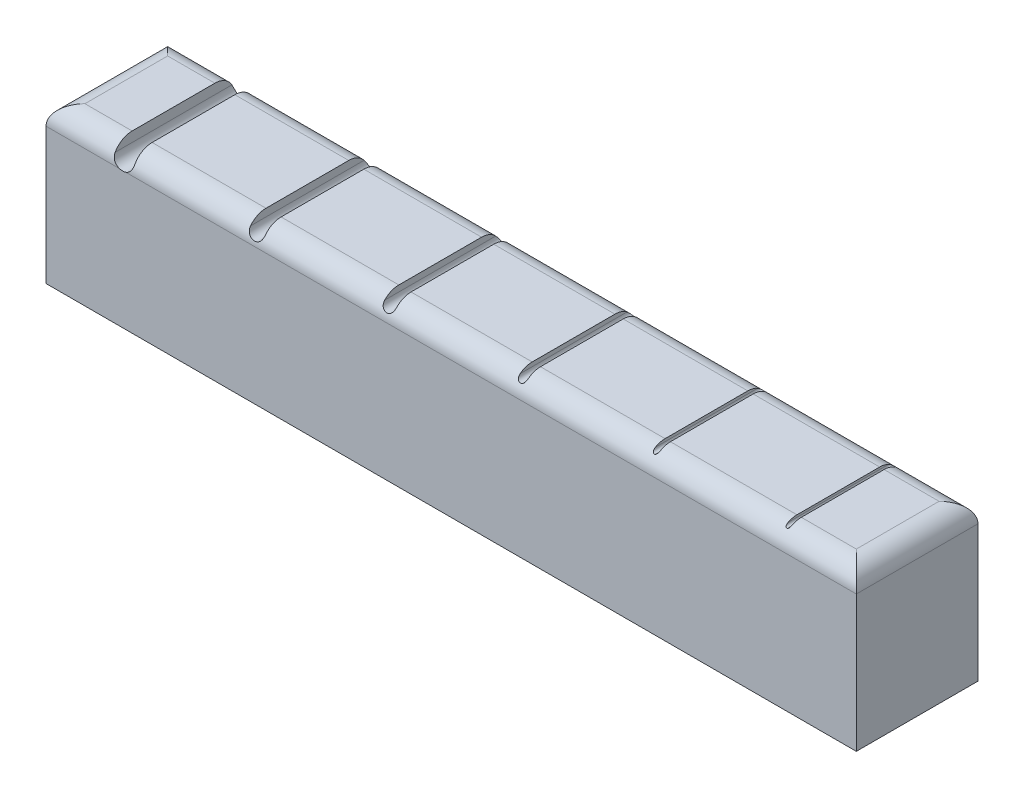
ISO-10303-21;
HEADER;
FILE_DESCRIPTION(('STEP AP214'),'2;1');
FILE_NAME('part.step','',(''),(''),'','','');
FILE_SCHEMA(('AUTOMOTIVE_DESIGN { 1 0 10303 214 1 1 1 1 }'));
ENDSEC;
DATA;
#1=APPLICATION_CONTEXT('core data for automotive mechanical design processes');
#2=APPLICATION_PROTOCOL_DEFINITION('international standard','automotive_design',2000,#1);
#3=PRODUCT_CONTEXT('',#1,'mechanical');
#4=PRODUCT('Part','Part','',(#3));
#5=PRODUCT_RELATED_PRODUCT_CATEGORY('part','',(#4));
#6=PRODUCT_DEFINITION_FORMATION('','',#4);
#7=PRODUCT_DEFINITION_CONTEXT('part definition',#1,'design');
#8=PRODUCT_DEFINITION('design','',#6,#7);
#9=PRODUCT_DEFINITION_SHAPE('','',#8);
#10=(LENGTH_UNIT() NAMED_UNIT(*) SI_UNIT(.MILLI.,.METRE.));
#11=(NAMED_UNIT(*) PLANE_ANGLE_UNIT() SI_UNIT($,.RADIAN.));
#12=(NAMED_UNIT(*) SI_UNIT($,.STERADIAN.) SOLID_ANGLE_UNIT());
#13=UNCERTAINTY_MEASURE_WITH_UNIT(LENGTH_MEASURE(1.E-05),#10,'distance_accuracy_value','');
#14=(GEOMETRIC_REPRESENTATION_CONTEXT(3) GLOBAL_UNCERTAINTY_ASSIGNED_CONTEXT((#13)) GLOBAL_UNIT_ASSIGNED_CONTEXT((#10,
#11,#12)) REPRESENTATION_CONTEXT('',''));
#15=CARTESIAN_POINT('',(0.,0.,0.));
#16=DIRECTION('',(0.,0.,1.));
#17=DIRECTION('',(1.,0.,0.));
#18=AXIS2_PLACEMENT_3D('',#15,#16,#17);
#19=CARTESIAN_POINT('',(-21.1455,8.128,3.175));
#20=DIRECTION('',(0.,-1.,0.));
#21=DIRECTION('',(0.,0.,-1.));
#22=AXIS2_PLACEMENT_3D('',#19,#20,#21);
#23=PLANE('',#22);
#24=DIRECTION('',(-1.,0.,0.));
#25=VECTOR('',#24,1.);
#26=CARTESIAN_POINT('',(-21.1455,8.128,2.159));
#27=LINE('',#26,#25);
#28=CARTESIAN_POINT('',(10.4267,8.128,2.159));
#29=VERTEX_POINT('',#28);
#30=CARTESIAN_POINT('',(17.0307,8.128,2.159));
#31=VERTEX_POINT('',#30);
#32=EDGE_CURVE('E273',#29,#31,#27,.F.);
#33=ORIENTED_EDGE('',*,*,#32,.T.);
#34=DIRECTION('',(0.,0.,1.));
#35=VECTOR('',#34,1.);
#36=CARTESIAN_POINT('',(17.0307,8.128,-3.175));
#37=LINE('',#36,#35);
#38=CARTESIAN_POINT('',(17.0307,8.128,-2.159));
#39=VERTEX_POINT('',#38);
#40=EDGE_CURVE('E266',#39,#31,#37,.T.);
#41=ORIENTED_EDGE('',*,*,#40,.F.);
#42=DIRECTION('',(-1.,0.,0.));
#43=VECTOR('',#42,1.);
#44=CARTESIAN_POINT('',(-21.1455,8.128,-2.159));
#45=LINE('',#44,#43);
#46=CARTESIAN_POINT('',(10.4267,8.128,-2.159));
#47=VERTEX_POINT('',#46);
#48=EDGE_CURVE('E62',#39,#47,#45,.T.);
#49=ORIENTED_EDGE('',*,*,#48,.T.);
#50=DIRECTION('',(0.,0.,1.));
#51=VECTOR('',#50,1.);
#52=CARTESIAN_POINT('',(10.4267,8.128,-3.175));
#53=LINE('',#52,#51);
#54=EDGE_CURVE('E561',#47,#29,#53,.T.);
#55=ORIENTED_EDGE('',*,*,#54,.T.);
#56=EDGE_LOOP('',(#33,#41,#49,#55));
#57=FACE_BOUND('',#56,.T.);
#58=ADVANCED_FACE('F39',(#57),#23,.F.);
#59=CARTESIAN_POINT('',(3.6449,8.128,2.159));
#60=VERTEX_POINT('',#59);
#61=CARTESIAN_POINT('',(10.1473,8.128,2.159));
#62=VERTEX_POINT('',#61);
#63=EDGE_CURVE('E278',#60,#62,#27,.F.);
#64=ORIENTED_EDGE('',*,*,#63,.T.);
#65=DIRECTION('',(0.,0.,1.));
#66=VECTOR('',#65,1.);
#67=CARTESIAN_POINT('',(10.1473,8.128,-3.175));
#68=LINE('',#67,#66);
#69=CARTESIAN_POINT('',(10.1473,8.128,-2.159));
#70=VERTEX_POINT('',#69);
#71=EDGE_CURVE('E313',#70,#62,#68,.T.);
#72=ORIENTED_EDGE('',*,*,#71,.F.);
#73=CARTESIAN_POINT('',(3.6449,8.128,-2.159));
#74=VERTEX_POINT('',#73);
#75=EDGE_CURVE('E593',#70,#74,#45,.T.);
#76=ORIENTED_EDGE('',*,*,#75,.T.);
#77=DIRECTION('',(0.,0.,1.));
#78=VECTOR('',#77,1.);
#79=CARTESIAN_POINT('',(3.6449,8.128,-3.175));
#80=LINE('',#79,#78);
#81=EDGE_CURVE('E316',#74,#60,#80,.T.);
#82=ORIENTED_EDGE('',*,*,#81,.T.);
#83=EDGE_LOOP('',(#64,#72,#76,#82));
#84=FACE_BOUND('',#83,.T.);
#85=ADVANCED_FACE('F312',(#84),#23,.F.);
#86=CARTESIAN_POINT('',(-3.1115,8.128,2.159));
#87=VERTEX_POINT('',#86);
#88=CARTESIAN_POINT('',(3.2131,8.128,2.159));
#89=VERTEX_POINT('',#88);
#90=EDGE_CURVE('E297',#87,#89,#27,.F.);
#91=ORIENTED_EDGE('',*,*,#90,.T.);
#92=DIRECTION('',(0.,0.,1.));
#93=VECTOR('',#92,1.);
#94=CARTESIAN_POINT('',(3.2131,8.128,-3.175));
#95=LINE('',#94,#93);
#96=CARTESIAN_POINT('',(3.2131,8.128,-2.159));
#97=VERTEX_POINT('',#96);
#98=EDGE_CURVE('E956',#97,#89,#95,.T.);
#99=ORIENTED_EDGE('',*,*,#98,.F.);
#100=CARTESIAN_POINT('',(-3.1115,8.128,-2.159));
#101=VERTEX_POINT('',#100);
#102=EDGE_CURVE('E595',#97,#101,#45,.T.);
#103=ORIENTED_EDGE('',*,*,#102,.T.);
#104=DIRECTION('',(0.,0.,1.));
#105=VECTOR('',#104,1.);
#106=CARTESIAN_POINT('',(-3.1115,8.128,-3.175));
#107=LINE('',#106,#105);
#108=EDGE_CURVE('E445',#101,#87,#107,.T.);
#109=ORIENTED_EDGE('',*,*,#108,.T.);
#110=EDGE_LOOP('',(#91,#99,#103,#109));
#111=FACE_BOUND('',#110,.T.);
#112=ADVANCED_FACE('F559',(#111),#23,.F.);
#113=CARTESIAN_POINT('',(-9.8933,8.128,2.159));
#114=VERTEX_POINT('',#113);
#115=CARTESIAN_POINT('',(-3.7465,8.128,2.159));
#116=VERTEX_POINT('',#115);
#117=EDGE_CURVE('E291',#114,#116,#27,.F.);
#118=ORIENTED_EDGE('',*,*,#117,.T.);
#119=DIRECTION('',(0.,0.,1.));
#120=VECTOR('',#119,1.);
#121=CARTESIAN_POINT('',(-3.7465,8.128,-3.175));
#122=LINE('',#121,#120);
#123=CARTESIAN_POINT('',(-3.7465,8.128,-2.159));
#124=VERTEX_POINT('',#123);
#125=EDGE_CURVE('E443',#124,#116,#122,.T.);
#126=ORIENTED_EDGE('',*,*,#125,.F.);
#127=CARTESIAN_POINT('',(-9.8933,8.128,-2.159));
#128=VERTEX_POINT('',#127);
#129=EDGE_CURVE('E597',#124,#128,#45,.T.);
#130=ORIENTED_EDGE('',*,*,#129,.T.);
#131=DIRECTION('',(0.,0.,1.));
#132=VECTOR('',#131,1.);
#133=CARTESIAN_POINT('',(-9.8933,8.128,-3.175));
#134=LINE('',#133,#132);
#135=EDGE_CURVE('E950',#128,#114,#134,.T.);
#136=ORIENTED_EDGE('',*,*,#135,.T.);
#137=EDGE_LOOP('',(#118,#126,#130,#136));
#138=FACE_BOUND('',#137,.T.);
#139=ADVANCED_FACE('F852',(#138),#23,.F.);
#140=CARTESIAN_POINT('',(-16.6243,8.128,2.159));
#141=VERTEX_POINT('',#140);
#142=CARTESIAN_POINT('',(-10.6807,8.128,2.159));
#143=VERTEX_POINT('',#142);
#144=EDGE_CURVE('E285',#141,#143,#27,.F.);
#145=ORIENTED_EDGE('',*,*,#144,.T.);
#146=DIRECTION('',(0.,0.,1.));
#147=VECTOR('',#146,1.);
#148=CARTESIAN_POINT('',(-10.6807,8.128,-3.175));
#149=LINE('',#148,#147);
#150=CARTESIAN_POINT('',(-10.6807,8.128,-2.159));
#151=VERTEX_POINT('',#150);
#152=EDGE_CURVE('E947',#151,#143,#149,.T.);
#153=ORIENTED_EDGE('',*,*,#152,.F.);
#154=CARTESIAN_POINT('',(-16.6243,8.128,-2.159));
#155=VERTEX_POINT('',#154);
#156=EDGE_CURVE('E938',#151,#155,#45,.T.);
#157=ORIENTED_EDGE('',*,*,#156,.T.);
#158=DIRECTION('',(0.,0.,1.));
#159=VECTOR('',#158,1.);
#160=CARTESIAN_POINT('',(-16.6243,8.128,-3.175));
#161=LINE('',#160,#159);
#162=EDGE_CURVE('E503',#155,#141,#161,.T.);
#163=ORIENTED_EDGE('',*,*,#162,.T.);
#164=EDGE_LOOP('',(#145,#153,#157,#163));
#165=FACE_BOUND('',#164,.T.);
#166=ADVANCED_FACE('F844',(#165),#23,.F.);
#167=CARTESIAN_POINT('',(-20.1295,8.128,2.159));
#168=VERTEX_POINT('',#167);
#169=CARTESIAN_POINT('',(-17.6657,8.128,2.159));
#170=VERTEX_POINT('',#169);
#171=EDGE_CURVE('E276',#168,#170,#27,.F.);
#172=ORIENTED_EDGE('',*,*,#171,.T.);
#173=DIRECTION('',(0.,0.,1.));
#174=VECTOR('',#173,1.);
#175=CARTESIAN_POINT('',(-17.6657,8.128,-3.175));
#176=LINE('',#175,#174);
#177=CARTESIAN_POINT('',(-17.6657,8.128,-2.159));
#178=VERTEX_POINT('',#177);
#179=EDGE_CURVE('E501',#178,#170,#176,.T.);
#180=ORIENTED_EDGE('',*,*,#179,.F.);
#181=CARTESIAN_POINT('',(-20.1295,8.128,-2.159));
#182=VERTEX_POINT('',#181);
#183=EDGE_CURVE('E289',#178,#182,#45,.T.);
#184=ORIENTED_EDGE('',*,*,#183,.T.);
#185=DIRECTION('',(0.,0.,-1.));
#186=VECTOR('',#185,1.);
#187=CARTESIAN_POINT('',(-20.1295,8.128,3.175));
#188=LINE('',#187,#186);
#189=EDGE_CURVE('E284',#182,#168,#188,.F.);
#190=ORIENTED_EDGE('',*,*,#189,.T.);
#191=EDGE_LOOP('',(#172,#180,#184,#190));
#192=FACE_BOUND('',#191,.T.);
#193=ADVANCED_FACE('F539',(#192),#23,.F.);
#194=CARTESIAN_POINT('',(0.,7.112,2.159));
#195=DIRECTION('',(-1.,0.,0.));
#196=DIRECTION('',(0.,0.,1.));
#197=AXIS2_PLACEMENT_3D('',#194,#195,#196);
#198=CYLINDRICAL_SURFACE('',#197,1.016);
#199=CARTESIAN_POINT('',(-17.6657,7.6073,3.0460929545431));
#200=CARTESIAN_POINT('',(-17.6657357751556,7.58239112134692,3.06004906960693));
#201=CARTESIAN_POINT('',(-17.6639119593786,7.5568115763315,3.0729059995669));
#202=CARTESIAN_POINT('',(-17.6562409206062,7.50514839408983,3.09626849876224));
#203=CARTESIAN_POINT('',(-17.6503878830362,7.479064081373,3.10677064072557));
#204=CARTESIAN_POINT('',(-17.6343222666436,7.42720866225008,3.12526383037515));
#205=CARTESIAN_POINT('',(-17.6240934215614,7.40143909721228,3.1332453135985));
#206=CARTESIAN_POINT('',(-17.5993429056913,7.35141358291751,3.14672788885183));
#207=CARTESIAN_POINT('',(-17.5848288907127,7.32715502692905,3.1522333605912));
#208=CARTESIAN_POINT('',(-17.5527102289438,7.28230565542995,3.16087199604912));
#209=CARTESIAN_POINT('',(-17.5353107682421,7.26158844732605,3.16411566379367));
#210=CARTESIAN_POINT('',(-17.4973763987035,7.22299118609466,3.16910696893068));
#211=CARTESIAN_POINT('',(-17.4768367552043,7.2051155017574,3.17085232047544));
#212=CARTESIAN_POINT('',(-17.4324116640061,7.17219950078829,3.17335573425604));
#213=CARTESIAN_POINT('',(-17.4084337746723,7.1572813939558,3.17407681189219));
#214=CARTESIAN_POINT('',(-17.3584206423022,7.13150879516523,3.17489001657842));
#215=CARTESIAN_POINT('',(-17.3323885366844,7.12064824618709,3.17498308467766));
#216=CARTESIAN_POINT('',(-17.3056437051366,7.112,3.175));
#217=B_SPLINE_CURVE_WITH_KNOTS('',3,(#199,#200,#201,#202,#203,#204,#205,#206,#207,#208,#209,
#210,#211,#212,#213,#214,#215,#216),.UNSPECIFIED.,.F.,.F.,(4,2,2,2,2,2,2,2,4),(0.,
0.0856425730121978,0.171408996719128,0.257497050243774,0.343432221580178,0.42480145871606,
0.506294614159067,0.590661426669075,0.674901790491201),.UNSPECIFIED.);
#218=CARTESIAN_POINT('',(-17.6657,7.6073,3.0460929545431));
#219=VERTEX_POINT('',#218);
#220=CARTESIAN_POINT('',(-17.3056437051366,7.112,3.175));
#221=VERTEX_POINT('',#220);
#222=EDGE_CURVE('E510',#219,#221,#217,.T.);
#223=ORIENTED_EDGE('',*,*,#222,.F.);
#224=CARTESIAN_POINT('',(-17.6657,7.112,2.159));
#225=DIRECTION('',(-1.,0.,0.));
#226=DIRECTION('',(0.,0.,1.));
#227=AXIS2_PLACEMENT_3D('',#224,#225,#226);
#228=CIRCLE('',#227,1.016);
#229=EDGE_CURVE('E508',#170,#219,#228,.F.);
#230=ORIENTED_EDGE('',*,*,#229,.F.);
#231=ORIENTED_EDGE('',*,*,#171,.F.);
#232=CARTESIAN_POINT('',(-20.1295,7.112,2.159));
#233=DIRECTION('',(-0.707106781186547,0.,-0.707106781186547));
#234=DIRECTION('',(-0.707106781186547,0.,0.707106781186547));
#235=AXIS2_PLACEMENT_3D('',#232,#233,#234);
#236=ELLIPSE('',#235,1.43684097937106,1.016);
#237=CARTESIAN_POINT('',(-21.1455,7.112,3.175));
#238=VERTEX_POINT('',#237);
#239=EDGE_CURVE('E621',#168,#238,#236,.F.);
#240=ORIENTED_EDGE('',*,*,#239,.T.);
#241=DIRECTION('',(-1.,0.,0.));
#242=VECTOR('',#241,1.);
#243=CARTESIAN_POINT('',(0.,7.112,3.175));
#244=LINE('',#243,#242);
#245=EDGE_CURVE('E610',#221,#238,#244,.T.);
#246=ORIENTED_EDGE('',*,*,#245,.F.);
#247=EDGE_LOOP('',(#223,#230,#231,#240,#246));
#248=FACE_BOUND('',#247,.T.);
#249=ADVANCED_FACE('F552',(#248),#198,.T.);
#250=CARTESIAN_POINT('',(-21.1455,7.112,-2.159));
#251=DIRECTION('',(1.,0.,0.));
#252=DIRECTION('',(0.,0.,-1.));
#253=AXIS2_PLACEMENT_3D('',#250,#251,#252);
#254=CYLINDRICAL_SURFACE('',#253,1.016);
#255=CARTESIAN_POINT('',(-17.3056437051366,7.112,-3.175));
#256=CARTESIAN_POINT('',(-17.3329426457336,7.12082613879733,-3.17498182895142));
#257=CARTESIAN_POINT('',(-17.3594972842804,7.13195801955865,-3.17488550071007));
#258=CARTESIAN_POINT('',(-17.4104660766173,7.15844010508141,-3.17402939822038));
#259=CARTESIAN_POINT('',(-17.4348759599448,7.17379848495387,-3.17326833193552));
#260=CARTESIAN_POINT('',(-17.4808246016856,7.20832762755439,-3.17056979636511));
#261=CARTESIAN_POINT('',(-17.5023591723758,7.22750385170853,-3.16863063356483));
#262=CARTESIAN_POINT('',(-17.5418394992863,7.26897475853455,-3.1630176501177));
#263=CARTESIAN_POINT('',(-17.5597919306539,7.29126350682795,-3.15934709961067));
#264=CARTESIAN_POINT('',(-17.5911303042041,7.33739478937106,-3.14995306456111));
#265=CARTESIAN_POINT('',(-17.6046442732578,7.36116453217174,-3.14429922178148));
#266=CARTESIAN_POINT('',(-17.6276293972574,7.41000081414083,-3.13064586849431));
#267=CARTESIAN_POINT('',(-17.637094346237,7.43506927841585,-3.12264278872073));
#268=CARTESIAN_POINT('',(-17.6517942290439,7.48502120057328,-3.10440998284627));
#269=CARTESIAN_POINT('',(-17.6571072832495,7.50989888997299,-3.09422621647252));
#270=CARTESIAN_POINT('',(-17.6640713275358,7.55915177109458,-3.07172219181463));
#271=CARTESIAN_POINT('',(-17.6657284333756,7.58352773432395,-3.05940553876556));
#272=CARTESIAN_POINT('',(-17.6657,7.6073,-3.0460929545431));
#273=B_SPLINE_CURVE_WITH_KNOTS('',3,(#255,#256,#257,#258,#259,#260,#261,#262,#263,#264,#265,
#266,#267,#268,#269,#270,#271,#272),.UNSPECIFIED.,.F.,.F.,(4,2,2,2,2,2,2,2,4),(0.,
0.0859778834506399,0.172123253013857,0.25839275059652,0.344499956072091,0.427844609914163,
0.511316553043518,0.593177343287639,0.674901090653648),.UNSPECIFIED.);
#274=CARTESIAN_POINT('',(-17.3056437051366,7.112,-3.175));
#275=VERTEX_POINT('',#274);
#276=CARTESIAN_POINT('',(-17.6657,7.6073,-3.0460929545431));
#277=VERTEX_POINT('',#276);
#278=EDGE_CURVE('E389',#275,#277,#273,.T.);
#279=ORIENTED_EDGE('',*,*,#278,.F.);
#280=DIRECTION('',(-1.,0.,0.));
#281=VECTOR('',#280,1.);
#282=CARTESIAN_POINT('',(21.1455,7.112,-3.175));
#283=LINE('',#282,#281);
#284=CARTESIAN_POINT('',(-21.1455,7.112,-3.175));
#285=VERTEX_POINT('',#284);
#286=EDGE_CURVE('E605',#285,#275,#283,.F.);
#287=ORIENTED_EDGE('',*,*,#286,.F.);
#288=CARTESIAN_POINT('',(-20.1295,7.112,-2.159));
#289=DIRECTION('',(0.707106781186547,0.,-0.707106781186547));
#290=DIRECTION('',(-0.707106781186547,0.,-0.707106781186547));
#291=AXIS2_PLACEMENT_3D('',#288,#289,#290);
#292=ELLIPSE('',#291,1.43684097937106,1.016);
#293=EDGE_CURVE('E618',#285,#182,#292,.T.);
#294=ORIENTED_EDGE('',*,*,#293,.T.);
#295=ORIENTED_EDGE('',*,*,#183,.F.);
#296=CARTESIAN_POINT('',(-17.6657,7.112,-2.159));
#297=DIRECTION('',(-1.,0.,0.));
#298=DIRECTION('',(0.,0.,1.));
#299=AXIS2_PLACEMENT_3D('',#296,#297,#298);
#300=CIRCLE('',#299,1.016);
#301=EDGE_CURVE('E628',#277,#178,#300,.F.);
#302=ORIENTED_EDGE('',*,*,#301,.F.);
#303=EDGE_LOOP('',(#279,#287,#294,#295,#302));
#304=FACE_BOUND('',#303,.T.);
#305=ADVANCED_FACE('F374',(#304),#254,.T.);
#306=CARTESIAN_POINT('',(-21.1455,0.,3.175));
#307=DIRECTION('',(1.,0.,0.));
#308=DIRECTION('',(0.,0.,-1.));
#309=AXIS2_PLACEMENT_3D('',#306,#307,#308);
#310=PLANE('',#309);
#311=DIRECTION('',(0.,-1.,0.));
#312=VECTOR('',#311,1.);
#313=CARTESIAN_POINT('',(-21.1455,0.,3.175));
#314=LINE('',#313,#312);
#315=CARTESIAN_POINT('',(-21.1455,0.,3.175));
#316=VERTEX_POINT('',#315);
#317=EDGE_CURVE('E926',#238,#316,#314,.T.);
#318=ORIENTED_EDGE('',*,*,#317,.F.);
#319=DIRECTION('',(0.,0.,-1.));
#320=VECTOR('',#319,1.);
#321=CARTESIAN_POINT('',(-21.1455,7.112,3.175));
#322=LINE('',#321,#320);
#323=EDGE_CURVE('E608',#238,#285,#322,.T.);
#324=ORIENTED_EDGE('',*,*,#323,.T.);
#325=DIRECTION('',(0.,-1.,0.));
#326=VECTOR('',#325,1.);
#327=CARTESIAN_POINT('',(-21.1455,0.,-3.175));
#328=LINE('',#327,#326);
#329=CARTESIAN_POINT('',(-21.1455,0.,-3.175));
#330=VERTEX_POINT('',#329);
#331=EDGE_CURVE('E623',#285,#330,#328,.T.);
#332=ORIENTED_EDGE('',*,*,#331,.T.);
#333=DIRECTION('',(0.,0.,-1.));
#334=VECTOR('',#333,1.);
#335=CARTESIAN_POINT('',(-21.1455,0.,3.175));
#336=LINE('',#335,#334);
#337=EDGE_CURVE('E274',#316,#330,#336,.T.);
#338=ORIENTED_EDGE('',*,*,#337,.F.);
#339=EDGE_LOOP('',(#318,#324,#332,#338));
#340=FACE_BOUND('',#339,.T.);
#341=ADVANCED_FACE('F545',(#340),#310,.F.);
#342=CARTESIAN_POINT('',(-21.1455,0.,3.175));
#343=DIRECTION('',(0.,1.,0.));
#344=DIRECTION('',(0.,0.,1.));
#345=AXIS2_PLACEMENT_3D('',#342,#343,#344);
#346=PLANE('',#345);
#347=DIRECTION('',(1.,0.,0.));
#348=VECTOR('',#347,1.);
#349=CARTESIAN_POINT('',(-21.1455,0.,-3.175));
#350=LINE('',#349,#348);
#351=CARTESIAN_POINT('',(21.1455,0.,-3.175));
#352=VERTEX_POINT('',#351);
#353=EDGE_CURVE('E915',#330,#352,#350,.T.);
#354=ORIENTED_EDGE('',*,*,#353,.T.);
#355=DIRECTION('',(0.,0.,-1.));
#356=VECTOR('',#355,1.);
#357=CARTESIAN_POINT('',(21.1455,0.,3.175));
#358=LINE('',#357,#356);
#359=CARTESIAN_POINT('',(21.1455,0.,3.175));
#360=VERTEX_POINT('',#359);
#361=EDGE_CURVE('E280',#360,#352,#358,.T.);
#362=ORIENTED_EDGE('',*,*,#361,.F.);
#363=DIRECTION('',(1.,0.,0.));
#364=VECTOR('',#363,1.);
#365=CARTESIAN_POINT('',(-21.1455,0.,3.175));
#366=LINE('',#365,#364);
#367=EDGE_CURVE('E931',#316,#360,#366,.T.);
#368=ORIENTED_EDGE('',*,*,#367,.F.);
#369=ORIENTED_EDGE('',*,*,#337,.T.);
#370=EDGE_LOOP('',(#354,#362,#368,#369));
#371=FACE_BOUND('',#370,.T.);
#372=ADVANCED_FACE('F542',(#371),#346,.F.);
#373=CARTESIAN_POINT('',(21.1455,8.128,3.175));
#374=DIRECTION('',(-1.,0.,0.));
#375=DIRECTION('',(0.,0.,1.));
#376=AXIS2_PLACEMENT_3D('',#373,#374,#375);
#377=PLANE('',#376);
#378=DIRECTION('',(0.,1.,0.));
#379=VECTOR('',#378,1.);
#380=CARTESIAN_POINT('',(21.1455,8.128,-3.175));
#381=LINE('',#380,#379);
#382=CARTESIAN_POINT('',(21.1455,7.112,-3.175));
#383=VERTEX_POINT('',#382);
#384=EDGE_CURVE('E918',#352,#383,#381,.T.);
#385=ORIENTED_EDGE('',*,*,#384,.T.);
#386=DIRECTION('',(0.,0.,-1.));
#387=VECTOR('',#386,1.);
#388=CARTESIAN_POINT('',(21.1455,7.112,3.175));
#389=LINE('',#388,#387);
#390=CARTESIAN_POINT('',(21.1455,7.112,3.175));
#391=VERTEX_POINT('',#390);
#392=EDGE_CURVE('E601',#383,#391,#389,.F.);
#393=ORIENTED_EDGE('',*,*,#392,.T.);
#394=DIRECTION('',(0.,1.,0.));
#395=VECTOR('',#394,1.);
#396=CARTESIAN_POINT('',(21.1455,8.128,3.175));
#397=LINE('',#396,#395);
#398=EDGE_CURVE('E921',#360,#391,#397,.T.);
#399=ORIENTED_EDGE('',*,*,#398,.F.);
#400=ORIENTED_EDGE('',*,*,#361,.T.);
#401=EDGE_LOOP('',(#385,#393,#399,#400));
#402=FACE_BOUND('',#401,.T.);
#403=ADVANCED_FACE('F538',(#402),#377,.F.);
#404=CARTESIAN_POINT('',(20.1295,8.128,-2.159));
#405=VERTEX_POINT('',#404);
#406=CARTESIAN_POINT('',(17.2593,8.128,-2.159));
#407=VERTEX_POINT('',#406);
#408=EDGE_CURVE('E265',#405,#407,#45,.T.);
#409=ORIENTED_EDGE('',*,*,#408,.T.);
#410=DIRECTION('',(0.,0.,1.));
#411=VECTOR('',#410,1.);
#412=CARTESIAN_POINT('',(17.2593,8.128,-3.175));
#413=LINE('',#412,#411);
#414=CARTESIAN_POINT('',(17.2593,8.128,2.159));
#415=VERTEX_POINT('',#414);
#416=EDGE_CURVE('E54',#407,#415,#413,.T.);
#417=ORIENTED_EDGE('',*,*,#416,.T.);
#418=CARTESIAN_POINT('',(20.1295,8.128,2.159));
#419=VERTEX_POINT('',#418);
#420=EDGE_CURVE('E262',#415,#419,#27,.F.);
#421=ORIENTED_EDGE('',*,*,#420,.T.);
#422=DIRECTION('',(0.,0.,-1.));
#423=VECTOR('',#422,1.);
#424=CARTESIAN_POINT('',(20.1295,8.128,3.175));
#425=LINE('',#424,#423);
#426=EDGE_CURVE('E599',#419,#405,#425,.T.);
#427=ORIENTED_EDGE('',*,*,#426,.T.);
#428=EDGE_LOOP('',(#409,#417,#421,#427));
#429=FACE_BOUND('',#428,.T.);
#430=ADVANCED_FACE('F260',(#429),#23,.F.);
#431=CARTESIAN_POINT('',(0.,0.,3.175));
#432=DIRECTION('',(0.,0.,-1.));
#433=DIRECTION('',(-1.,0.,0.));
#434=AXIS2_PLACEMENT_3D('',#431,#432,#433);
#435=PLANE('',#434);
#436=CARTESIAN_POINT('',(-16.9843562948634,7.112,3.175));
#437=VERTEX_POINT('',#436);
#438=EDGE_CURVE('E611',#391,#437,#244,.T.);
#439=ORIENTED_EDGE('',*,*,#438,.T.);
#440=CARTESIAN_POINT('',(-17.145,7.6073,3.175));
#441=DIRECTION('',(0.,0.,1.));
#442=DIRECTION('',(1.,0.,0.));
#443=AXIS2_PLACEMENT_3D('',#440,#441,#442);
#444=CIRCLE('',#443,0.520699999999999);
#445=EDGE_CURVE('E489',#221,#437,#444,.T.);
#446=ORIENTED_EDGE('',*,*,#445,.F.);
#447=ORIENTED_EDGE('',*,*,#245,.T.);
#448=ORIENTED_EDGE('',*,*,#317,.T.);
#449=ORIENTED_EDGE('',*,*,#367,.T.);
#450=ORIENTED_EDGE('',*,*,#398,.T.);
#451=EDGE_LOOP('',(#439,#446,#447,#448,#449,#450));
#452=FACE_BOUND('',#451,.T.);
#453=ADVANCED_FACE('F525',(#452),#435,.F.);
#454=CARTESIAN_POINT('',(0.,0.,-3.175));
#455=DIRECTION('',(0.,0.,-1.));
#456=DIRECTION('',(-1.,0.,0.));
#457=AXIS2_PLACEMENT_3D('',#454,#455,#456);
#458=PLANE('',#457);
#459=CARTESIAN_POINT('',(-17.145,7.6073,-3.175));
#460=DIRECTION('',(0.,0.,1.));
#461=DIRECTION('',(1.,0.,0.));
#462=AXIS2_PLACEMENT_3D('',#459,#460,#461);
#463=CIRCLE('',#462,0.520699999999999);
#464=CARTESIAN_POINT('',(-16.9843562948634,7.112,-3.175));
#465=VERTEX_POINT('',#464);
#466=EDGE_CURVE('E493',#275,#465,#463,.T.);
#467=ORIENTED_EDGE('',*,*,#466,.T.);
#468=EDGE_CURVE('E604',#465,#383,#283,.F.);
#469=ORIENTED_EDGE('',*,*,#468,.T.);
#470=ORIENTED_EDGE('',*,*,#384,.F.);
#471=ORIENTED_EDGE('',*,*,#353,.F.);
#472=ORIENTED_EDGE('',*,*,#331,.F.);
#473=ORIENTED_EDGE('',*,*,#286,.T.);
#474=EDGE_LOOP('',(#467,#469,#470,#471,#472,#473));
#475=FACE_BOUND('',#474,.T.);
#476=ADVANCED_FACE('F531',(#475),#458,.T.);
#477=CARTESIAN_POINT('',(-20.1295,7.112,3.175));
#478=DIRECTION('',(0.,0.,-1.));
#479=DIRECTION('',(-1.,0.,0.));
#480=AXIS2_PLACEMENT_3D('',#477,#478,#479);
#481=CYLINDRICAL_SURFACE('',#480,1.016);
#482=ORIENTED_EDGE('',*,*,#293,.F.);
#483=ORIENTED_EDGE('',*,*,#323,.F.);
#484=ORIENTED_EDGE('',*,*,#239,.F.);
#485=ORIENTED_EDGE('',*,*,#189,.F.);
#486=EDGE_LOOP('',(#482,#483,#484,#485));
#487=FACE_BOUND('',#486,.T.);
#488=ADVANCED_FACE('F41',(#487),#481,.T.);
#489=CARTESIAN_POINT('',(17.0307,7.112,2.159));
#490=DIRECTION('',(-1.,0.,0.));
#491=DIRECTION('',(0.,-1.,0.));
#492=AXIS2_PLACEMENT_3D('',#489,#490,#491);
#493=CIRCLE('',#492,1.016);
#494=CARTESIAN_POINT('',(17.0307,8.0137,2.62718063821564));
#495=VERTEX_POINT('',#494);
#496=EDGE_CURVE('E255',#31,#495,#493,.F.);
#497=ORIENTED_EDGE('',*,*,#496,.F.);
#498=ORIENTED_EDGE('',*,*,#32,.F.);
#499=CARTESIAN_POINT('',(10.4267,7.112,2.159));
#500=DIRECTION('',(1.,0.,0.));
#501=DIRECTION('',(0.,0.,-1.));
#502=AXIS2_PLACEMENT_3D('',#499,#500,#501);
#503=CIRCLE('',#502,1.016);
#504=CARTESIAN_POINT('',(10.4267,7.9883,2.67315397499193));
#505=VERTEX_POINT('',#504);
#506=EDGE_CURVE('E328',#505,#29,#503,.F.);
#507=ORIENTED_EDGE('',*,*,#506,.F.);
#508=CARTESIAN_POINT('',(10.287,8.128,2.159));
#509=CARTESIAN_POINT('',(10.2869995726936,8.12800000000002,2.15900000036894));
#510=CARTESIAN_POINT('',(10.2869991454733,8.12799999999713,2.15900010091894));
#511=CARTESIAN_POINT('',(10.2869983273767,8.12799999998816,2.15900041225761));
#512=CARTESIAN_POINT('',(10.2869979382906,8.12799999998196,2.1590006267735));
#513=CARTESIAN_POINT('',(10.2869971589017,8.1279999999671,2.15900114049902));
#514=CARTESIAN_POINT('',(10.2869967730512,8.12799999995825,2.1590014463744));
#515=CARTESIAN_POINT('',(10.2869960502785,8.12799999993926,2.15900210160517));
#516=CARTESIAN_POINT('',(10.2869957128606,8.12799999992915,2.15900245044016));
#517=CARTESIAN_POINT('',(10.2869945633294,8.12799999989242,2.1590037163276));
#518=CARTESIAN_POINT('',(10.2869938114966,8.12799999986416,2.15900468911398));
#519=CARTESIAN_POINT('',(10.2869924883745,8.12799999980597,2.15900668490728));
#520=CARTESIAN_POINT('',(10.2869919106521,8.12799999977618,2.1590077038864));
#521=CARTESIAN_POINT('',(10.2869896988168,8.12799999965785,2.1590117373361));
#522=CARTESIAN_POINT('',(10.2869881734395,8.12799999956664,2.15901481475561));
#523=CARTESIAN_POINT('',(10.2869857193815,8.12799999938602,2.15902083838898));
#524=CARTESIAN_POINT('',(10.2869847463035,8.12799999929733,2.15902376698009));
#525=CARTESIAN_POINT('',(10.2869805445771,8.12799999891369,2.15903639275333));
#526=CARTESIAN_POINT('',(10.2869773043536,8.12799999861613,2.15904607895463));
#527=CARTESIAN_POINT('',(10.2869721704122,8.12799999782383,2.15906411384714));
#528=CARTESIAN_POINT('',(10.286970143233,8.12799999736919,2.15907242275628));
#529=CARTESIAN_POINT('',(10.2869539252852,8.12799999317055,2.159133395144));
#530=CARTESIAN_POINT('',(10.2869330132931,8.12799998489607,2.15918398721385));
#531=CARTESIAN_POINT('',(10.2868544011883,8.1279999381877,2.15938134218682));
#532=CARTESIAN_POINT('',(10.2868016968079,8.12799987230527,2.15952954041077));
#533=CARTESIAN_POINT('',(10.286593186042,8.12799948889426,2.16010734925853));
#534=CARTESIAN_POINT('',(10.2864321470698,8.12799893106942,2.16053549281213));
#535=CARTESIAN_POINT('',(10.285771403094,8.12799551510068,2.162300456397));
#536=CARTESIAN_POINT('',(10.2852776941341,8.12799028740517,2.16363890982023));
#537=CARTESIAN_POINT('',(10.2803240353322,8.12791137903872,2.17705775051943));
#538=CARTESIAN_POINT('',(10.2758355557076,8.12762505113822,2.18913029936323));
#539=CARTESIAN_POINT('',(10.2670731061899,8.12663968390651,2.21282987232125));
#540=CARTESIAN_POINT('',(10.2627973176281,8.12595620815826,2.22445695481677));
#541=CARTESIAN_POINT('',(10.2537994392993,8.12408385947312,2.24906645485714));
#542=CARTESIAN_POINT('',(10.2490839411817,8.12284503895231,2.26204759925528));
#543=CARTESIAN_POINT('',(10.2397170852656,8.11984798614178,2.28812149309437));
#544=CARTESIAN_POINT('',(10.235066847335,8.11808466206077,2.3012140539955));
#545=CARTESIAN_POINT('',(10.2237223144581,8.11306707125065,2.33365550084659));
#546=CARTESIAN_POINT('',(10.2171187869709,8.10950346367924,2.35298959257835));
#547=CARTESIAN_POINT('',(10.2045455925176,8.10131491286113,2.39112886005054));
#548=CARTESIAN_POINT('',(10.1985648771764,8.09671612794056,2.40993601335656));
#549=CARTESIAN_POINT('',(10.1876641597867,8.08678182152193,2.4460175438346));
#550=CARTESIAN_POINT('',(10.1826981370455,8.0815283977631,2.4633002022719));
#551=CARTESIAN_POINT('',(10.1734477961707,8.07001149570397,2.49782807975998));
#552=CARTESIAN_POINT('',(10.1691679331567,8.06374190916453,2.51507238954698));
#553=CARTESIAN_POINT('',(10.1572867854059,8.04270888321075,2.56830881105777));
#554=CARTESIAN_POINT('',(10.1512147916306,8.02619207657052,2.6040445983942));
#555=CARTESIAN_POINT('',(10.1475262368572,7.99956235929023,2.65374857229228));
#556=CARTESIAN_POINT('',(10.147058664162,7.99120012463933,2.66846084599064));
#557=CARTESIAN_POINT('',(10.1477811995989,7.97382497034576,2.69732522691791));
#558=CARTESIAN_POINT('',(10.1489587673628,7.96481746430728,2.71148073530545));
#559=CARTESIAN_POINT('',(10.1534696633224,7.94610696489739,2.73935202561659));
#560=CARTESIAN_POINT('',(10.1568401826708,7.93639459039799,2.75305585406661));
#561=CARTESIAN_POINT('',(10.1664833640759,7.91681303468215,2.77931910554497));
#562=CARTESIAN_POINT('',(10.1727458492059,7.90694451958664,2.79188235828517));
#563=CARTESIAN_POINT('',(10.1846970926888,7.89298715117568,2.80889700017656));
#564=CARTESIAN_POINT('',(10.188937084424,7.88860229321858,2.81412405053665));
#565=CARTESIAN_POINT('',(10.1983349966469,7.88015871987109,2.82400375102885));
#566=CARTESIAN_POINT('',(10.203493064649,7.87610005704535,2.82865630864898));
#567=CARTESIAN_POINT('',(10.2148440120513,7.86847963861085,2.83725370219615));
#568=CARTESIAN_POINT('',(10.221049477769,7.86492503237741,2.84118854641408));
#569=CARTESIAN_POINT('',(10.2343938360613,7.85867561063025,2.8480232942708));
#570=CARTESIAN_POINT('',(10.2415301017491,7.85597844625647,2.8509260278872));
#571=CARTESIAN_POINT('',(10.2541804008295,7.85240359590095,2.85474643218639));
#572=CARTESIAN_POINT('',(10.2595081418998,7.85122089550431,2.8560007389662));
#573=CARTESIAN_POINT('',(10.2703782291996,7.84948356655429,2.85783876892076));
#574=CARTESIAN_POINT('',(10.2759204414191,7.84892855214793,2.85842290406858));
#575=CARTESIAN_POINT('',(10.2870714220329,7.84848838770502,2.85888639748));
#576=CARTESIAN_POINT('',(10.2926802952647,7.84860448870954,2.85876443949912));
#577=CARTESIAN_POINT('',(10.3037845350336,7.84950010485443,2.85782043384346));
#578=CARTESIAN_POINT('',(10.3092798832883,7.85027972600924,2.85699827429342));
#579=CARTESIAN_POINT('',(10.3198908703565,7.85242146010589,2.85472580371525));
#580=CARTESIAN_POINT('',(10.3250121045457,7.85377080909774,2.8532892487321));
#581=CARTESIAN_POINT('',(10.334899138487,7.85696528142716,2.84986048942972));
#582=CARTESIAN_POINT('',(10.3396647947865,7.85881060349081,2.84786806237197));
#583=CARTESIAN_POINT('',(10.3505449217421,7.86369614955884,2.84253960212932));
#584=CARTESIAN_POINT('',(10.3564675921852,7.86692242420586,2.83898200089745));
#585=CARTESIAN_POINT('',(10.3674568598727,7.87390857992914,2.83114510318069));
#586=CARTESIAN_POINT('',(10.3725218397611,7.87766944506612,2.82686447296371));
#587=CARTESIAN_POINT('',(10.3837679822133,7.88717287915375,2.81583735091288));
#588=CARTESIAN_POINT('',(10.3895274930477,7.89308547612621,2.80880921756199));
#589=CARTESIAN_POINT('',(10.3995640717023,7.90518903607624,2.79398016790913));
#590=CARTESIAN_POINT('',(10.4038375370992,7.91138063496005,2.7861774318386));
#591=CARTESIAN_POINT('',(10.4132798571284,7.92746326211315,2.76524790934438));
#592=CARTESIAN_POINT('',(10.4174812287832,7.9373745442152,2.75170372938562));
#593=CARTESIAN_POINT('',(10.4234512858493,7.95669428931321,2.72383421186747));
#594=CARTESIAN_POINT('',(10.4252225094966,7.9661032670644,2.70950970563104));
#595=CARTESIAN_POINT('',(10.4275528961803,7.99069763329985,2.66989149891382));
#596=CARTESIAN_POINT('',(10.4263400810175,8.00520333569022,2.64407751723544));
#597=CARTESIAN_POINT('',(10.420405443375,8.03201259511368,2.59113162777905));
#598=CARTESIAN_POINT('',(10.4156106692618,8.0442636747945,2.56398344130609));
#599=CARTESIAN_POINT('',(10.4043093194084,8.064962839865,2.51227515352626));
#600=CARTESIAN_POINT('',(10.3980550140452,8.0736833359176,2.48776623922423));
#601=CARTESIAN_POINT('',(10.3842149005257,8.08916382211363,2.43842427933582));
#602=CARTESIAN_POINT('',(10.3766249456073,8.0959175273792,2.41359045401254));
#603=CARTESIAN_POINT('',(10.3612702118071,8.10696444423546,2.3659887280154));
#604=CARTESIAN_POINT('',(10.3535813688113,8.11142335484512,2.34323406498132));
#605=CARTESIAN_POINT('',(10.3377963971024,8.11872511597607,2.29786400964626));
#606=CARTESIAN_POINT('',(10.329705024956,8.12158344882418,2.27524945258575));
#607=CARTESIAN_POINT('',(10.3169259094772,8.12483782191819,2.24008036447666));
#608=CARTESIAN_POINT('',(10.3123301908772,8.12576346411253,2.22753889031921));
#609=CARTESIAN_POINT('',(10.3045031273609,8.12693733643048,2.20627026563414));
#610=CARTESIAN_POINT('',(10.3012828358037,8.12730604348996,2.1975455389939));
#611=CARTESIAN_POINT('',(10.2951064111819,8.12779562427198,2.18087474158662));
#612=CARTESIAN_POINT('',(10.2921523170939,8.12793565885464,2.17292858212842));
#613=CARTESIAN_POINT('',(10.2887250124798,8.12799024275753,2.16364654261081));
#614=CARTESIAN_POINT('',(10.2882341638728,8.12799545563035,2.16231567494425));
#615=CARTESIAN_POINT('',(10.2875741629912,8.1279989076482,2.16055252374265));
#616=CARTESIAN_POINT('',(10.2874109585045,8.12799947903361,2.16011862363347));
#617=CARTESIAN_POINT('',(10.2871998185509,8.12799987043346,2.15953352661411));
#618=CARTESIAN_POINT('',(10.2871465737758,8.12799993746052,2.1593838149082));
#619=CARTESIAN_POINT('',(10.2870672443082,8.12799998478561,2.15918468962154));
#620=CARTESIAN_POINT('',(10.2870462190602,8.12799999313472,2.15913382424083));
#621=CARTESIAN_POINT('',(10.2870299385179,8.12799999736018,2.15907254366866));
#622=CARTESIAN_POINT('',(10.2870279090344,8.12799999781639,2.15906421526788));
#623=CARTESIAN_POINT('',(10.2870227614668,8.12799999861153,2.1590461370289));
#624=CARTESIAN_POINT('',(10.2870195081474,8.1279999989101,2.15903642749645));
#625=CARTESIAN_POINT('',(10.2870152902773,8.12799999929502,2.159023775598));
#626=CARTESIAN_POINT('',(10.2870143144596,8.12799999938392,2.15902084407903));
#627=CARTESIAN_POINT('',(10.2870118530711,8.12799999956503,2.15901481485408));
#628=CARTESIAN_POINT('',(10.2870103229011,8.12799999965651,2.15901173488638));
#629=CARTESIAN_POINT('',(10.2870081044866,8.12799999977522,2.15900769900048));
#630=CARTESIAN_POINT('',(10.2870075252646,8.1279999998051,2.15900667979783));
#631=CARTESIAN_POINT('',(10.2870061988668,8.12799999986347,2.15900468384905));
#632=CARTESIAN_POINT('',(10.2870054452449,8.12799999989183,2.15900371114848));
#633=CARTESIAN_POINT('',(10.2870042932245,8.1279999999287,2.15900244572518));
#634=CARTESIAN_POINT('',(10.2870039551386,8.12799999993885,2.15900209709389));
#635=CARTESIAN_POINT('',(10.2870032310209,8.12799999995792,2.15900144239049));
#636=CARTESIAN_POINT('',(10.2870028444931,8.12799999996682,2.15900113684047));
#637=CARTESIAN_POINT('',(10.2870020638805,8.12799999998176,2.15900062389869));
#638=CARTESIAN_POINT('',(10.2870016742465,8.127999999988,2.15900040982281));
#639=CARTESIAN_POINT('',(10.2870008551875,8.12799999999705,2.15900009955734));
#640=CARTESIAN_POINT('',(10.2870004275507,8.12799999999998,2.15899999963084));
#641=CARTESIAN_POINT('',(10.287,8.128,2.159));
#642=B_SPLINE_CURVE_WITH_KNOTS('',3,(#508,#509,#510,#511,#512,#513,#514,#515,#516,#517,#518,
#519,#520,#521,#522,#523,#524,#525,#526,#527,#528,#529,#530,#531,#532,#533,#534,#535,#536,#537,
#538,#539,#540,#541,#542,#543,#544,#545,#546,#547,#548,#549,#550,#551,#552,#553,#554,#555,#556,
#557,#558,#559,#560,#561,#562,#563,#564,#565,#566,#567,#568,#569,#570,#571,#572,#573,#574,#575,
#576,#577,#578,#579,#580,#581,#582,#583,#584,#585,#586,#587,#588,#589,#590,#591,#592,#593,#594,
#595,#596,#597,#598,#599,#600,#601,#602,#603,#604,#605,#606,#607,#608,#609,#610,#611,#612,#613,
#614,#615,#616,#617,#618,#619,#620,#621,#622,#623,#624,#625,#626,#627,#628,#629,#630,#631,#632,
#633,#634,#635,#636,#637,#638,#639,#640,#641),.UNSPECIFIED.,.T.,.F.,(4,2,2,2,2,2,2,2,2,2,2,2,2,
2,2,2,2,2,2,2,2,2,2,2,2,2,2,2,2,2,2,2,2,2,2,2,2,2,2,2,2,2,2,2,2,2,2,2,2,2,2,2,2,2,2,2,2,2,2,2,2,
2,2,2,2,2,4),(0.,1.28195328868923E-06,2.60867595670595E-06,4.07941149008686E-06,
5.53381967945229E-06,9.20484491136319E-06,1.27161137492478E-05,2.29909760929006E-05,
3.22390075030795E-05,6.28761806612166E-05,8.85120386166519E-05,0.000252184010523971,
0.000724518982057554,0.00209622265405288,0.00637671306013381,0.0450139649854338,
0.0822304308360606,0.12381979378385,0.165826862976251,0.22800600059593,0.288762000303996,
0.344919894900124,0.401428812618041,0.520136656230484,0.570851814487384,0.621182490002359,
0.672389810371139,0.723418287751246,0.747454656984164,0.77149489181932,0.795847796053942,
0.820133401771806,0.836861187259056,0.853578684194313,0.870327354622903,0.887078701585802,
0.903473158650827,0.919874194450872,0.942622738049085,0.965413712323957,0.997754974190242,
1.03017409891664,1.08178423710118,1.13334042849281,1.22175738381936,1.31202591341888,
1.39217131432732,1.47257007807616,1.5457998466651,1.61830845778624,1.6584679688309,
1.68638802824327,1.71181948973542,1.71607567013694,1.71746581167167,1.71794297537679,
1.71810753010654,1.71813322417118,1.71816393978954,1.71817319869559,1.71818348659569,
1.7181870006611,1.71819067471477,1.71819213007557,1.7181936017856,1.71819492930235,
1.71819621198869),.UNSPECIFIED.);
#643=CARTESIAN_POINT('',(10.1473,7.9883,2.67315397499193));
#644=VERTEX_POINT('',#643);
#645=EDGE_CURVE('E324',#644,#505,#642,.T.);
#646=ORIENTED_EDGE('',*,*,#645,.F.);
#647=CARTESIAN_POINT('',(10.1473,7.112,2.159));
#648=DIRECTION('',(-1.,0.,0.));
#649=DIRECTION('',(0.,0.,1.));
#650=AXIS2_PLACEMENT_3D('',#647,#648,#649);
#651=CIRCLE('',#650,1.016);
#652=EDGE_CURVE('E322',#62,#644,#651,.F.);
#653=ORIENTED_EDGE('',*,*,#652,.F.);
#654=ORIENTED_EDGE('',*,*,#63,.F.);
#655=CARTESIAN_POINT('',(3.6449,7.112,2.159));
#656=DIRECTION('',(1.,0.,0.));
#657=DIRECTION('',(0.,1.,0.));
#658=AXIS2_PLACEMENT_3D('',#655,#656,#657);
#659=CIRCLE('',#658,1.016);
#660=CARTESIAN_POINT('',(3.6449,7.9121,2.78517568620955));
#661=VERTEX_POINT('',#660);
#662=EDGE_CURVE('E320',#661,#60,#659,.F.);
#663=ORIENTED_EDGE('',*,*,#662,.F.);
#664=CARTESIAN_POINT('',(3.429,8.12800000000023,2.159));
#665=CARTESIAN_POINT('',(3.42899946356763,8.12800000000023,2.15900000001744));
#666=CARTESIAN_POINT('',(3.42899892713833,8.1279999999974,2.15900009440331));
#667=CARTESIAN_POINT('',(3.42899788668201,8.1279999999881,2.15900040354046));
#668=CARTESIAN_POINT('',(3.42899738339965,8.12799999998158,2.15900062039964));
#669=CARTESIAN_POINT('',(3.42899638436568,8.12799999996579,2.15900114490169));
#670=CARTESIAN_POINT('',(3.42899589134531,8.12799999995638,2.15900145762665));
#671=CARTESIAN_POINT('',(3.42899495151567,8.12799999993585,2.1590021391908));
#672=CARTESIAN_POINT('',(3.4289945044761,8.12799999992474,2.15900250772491));
#673=CARTESIAN_POINT('',(3.42899304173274,8.12799999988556,2.15900380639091));
#674=CARTESIAN_POINT('',(3.42899209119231,8.12799999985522,2.15900481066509));
#675=CARTESIAN_POINT('',(3.42899036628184,8.12799999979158,2.15900690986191));
#676=CARTESIAN_POINT('',(3.42898958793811,8.12799999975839,2.15900800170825));
#677=CARTESIAN_POINT('',(3.4289867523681,8.12799999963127,2.15901216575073));
#678=CARTESIAN_POINT('',(3.42898485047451,8.12799999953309,2.15901534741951));
#679=CARTESIAN_POINT('',(3.42898165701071,8.12799999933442,2.15902169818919));
#680=CARTESIAN_POINT('',(3.42898033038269,8.12799999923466,2.15902485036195));
#681=CARTESIAN_POINT('',(3.42897485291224,8.12799999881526,2.1590379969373));
#682=CARTESIAN_POINT('',(3.42897080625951,8.12799999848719,2.15904802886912));
#683=CARTESIAN_POINT('',(3.42896415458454,8.12799999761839,2.15906697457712));
#684=CARTESIAN_POINT('',(3.42896142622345,8.12799999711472,2.1590758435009));
#685=CARTESIAN_POINT('',(3.42894025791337,8.1279999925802,2.15913908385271));
#686=CARTESIAN_POINT('',(3.42891385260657,8.12799998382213,2.15919040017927));
#687=CARTESIAN_POINT('',(3.42881588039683,8.12799993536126,2.15938823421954));
#688=CARTESIAN_POINT('',(3.42875022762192,8.12799986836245,2.15953688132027));
#689=CARTESIAN_POINT('',(3.42849414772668,8.12799948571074,2.16010791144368));
#690=CARTESIAN_POINT('',(3.42829752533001,8.12799893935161,2.160528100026));
#691=CARTESIAN_POINT('',(3.42750647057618,8.12799567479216,2.16222709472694));
#692=CARTESIAN_POINT('',(3.42691900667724,8.12799079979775,2.16350832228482));
#693=CARTESIAN_POINT('',(3.41870216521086,8.12788881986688,2.18141805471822));
#694=CARTESIAN_POINT('',(3.41102152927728,8.12738645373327,2.19802942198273));
#695=CARTESIAN_POINT('',(3.39601820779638,8.12559593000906,2.23067214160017));
#696=CARTESIAN_POINT('',(3.38869232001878,8.12433550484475,2.24670371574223));
#697=CARTESIAN_POINT('',(3.37334184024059,8.12086619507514,2.28051123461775));
#698=CARTESIAN_POINT('',(3.36532964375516,8.11856778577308,2.29828388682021));
#699=CARTESIAN_POINT('',(3.34945189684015,8.11298920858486,2.3339436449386));
#700=CARTESIAN_POINT('',(3.3415884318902,8.10970001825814,2.3518302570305));
#701=CARTESIAN_POINT('',(3.32211242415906,8.10014168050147,2.39692380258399));
#702=CARTESIAN_POINT('',(3.31070399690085,8.09321516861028,2.42408338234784));
#703=CARTESIAN_POINT('',(3.28919673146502,8.07715831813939,2.47757285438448));
#704=CARTESIAN_POINT('',(3.27907556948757,8.06807687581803,2.50390824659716));
#705=CARTESIAN_POINT('',(3.26454863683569,8.05219504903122,2.54439140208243));
#706=CARTESIAN_POINT('',(3.25962452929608,8.04621420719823,2.55867693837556));
#707=CARTESIAN_POINT('',(3.25029649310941,8.03350930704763,2.58716015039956));
#708=CARTESIAN_POINT('',(3.24589477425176,8.02678230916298,2.60135722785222));
#709=CARTESIAN_POINT('',(3.23332387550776,8.00491432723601,2.64483790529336));
#710=CARTESIAN_POINT('',(3.22622365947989,7.98853650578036,2.67384555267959));
#711=CARTESIAN_POINT('',(3.21707230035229,7.95601384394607,2.72525112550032));
#712=CARTESIAN_POINT('',(3.21432118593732,7.94040830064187,2.74786334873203));
#713=CARTESIAN_POINT('',(3.21252800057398,7.90746145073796,2.79164033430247));
#714=CARTESIAN_POINT('',(3.21344440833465,7.89014172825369,2.81281855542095));
#715=CARTESIAN_POINT('',(3.2189668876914,7.86077982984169,2.84593799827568));
#716=CARTESIAN_POINT('',(3.22211411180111,7.84910200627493,2.85844338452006));
#717=CARTESIAN_POINT('',(3.23080941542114,7.82555104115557,2.88245145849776));
#718=CARTESIAN_POINT('',(3.23635867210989,7.81367780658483,2.89395365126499));
#719=CARTESIAN_POINT('',(3.24881809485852,7.79266515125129,2.91339584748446));
#720=CARTESIAN_POINT('',(3.25522405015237,7.78345962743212,2.92158520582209));
#721=CARTESIAN_POINT('',(3.2699231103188,7.76567632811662,2.93688183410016));
#722=CARTESIAN_POINT('',(3.27821335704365,7.75709762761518,2.94399071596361));
#723=CARTESIAN_POINT('',(3.29508595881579,7.74244683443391,2.95578464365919));
#724=CARTESIAN_POINT('',(3.30336953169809,7.73619786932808,2.96067624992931));
#725=CARTESIAN_POINT('',(3.32114016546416,7.72477559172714,2.96944057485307));
#726=CARTESIAN_POINT('',(3.33062693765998,7.71960202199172,2.97331353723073));
#727=CARTESIAN_POINT('',(3.3506604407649,7.71061334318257,2.97994439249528));
#728=CARTESIAN_POINT('',(3.36121279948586,7.70680598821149,2.98269593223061));
#729=CARTESIAN_POINT('',(3.38301520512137,7.70085208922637,2.98696309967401));
#730=CARTESIAN_POINT('',(3.39426494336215,7.69870481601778,2.98847927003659));
#731=CARTESIAN_POINT('',(3.41589940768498,7.69635149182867,2.99013843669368));
#732=CARTESIAN_POINT('',(3.42625602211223,7.69597051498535,2.99040519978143));
#733=CARTESIAN_POINT('',(3.44688912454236,7.69669517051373,2.98989577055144));
#734=CARTESIAN_POINT('',(3.45716563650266,7.69780033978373,2.98911990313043));
#735=CARTESIAN_POINT('',(3.47696978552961,7.70136464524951,2.98659276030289));
#736=CARTESIAN_POINT('',(3.48651105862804,7.7037741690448,2.98487720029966));
#737=CARTESIAN_POINT('',(3.50499131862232,7.7097820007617,2.98053899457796));
#738=CARTESIAN_POINT('',(3.51393025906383,7.71338040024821,2.9779162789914));
#739=CARTESIAN_POINT('',(3.53139235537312,7.72176735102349,2.97169187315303));
#740=CARTESIAN_POINT('',(3.53988011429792,7.72660115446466,2.96805231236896));
#741=CARTESIAN_POINT('',(3.55585493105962,7.73713624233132,2.95993998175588));
#742=CARTESIAN_POINT('',(3.5633417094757,7.74283776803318,2.95546698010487));
#743=CARTESIAN_POINT('',(3.57806887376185,7.75558492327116,2.94521162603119));
#744=CARTESIAN_POINT('',(3.58517599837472,7.7627097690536,2.93933705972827));
#745=CARTESIAN_POINT('',(3.5980552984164,7.77745529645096,2.92680166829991));
#746=CARTESIAN_POINT('',(3.60382621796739,7.78507643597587,2.92014011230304));
#747=CARTESIAN_POINT('',(3.61687585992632,7.80476535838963,2.90236339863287));
#748=CARTESIAN_POINT('',(3.62327690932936,7.81700471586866,2.89079108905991));
#749=CARTESIAN_POINT('',(3.63342110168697,7.84139077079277,2.86649122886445));
#750=CARTESIAN_POINT('',(3.63716263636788,7.85353740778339,2.8537629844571));
#751=CARTESIAN_POINT('',(3.64364380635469,7.88281329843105,2.82139712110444));
#752=CARTESIAN_POINT('',(3.64513645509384,7.89967211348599,2.80126845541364));
#753=CARTESIAN_POINT('',(3.64460078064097,7.93189226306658,2.75961568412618));
#754=CARTESIAN_POINT('',(3.64253247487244,7.94723452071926,2.7380783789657));
#755=CARTESIAN_POINT('',(3.63368904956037,7.98478058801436,2.68081194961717));
#756=CARTESIAN_POINT('',(3.6248163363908,8.00548243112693,2.64441811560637));
#757=CARTESIAN_POINT('',(3.60860804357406,8.03233341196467,2.58985128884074));
#758=CARTESIAN_POINT('',(3.60288384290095,8.04044171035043,2.57207375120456));
#759=CARTESIAN_POINT('',(3.59068398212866,8.05550353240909,2.53639764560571));
#760=CARTESIAN_POINT('',(3.58421230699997,8.06246273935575,2.51850015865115));
#761=CARTESIAN_POINT('',(3.56837464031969,8.07745822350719,2.47648774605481));
#762=CARTESIAN_POINT('',(3.55876855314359,8.08506636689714,2.45231136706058));
#763=CARTESIAN_POINT('',(3.53855699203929,8.09854229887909,2.40323693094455));
#764=CARTESIAN_POINT('',(3.5279343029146,8.10436855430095,2.37833462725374));
#765=CARTESIAN_POINT('',(3.50986284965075,8.11243915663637,2.33692710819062));
#766=CARTESIAN_POINT('',(3.50256858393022,8.11522729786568,2.32045750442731));
#767=CARTESIAN_POINT('',(3.48787378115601,8.11995964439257,2.28763059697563));
#768=CARTESIAN_POINT('',(3.48047486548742,8.12191146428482,2.27127367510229));
#769=CARTESIAN_POINT('',(3.4663172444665,8.12486129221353,2.240161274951));
#770=CARTESIAN_POINT('',(3.45956809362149,8.12593488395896,2.22540839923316));
#771=CARTESIAN_POINT('',(3.44575489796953,8.12746414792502,2.19537226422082));
#772=CARTESIAN_POINT('',(3.43868821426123,8.12789638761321,2.18008887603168));
#773=CARTESIAN_POINT('',(3.43108108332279,8.12799079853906,2.16350855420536));
#774=CARTESIAN_POINT('',(3.43049373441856,8.12799567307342,2.16222754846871));
#775=CARTESIAN_POINT('',(3.42970270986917,8.12799893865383,2.16052860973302));
#776=CARTESIAN_POINT('',(3.42950600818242,8.12799948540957,2.16010825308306));
#777=CARTESIAN_POINT('',(3.42924983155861,8.12799986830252,2.15953700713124));
#778=CARTESIAN_POINT('',(3.42918415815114,8.12799993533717,2.15938831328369));
#779=CARTESIAN_POINT('',(3.42908615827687,8.12799998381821,2.15919042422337));
#780=CARTESIAN_POINT('',(3.42905974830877,8.12799999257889,2.15913909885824));
#781=CARTESIAN_POINT('',(3.42903857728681,8.12799999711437,2.15907584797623));
#782=CARTESIAN_POINT('',(3.429035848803,8.12799999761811,2.15906697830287));
#783=CARTESIAN_POINT('',(3.42902919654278,8.12799999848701,2.15904803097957));
#784=CARTESIAN_POINT('',(3.42902514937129,8.12799999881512,2.15903799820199));
#785=CARTESIAN_POINT('',(3.42901967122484,8.12799999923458,2.15902485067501));
#786=CARTESIAN_POINT('',(3.42901834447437,8.12799999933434,2.15902169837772));
#787=CARTESIAN_POINT('',(3.42901515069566,8.12799999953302,2.15901534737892));
#788=CARTESIAN_POINT('',(3.42901324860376,8.12799999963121,2.1590121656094));
#789=CARTESIAN_POINT('',(3.42901041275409,8.12799999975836,2.15900800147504));
#790=CARTESIAN_POINT('',(3.42900963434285,8.12799999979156,2.15900690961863));
#791=CARTESIAN_POINT('',(3.42900790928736,8.1279999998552,2.1590048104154));
#792=CARTESIAN_POINT('',(3.42900695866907,8.12799999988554,2.15900380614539));
#793=CARTESIAN_POINT('',(3.42900549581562,8.12799999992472,2.15900250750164));
#794=CARTESIAN_POINT('',(3.42900504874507,8.12799999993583,2.1590021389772));
#795=CARTESIAN_POINT('',(3.42900410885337,8.12799999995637,2.1590014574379));
#796=CARTESIAN_POINT('',(3.42900361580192,8.12799999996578,2.15900114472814));
#797=CARTESIAN_POINT('',(3.42900261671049,8.12799999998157,2.15900062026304));
#798=CARTESIAN_POINT('',(3.42900211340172,8.1279999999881,2.15900040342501));
#799=CARTESIAN_POINT('',(3.42900107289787,8.1279999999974,2.15900009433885));
#800=CARTESIAN_POINT('',(3.4290005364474,8.12800000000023,2.15899999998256));
#801=CARTESIAN_POINT('',(3.429,8.12800000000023,2.159));
#802=B_SPLINE_CURVE_WITH_KNOTS('',3,(#664,#665,#666,#667,#668,#669,#670,#671,#672,#673,#674,
#675,#676,#677,#678,#679,#680,#681,#682,#683,#684,#685,#686,#687,#688,#689,#690,#691,#692,#693,
#694,#695,#696,#697,#698,#699,#700,#701,#702,#703,#704,#705,#706,#707,#708,#709,#710,#711,#712,
#713,#714,#715,#716,#717,#718,#719,#720,#721,#722,#723,#724,#725,#726,#727,#728,#729,#730,#731,
#732,#733,#734,#735,#736,#737,#738,#739,#740,#741,#742,#743,#744,#745,#746,#747,#748,#749,#750,
#751,#752,#753,#754,#755,#756,#757,#758,#759,#760,#761,#762,#763,#764,#765,#766,#767,#768,#769,
#770,#771,#772,#773,#774,#775,#776,#777,#778,#779,#780,#781,#782,#783,#784,#785,#786,#787,#788,
#789,#790,#791,#792,#793,#794,#795,#796,#797,#798,#799,#800,#801),.UNSPECIFIED.,.T.,.F.,(4,2,2,
2,2,2,2,2,2,2,2,2,2,2,2,2,2,2,2,2,2,2,2,2,2,2,2,2,2,2,2,2,2,2,2,2,2,2,2,2,2,2,2,2,2,2,2,2,2,2,2,
2,2,2,2,2,2,2,2,2,2,2,2,2,2,2,2,2,4),(0.,1.60769344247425E-06,3.24393946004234E-06,
4.98910135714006E-06,6.72504670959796E-06,1.08528797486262E-05,1.48722195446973E-05,
2.59522808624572E-05,3.62019611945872E-05,6.86436380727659E-05,9.64534705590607E-05,
0.000268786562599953,0.000756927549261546,0.00214788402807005,0.00637720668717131,
0.0612725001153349,0.11427225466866,0.173137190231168,0.232555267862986,0.323233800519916,
0.412024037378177,0.460752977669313,0.509681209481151,0.611483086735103,0.694073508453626,
0.775731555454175,0.827771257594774,0.879836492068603,0.921343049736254,0.962787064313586,
0.997059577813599,1.03132388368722,1.06577969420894,1.10022036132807,1.13116499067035,
1.16209997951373,1.19193345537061,1.2217692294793,1.25291272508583,1.28406489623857,
1.31889211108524,1.35375192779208,1.40750292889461,1.46128640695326,1.53974249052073,
1.61908523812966,1.74668391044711,1.80774068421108,1.86848579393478,1.94971471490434,
2.03271355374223,2.08737740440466,2.14153238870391,2.19029867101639,2.24080622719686,
2.24503480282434,2.24642631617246,2.24691461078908,2.24708697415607,2.24711478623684,
2.24714723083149,2.24715748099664,2.2471685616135,2.24717258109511,2.2471767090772,
2.24717844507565,2.24718019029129,2.24718182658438,2.24718343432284),.UNSPECIFIED.);
#803=CARTESIAN_POINT('',(3.2131,7.9121,2.78517568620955));
#804=VERTEX_POINT('',#803);
#805=EDGE_CURVE('E430',#804,#661,#802,.T.);
#806=ORIENTED_EDGE('',*,*,#805,.F.);
#807=CARTESIAN_POINT('',(3.2131,7.112,2.159));
#808=DIRECTION('',(-1.,0.,0.));
#809=DIRECTION('',(0.,0.,1.));
#810=AXIS2_PLACEMENT_3D('',#807,#808,#809);
#811=CIRCLE('',#810,1.016);
#812=EDGE_CURVE('E437',#89,#804,#811,.F.);
#813=ORIENTED_EDGE('',*,*,#812,.F.);
#814=ORIENTED_EDGE('',*,*,#90,.F.);
#815=CARTESIAN_POINT('',(-3.1115,7.112,2.159));
#816=DIRECTION('',(1.,0.,0.));
#817=DIRECTION('',(0.,1.,0.));
#818=AXIS2_PLACEMENT_3D('',#815,#816,#817);
#819=CIRCLE('',#818,1.016);
#820=CARTESIAN_POINT('',(-3.1115,7.8105,2.89680332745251));
#821=VERTEX_POINT('',#820);
#822=EDGE_CURVE('E442',#821,#87,#819,.F.);
#823=ORIENTED_EDGE('',*,*,#822,.F.);
#824=CARTESIAN_POINT('',(-3.429,8.128,2.159));
#825=CARTESIAN_POINT('',(-3.42900066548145,8.128,2.15900000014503));
#826=CARTESIAN_POINT('',(-3.42900133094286,8.12799999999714,2.15900009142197));
#827=CARTESIAN_POINT('',(-3.42900263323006,8.12799999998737,2.15900040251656));
#828=CARTESIAN_POINT('',(-3.42900326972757,8.12799999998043,2.1590006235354));
#829=CARTESIAN_POINT('',(-3.42900452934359,8.12799999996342,2.15900116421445));
#830=CARTESIAN_POINT('',(-3.42900515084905,8.12799999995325,2.15900148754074));
#831=CARTESIAN_POINT('',(-3.42900634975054,8.12799999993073,2.15900220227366));
#832=CARTESIAN_POINT('',(-3.42900692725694,8.1279999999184,2.15900259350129));
#833=CARTESIAN_POINT('',(-3.42900876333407,8.12799999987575,2.15900394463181));
#834=CARTESIAN_POINT('',(-3.42900995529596,8.12799999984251,2.15900499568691));
#835=CARTESIAN_POINT('',(-3.42901216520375,8.12799999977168,2.15900722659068));
#836=CARTESIAN_POINT('',(-3.4290131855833,8.12799999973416,2.15900840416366));
#837=CARTESIAN_POINT('',(-3.42901675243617,8.12799999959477,2.15901275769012));
#838=CARTESIAN_POINT('',(-3.42901910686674,8.12799999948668,2.1590160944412));
#839=CARTESIAN_POINT('',(-3.42902319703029,8.12799999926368,2.15902286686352));
#840=CARTESIAN_POINT('',(-3.42902495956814,8.12799999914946,2.15902628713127));
#841=CARTESIAN_POINT('',(-3.42903193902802,8.12799999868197,2.15904010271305));
#842=CARTESIAN_POINT('',(-3.42903692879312,8.12799999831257,2.15905060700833));
#843=CARTESIAN_POINT('',(-3.42904542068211,8.12799999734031,2.15907071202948));
#844=CARTESIAN_POINT('',(-3.4290490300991,8.12799999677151,2.15908026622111));
#845=CARTESIAN_POINT('',(-3.42907608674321,8.12799999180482,2.159146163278));
#846=CARTESIAN_POINT('',(-3.42910870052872,8.12799998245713,2.15919823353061));
#847=CARTESIAN_POINT('',(-3.42922756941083,8.12799993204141,2.15939589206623));
#848=CARTESIAN_POINT('',(-3.42930701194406,8.12799986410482,2.15954449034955));
#849=CARTESIAN_POINT('',(-3.42961124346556,8.12799948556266,2.16010437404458));
#850=CARTESIAN_POINT('',(-3.42984311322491,8.12799895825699,2.16051255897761));
#851=CARTESIAN_POINT('',(-3.43075867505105,8.12799588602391,2.16213310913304));
#852=CARTESIAN_POINT('',(-3.43143449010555,8.12799141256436,2.16334888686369));
#853=CARTESIAN_POINT('',(-3.44155160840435,8.12789189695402,2.18153832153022));
#854=CARTESIAN_POINT('',(-3.45105747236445,8.12737452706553,2.19848477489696));
#855=CARTESIAN_POINT('',(-3.46968196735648,8.12551851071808,2.23184222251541));
#856=CARTESIAN_POINT('',(-3.47880338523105,8.12420616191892,2.24825332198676));
#857=CARTESIAN_POINT('',(-3.4978789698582,8.12060495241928,2.28270035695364));
#858=CARTESIAN_POINT('',(-3.5078240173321,8.11823072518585,2.3007326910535));
#859=CARTESIAN_POINT('',(-3.52761661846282,8.11247398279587,2.33689246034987));
#860=CARTESIAN_POINT('',(-3.53746261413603,8.10908302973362,2.35501939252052));
#861=CARTESIAN_POINT('',(-3.56231272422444,8.09911678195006,2.4012512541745));
#862=CARTESIAN_POINT('',(-3.57714054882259,8.09181930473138,2.42929946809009));
#863=CARTESIAN_POINT('',(-3.60560860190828,8.07485742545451,2.48454569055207));
#864=CARTESIAN_POINT('',(-3.61926639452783,8.06524214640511,2.51174959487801));
#865=CARTESIAN_POINT('',(-3.64114512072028,8.04700131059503,2.55701600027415));
#866=CARTESIAN_POINT('',(-3.64969788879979,8.03905824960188,2.57519459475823));
#867=CARTESIAN_POINT('',(-3.66614506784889,8.02194723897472,2.61138749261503));
#868=CARTESIAN_POINT('',(-3.67403645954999,8.01277412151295,2.62940074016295));
#869=CARTESIAN_POINT('',(-3.68927071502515,7.99279047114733,2.66586704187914));
#870=CARTESIAN_POINT('',(-3.69657680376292,7.98192747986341,2.68430695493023));
#871=CARTESIAN_POINT('',(-3.71002066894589,7.95886278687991,2.72073268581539));
#872=CARTESIAN_POINT('',(-3.71616006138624,7.94666297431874,2.73871910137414));
#873=CARTESIAN_POINT('',(-3.72934944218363,7.91536401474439,2.78176983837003));
#874=CARTESIAN_POINT('',(-3.73565846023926,7.89555172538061,2.80655705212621));
#875=CARTESIAN_POINT('',(-3.74430150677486,7.85347509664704,2.8543194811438));
#876=CARTESIAN_POINT('',(-3.74667601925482,7.83123827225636,2.87731080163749));
#877=CARTESIAN_POINT('',(-3.74635186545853,7.79070888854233,2.91542126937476));
#878=CARTESIAN_POINT('',(-3.74480527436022,7.77288133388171,2.93103974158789));
#879=CARTESIAN_POINT('',(-3.73831039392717,7.73651489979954,2.96073931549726));
#880=CARTESIAN_POINT('',(-3.73336077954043,7.71797574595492,2.97481981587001));
#881=CARTESIAN_POINT('',(-3.72076814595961,7.68423795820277,2.99873202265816));
#882=CARTESIAN_POINT('',(-3.71375420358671,7.66902689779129,3.00887508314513));
#883=CARTESIAN_POINT('',(-3.69690218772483,7.63924971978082,3.02766156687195));
#884=CARTESIAN_POINT('',(-3.68706600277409,7.62468317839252,3.03630598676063));
#885=CARTESIAN_POINT('',(-3.66451106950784,7.59680877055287,3.05201427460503));
#886=CARTESIAN_POINT('',(-3.65177530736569,7.58350901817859,3.05906830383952));
#887=CARTESIAN_POINT('',(-3.62370403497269,7.55901841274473,3.07148000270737));
#888=CARTESIAN_POINT('',(-3.60836927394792,7.54782695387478,3.07683815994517));
#889=CARTESIAN_POINT('',(-3.57732390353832,7.52925563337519,3.08541650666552));
#890=CARTESIAN_POINT('',(-3.56182467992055,7.52159779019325,3.08880290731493));
#891=CARTESIAN_POINT('',(-3.52959234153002,7.50885882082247,3.09431149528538));
#892=CARTESIAN_POINT('',(-3.51285959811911,7.5037769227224,3.09643406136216));
#893=CARTESIAN_POINT('',(-3.47948722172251,7.49659711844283,3.09940176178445));
#894=CARTESIAN_POINT('',(-3.46288002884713,7.49437043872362,3.10030213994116));
#895=CARTESIAN_POINT('',(-3.42949946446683,7.49256091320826,3.10103525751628));
#896=CARTESIAN_POINT('',(-3.41272611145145,7.49297777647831,3.10086811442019));
#897=CARTESIAN_POINT('',(-3.37965906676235,7.49642130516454,3.09946773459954));
#898=CARTESIAN_POINT('',(-3.36336231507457,7.49942285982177,3.09824475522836));
#899=CARTESIAN_POINT('',(-3.33154297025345,7.50787923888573,3.09471173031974));
#900=CARTESIAN_POINT('',(-3.31602033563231,7.5133339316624,3.09240174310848));
#901=CARTESIAN_POINT('',(-3.28613032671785,7.52648957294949,3.08663452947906));
#902=CARTESIAN_POINT('',(-3.27176663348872,7.53419734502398,3.08317381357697));
#903=CARTESIAN_POINT('',(-3.24461858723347,7.55152296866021,3.07506043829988));
#904=CARTESIAN_POINT('',(-3.23183424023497,7.5611408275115,3.07040777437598));
#905=CARTESIAN_POINT('',(-3.2078567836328,7.58211161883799,3.05977295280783));
#906=CARTESIAN_POINT('',(-3.19670570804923,7.59349857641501,3.05376336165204));
#907=CARTESIAN_POINT('',(-3.17651572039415,7.61736152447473,3.04050552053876));
#908=CARTESIAN_POINT('',(-3.16747704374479,7.62983763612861,3.03325713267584));
#909=CARTESIAN_POINT('',(-3.15098454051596,7.65631249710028,3.01704253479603));
#910=CARTESIAN_POINT('',(-3.14368795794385,7.67035653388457,3.00799110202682));
#911=CARTESIAN_POINT('',(-3.13145292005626,7.69865091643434,2.98869348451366));
#912=CARTESIAN_POINT('',(-3.12651682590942,7.7129014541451,2.97844611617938));
#913=CARTESIAN_POINT('',(-3.11707822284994,7.74755353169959,2.95208747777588));
#914=CARTESIAN_POINT('',(-3.11376271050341,7.76784777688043,2.93540727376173));
#915=CARTESIAN_POINT('',(-3.1109043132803,7.807170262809,2.90041163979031));
#916=CARTESIAN_POINT('',(-3.1113605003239,7.826198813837,2.88209661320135));
#917=CARTESIAN_POINT('',(-3.11607173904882,7.87007273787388,2.83645839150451));
#918=CARTESIAN_POINT('',(-3.12180556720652,7.89411022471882,2.80851697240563));
#919=CARTESIAN_POINT('',(-3.13759840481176,7.93880470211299,2.75061847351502));
#920=CARTESIAN_POINT('',(-3.14771823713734,7.95940829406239,2.72063824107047));
#921=CARTESIAN_POINT('',(-3.1682271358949,7.99239338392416,2.66684665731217));
#922=CARTESIAN_POINT('',(-3.17797941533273,8.00556483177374,2.64326448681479));
#923=CARTESIAN_POINT('',(-3.19885896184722,8.02981240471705,2.59557019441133));
#924=CARTESIAN_POINT('',(-3.20998901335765,8.0408841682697,2.57145708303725));
#925=CARTESIAN_POINT('',(-3.23260176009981,8.06038759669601,2.52428130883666));
#926=CARTESIAN_POINT('',(-3.24402705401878,8.06893473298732,2.50123831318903));
#927=CARTESIAN_POINT('',(-3.26749236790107,8.08420830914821,2.45506502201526));
#928=CARTESIAN_POINT('',(-3.27952802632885,8.09094595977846,2.43193620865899));
#929=CARTESIAN_POINT('',(-3.30117815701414,8.10131896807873,2.39102866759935));
#930=CARTESIAN_POINT('',(-3.31068876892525,8.10531107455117,2.37328391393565));
#931=CARTESIAN_POINT('',(-3.33013299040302,8.11239543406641,2.33734632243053));
#932=CARTESIAN_POINT('',(-3.34007128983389,8.11546697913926,2.31915191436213));
#933=CARTESIAN_POINT('',(-3.35661029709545,8.11971082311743,2.28907060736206));
#934=CARTESIAN_POINT('',(-3.36316542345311,8.12117184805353,2.27719831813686));
#935=CARTESIAN_POINT('',(-3.37627258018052,8.12366150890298,2.25353755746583));
#936=CARTESIAN_POINT('',(-3.38282417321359,8.12469367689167,2.24174922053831));
#937=CARTESIAN_POINT('',(-3.39535553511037,8.12626986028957,2.21923329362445));
#938=CARTESIAN_POINT('',(-3.40133305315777,8.12684976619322,2.20850685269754));
#939=CARTESIAN_POINT('',(-3.41351639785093,8.12768243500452,2.18671433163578));
#940=CARTESIAN_POINT('',(-3.41972340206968,8.1279241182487,2.17564838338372));
#941=CARTESIAN_POINT('',(-3.42656489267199,8.12799140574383,2.16335019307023));
#942=CARTESIAN_POINT('',(-3.42723993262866,8.1279958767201,2.16213564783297));
#943=CARTESIAN_POINT('',(-3.42815528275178,8.12799895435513,2.16051542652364));
#944=CARTESIAN_POINT('',(-3.4283876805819,8.1279994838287,2.16010632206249));
#945=CARTESIAN_POINT('',(-3.42869256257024,8.12799986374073,2.15954523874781));
#946=CARTESIAN_POINT('',(-3.42877214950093,8.1279999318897,2.15939636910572));
#947=CARTESIAN_POINT('',(-3.42889121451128,8.12799998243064,2.15919838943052));
#948=CARTESIAN_POINT('',(-3.42892386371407,8.12799999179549,2.15914626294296));
#949=CARTESIAN_POINT('',(-3.4289509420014,8.12799999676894,2.15908029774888));
#950=CARTESIAN_POINT('',(-3.42895455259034,8.12799999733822,2.1590707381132));
#951=CARTESIAN_POINT('',(-3.42896304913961,8.1279999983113,2.15905062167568));
#952=CARTESIAN_POINT('',(-3.42896804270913,8.12799999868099,2.15904011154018));
#953=CARTESIAN_POINT('',(-3.4289750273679,8.12799999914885,2.1590262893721));
#954=CARTESIAN_POINT('',(-3.42897679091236,8.12799999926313,2.15902286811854));
#955=CARTESIAN_POINT('',(-3.42898088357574,8.12799999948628,2.15901609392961));
#956=CARTESIAN_POINT('',(-3.42898323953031,8.12799999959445,2.1590127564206));
#957=CARTESIAN_POINT('',(-3.42898680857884,8.12799999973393,2.15900840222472));
#958=CARTESIAN_POINT('',(-3.42898782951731,8.12799999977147,2.15900722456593));
#959=CARTESIAN_POINT('',(-3.42899004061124,8.12799999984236,2.15900499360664));
#960=CARTESIAN_POINT('',(-3.42899123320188,8.12799999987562,2.15900394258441));
#961=CARTESIAN_POINT('',(-3.42899307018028,8.1279999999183,2.15900259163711));
#962=CARTESIAN_POINT('',(-3.42899364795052,8.12799999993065,2.15900220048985));
#963=CARTESIAN_POINT('',(-3.42899484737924,8.12799999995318,2.15900148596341));
#964=CARTESIAN_POINT('',(-3.42899546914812,8.12799999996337,2.15900116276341));
#965=CARTESIAN_POINT('',(-3.42899672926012,8.12799999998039,2.15900062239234));
#966=CARTESIAN_POINT('',(-3.42899736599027,8.12799999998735,2.15900040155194));
#967=CARTESIAN_POINT('',(-3.42899866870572,8.12799999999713,2.15900009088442));
#968=CARTESIAN_POINT('',(-3.42899933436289,8.128,2.15899999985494));
#969=CARTESIAN_POINT('',(-3.429,8.128,2.159));
#970=B_SPLINE_CURVE_WITH_KNOTS('',3,(#824,#825,#826,#827,#828,#829,#830,#831,#832,#833,#834,
#835,#836,#837,#838,#839,#840,#841,#842,#843,#844,#845,#846,#847,#848,#849,#850,#851,#852,#853,
#854,#855,#856,#857,#858,#859,#860,#861,#862,#863,#864,#865,#866,#867,#868,#869,#870,#871,#872,
#873,#874,#875,#876,#877,#878,#879,#880,#881,#882,#883,#884,#885,#886,#887,#888,#889,#890,#891,
#892,#893,#894,#895,#896,#897,#898,#899,#900,#901,#902,#903,#904,#905,#906,#907,#908,#909,#910,
#911,#912,#913,#914,#915,#916,#917,#918,#919,#920,#921,#922,#923,#924,#925,#926,#927,#928,#929,
#930,#931,#932,#933,#934,#935,#936,#937,#938,#939,#940,#941,#942,#943,#944,#945,#946,#947,#948,
#949,#950,#951,#952,#953,#954,#955,#956,#957,#958,#959,#960,#961,#962,#963,#964,#965,#966,#967,
#968,#969),.UNSPECIFIED.,.T.,.F.,(4,2,2,2,2,2,2,2,2,2,2,2,2,2,2,2,2,2,2,2,2,2,2,2,2,2,2,2,2,2,2,
2,2,2,2,2,2,2,2,2,2,2,2,2,2,2,2,2,2,2,2,2,2,2,2,2,2,2,2,2,2,2,2,2,2,2,2,2,2,2,2,2,4),(0.,
1.99429830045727E-06,4.00735835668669E-06,6.10278689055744E-06,8.19277312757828E-06,
1.29373090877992E-05,1.7607515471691E-05,2.98076956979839E-05,4.13402972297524E-05,
7.62100583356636E-05,0.000106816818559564,0.00029005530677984,0.000796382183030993,
0.00220371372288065,0.00637769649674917,0.0646585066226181,0.121109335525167,0.183271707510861,
0.245964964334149,0.343520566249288,0.439166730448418,0.503937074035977,0.568988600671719,
0.636762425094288,0.704441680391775,0.801181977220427,0.896920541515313,0.967927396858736,
1.03896191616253,1.09746685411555,1.15593273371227,1.21475094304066,1.27355222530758,
1.32613283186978,1.37869767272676,1.42879716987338,1.47889115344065,1.52850388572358,
1.57811395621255,1.62787585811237,1.67763794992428,1.72851415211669,1.77939602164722,
1.83387551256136,1.88840938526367,1.96739751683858,2.04636621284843,2.15766427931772,
2.27055779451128,2.35659416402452,2.44280733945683,2.52404608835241,2.60476925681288,
2.66632053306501,2.72916729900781,2.77008218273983,2.81065307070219,2.84752984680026,
2.88558842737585,2.88975806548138,2.89116857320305,2.89167582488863,2.89185926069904,
2.89188988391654,2.89192477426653,2.89193631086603,2.89194851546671,2.89195318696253,
2.89195793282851,2.89196002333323,2.89196211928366,2.89196413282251,2.89196612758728),.UNSPECIFIED.);
#971=CARTESIAN_POINT('',(-3.7465,7.8105,2.89680332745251));
#972=VERTEX_POINT('',#971);
#973=EDGE_CURVE('E452',#972,#821,#970,.T.);
#974=ORIENTED_EDGE('',*,*,#973,.F.);
#975=CARTESIAN_POINT('',(-3.7465,7.112,2.159));
#976=DIRECTION('',(-1.,0.,0.));
#977=DIRECTION('',(0.,-1.,0.));
#978=AXIS2_PLACEMENT_3D('',#975,#976,#977);
#979=CIRCLE('',#978,1.016);
#980=EDGE_CURVE('E450',#116,#972,#979,.F.);
#981=ORIENTED_EDGE('',*,*,#980,.F.);
#982=ORIENTED_EDGE('',*,*,#117,.F.);
#983=CARTESIAN_POINT('',(-9.8933,7.112,2.159));
#984=DIRECTION('',(1.,0.,0.));
#985=DIRECTION('',(0.,0.,-1.));
#986=AXIS2_PLACEMENT_3D('',#983,#984,#985);
#987=CIRCLE('',#986,1.016);
#988=CARTESIAN_POINT('',(-9.8933,7.7343,2.96211811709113));
#989=VERTEX_POINT('',#988);
#990=EDGE_CURVE('E946',#989,#114,#987,.F.);
#991=ORIENTED_EDGE('',*,*,#990,.F.);
#992=CARTESIAN_POINT('',(-10.287,8.128,2.159));
#993=CARTESIAN_POINT('',(-10.2870007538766,8.12800000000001,2.15900000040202));
#994=CARTESIAN_POINT('',(-10.2870015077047,8.1279999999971,2.15900009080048));
#995=CARTESIAN_POINT('',(-10.287002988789,8.12799999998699,2.15900040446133));
#996=CARTESIAN_POINT('',(-10.2870037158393,8.12799999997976,2.1590006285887));
#997=CARTESIAN_POINT('',(-10.287005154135,8.12799999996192,2.15900118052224));
#998=CARTESIAN_POINT('',(-10.2870058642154,8.12799999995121,2.15900151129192));
#999=CARTESIAN_POINT('',(-10.2870072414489,8.12799999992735,2.15900224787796));
#1000=CARTESIAN_POINT('',(-10.287007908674,8.12799999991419,2.15900265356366));
#1001=CARTESIAN_POINT('',(-10.2870100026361,8.12799999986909,2.15900404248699));
#1002=CARTESIAN_POINT('',(-10.2870113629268,8.1279999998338,2.15900512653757));
#1003=CARTESIAN_POINT('',(-10.2870139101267,8.12799999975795,2.15900744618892));
#1004=CARTESIAN_POINT('',(-10.2870150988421,8.12799999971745,2.15900867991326));
#1005=CARTESIAN_POINT('',(-10.2870191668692,8.12799999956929,2.15901316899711));
#1006=CARTESIAN_POINT('',(-10.2870218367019,8.12799999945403,2.15901661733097));
#1007=CARTESIAN_POINT('',(-10.2870265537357,8.12799999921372,2.15902367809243));
#1008=CARTESIAN_POINT('',(-10.287028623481,8.12799999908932,2.15902727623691));
#1009=CARTESIAN_POINT('',(-10.2870366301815,8.12799999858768,2.15904154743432));
#1010=CARTESIAN_POINT('',(-10.2870422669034,8.12799999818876,2.15905238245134));
#1011=CARTESIAN_POINT('',(-10.2870520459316,8.12799999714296,2.15907327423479));
#1012=CARTESIAN_POINT('',(-10.2870562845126,8.1279999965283,2.1590832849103));
#1013=CARTESIAN_POINT('',(-10.2870873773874,8.12799999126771,2.15915087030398));
#1014=CARTESIAN_POINT('',(-10.287124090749,8.12799998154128,2.15920331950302));
#1015=CARTESIAN_POINT('',(-10.2872563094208,8.12799992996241,2.15940043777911));
#1016=CARTESIAN_POINT('',(-10.2873444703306,8.12799986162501,2.15954875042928));
#1017=CARTESIAN_POINT('',(-10.2876780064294,8.12799948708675,2.16010036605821));
#1018=CARTESIAN_POINT('',(-10.2879309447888,8.12799897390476,2.16049993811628));
#1019=CARTESIAN_POINT('',(-10.2889176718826,8.12799603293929,2.16206769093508));
#1020=CARTESIAN_POINT('',(-10.2896431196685,8.12799182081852,2.16323995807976));
#1021=CARTESIAN_POINT('',(-10.2997861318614,8.12790468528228,2.17961907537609));
#1022=CARTESIAN_POINT('',(-10.3092675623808,8.12748320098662,2.19479500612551));
#1023=CARTESIAN_POINT('',(-10.3278841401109,8.12598026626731,2.22470505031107));
#1024=CARTESIAN_POINT('',(-10.3370212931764,8.1249185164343,2.23943907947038));
#1025=CARTESIAN_POINT('',(-10.3561075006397,8.12201803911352,2.27027346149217));
#1026=CARTESIAN_POINT('',(-10.3660515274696,8.12011527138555,2.28637111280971));
#1027=CARTESIAN_POINT('',(-10.3859057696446,8.11551143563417,2.3186515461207));
#1028=CARTESIAN_POINT('',(-10.3958150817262,8.11280411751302,2.3348339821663));
#1029=CARTESIAN_POINT('',(-10.42110517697,8.10481072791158,2.37637384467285));
#1030=CARTESIAN_POINT('',(-10.4363755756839,8.09893521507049,2.40168807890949));
#1031=CARTESIAN_POINT('',(-10.466081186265,8.08528689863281,2.45161884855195));
#1032=CARTESIAN_POINT('',(-10.4805267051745,8.0775518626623,2.47623955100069));
#1033=CARTESIAN_POINT('',(-10.5068783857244,8.06119704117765,2.52203380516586));
#1034=CARTESIAN_POINT('',(-10.5188721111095,8.05281919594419,2.54324324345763));
#1035=CARTESIAN_POINT('',(-10.5422109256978,8.03444782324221,2.5854725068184));
#1036=CARTESIAN_POINT('',(-10.5535526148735,8.02444671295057,2.60649092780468));
#1037=CARTESIAN_POINT('',(-10.5758435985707,8.00230587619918,2.64911681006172));
#1038=CARTESIAN_POINT('',(-10.5867504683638,7.99008861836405,2.67070653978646));
#1039=CARTESIAN_POINT('',(-10.6073025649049,7.96382880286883,2.71331865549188));
#1040=CARTESIAN_POINT('',(-10.616949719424,7.94978910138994,2.73434186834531));
#1041=CARTESIAN_POINT('',(-10.6380973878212,7.91405619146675,2.78366964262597));
#1042=CARTESIAN_POINT('',(-10.6488849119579,7.89149548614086,2.81166681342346));
#1043=CARTESIAN_POINT('',(-10.6662547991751,7.84301952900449,2.8655125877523));
#1044=CARTESIAN_POINT('',(-10.672882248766,7.81714403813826,2.8913814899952));
#1045=CARTESIAN_POINT('',(-10.6797512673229,7.76881243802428,2.93465529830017));
#1046=CARTESIAN_POINT('',(-10.68113935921,7.7470139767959,2.95260681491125));
#1047=CARTESIAN_POINT('',(-10.6800171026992,7.70200380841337,2.98661353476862));
#1048=CARTESIAN_POINT('',(-10.6775044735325,7.6787912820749,3.00266762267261));
#1049=CARTESIAN_POINT('',(-10.6686814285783,7.63571876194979,3.02992643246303));
#1050=CARTESIAN_POINT('',(-10.6630745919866,7.61594558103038,3.04149334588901));
#1051=CARTESIAN_POINT('',(-10.6483837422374,7.57669433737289,3.06277670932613));
#1052=CARTESIAN_POINT('',(-10.6393023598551,7.55721606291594,3.07249455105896));
#1053=CARTESIAN_POINT('',(-10.6175331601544,7.51929412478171,3.09002446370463));
#1054=CARTESIAN_POINT('',(-10.604828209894,7.50085588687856,3.09782714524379));
#1055=CARTESIAN_POINT('',(-10.5760258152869,7.46602013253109,3.1115108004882));
#1056=CARTESIAN_POINT('',(-10.5599286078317,7.44962247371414,3.11739190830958));
#1057=CARTESIAN_POINT('',(-10.5262792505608,7.4209428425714,3.12699819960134));
#1058=CARTESIAN_POINT('',(-10.5089614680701,7.40843132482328,3.13086258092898));
#1059=CARTESIAN_POINT('',(-10.4723549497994,7.38630511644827,3.13733841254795));
#1060=CARTESIAN_POINT('',(-10.4530664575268,7.37669006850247,3.13995001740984));
#1061=CARTESIAN_POINT('',(-10.4133822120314,7.36083357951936,3.14409104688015));
#1062=CARTESIAN_POINT('',(-10.3930073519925,7.35454379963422,3.14563608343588));
#1063=CARTESIAN_POINT('',(-10.3514643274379,7.34533117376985,3.14785550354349));
#1064=CARTESIAN_POINT('',(-10.3302961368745,7.34240843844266,3.14852985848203));
#1065=CARTESIAN_POINT('',(-10.2875586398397,7.34001374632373,3.14908452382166));
#1066=CARTESIAN_POINT('',(-10.2659874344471,7.34057388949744,3.14895744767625));
#1067=CARTESIAN_POINT('',(-10.2232447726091,7.34520225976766,3.14787725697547));
#1068=CARTESIAN_POINT('',(-10.2020733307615,7.34927061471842,3.14692411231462));
#1069=CARTESIAN_POINT('',(-10.160685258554,7.36079406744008,3.14408504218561));
#1070=CARTESIAN_POINT('',(-10.1404709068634,7.3682568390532,3.14219700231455));
#1071=CARTESIAN_POINT('',(-10.1016356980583,7.38630847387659,3.1373137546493));
#1072=CARTESIAN_POINT('',(-10.0830146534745,7.39689696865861,3.13431867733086));
#1073=CARTESIAN_POINT('',(-10.0480398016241,7.42070530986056,3.1270444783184));
#1074=CARTESIAN_POINT('',(-10.0316692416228,7.43390370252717,3.122775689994));
#1075=CARTESIAN_POINT('',(-10.0014606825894,7.4624565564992,3.11276327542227));
#1076=CARTESIAN_POINT('',(-9.98762233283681,7.47781071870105,3.1070198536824));
#1077=CARTESIAN_POINT('',(-9.96280317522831,7.51000490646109,3.09395908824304));
#1078=CARTESIAN_POINT('',(-9.951815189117,7.52684105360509,3.08664578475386));
#1079=CARTESIAN_POINT('',(-9.93276474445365,7.56136608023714,3.07042192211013));
#1080=CARTESIAN_POINT('',(-9.92470239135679,7.57905499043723,3.0615113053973));
#1081=CARTESIAN_POINT('',(-9.91110812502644,7.61554511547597,3.04169467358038));
#1082=CARTESIAN_POINT('',(-9.90572108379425,7.63435807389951,3.03071176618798));
#1083=CARTESIAN_POINT('',(-9.89784693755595,7.67165862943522,3.00724865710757));
#1084=CARTESIAN_POINT('',(-9.89536299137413,7.69014585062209,2.9947668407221));
#1085=CARTESIAN_POINT('',(-9.89242751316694,7.734424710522,2.9626693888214));
#1086=CARTESIAN_POINT('',(-9.89337377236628,7.75980268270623,2.94235230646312));
#1087=CARTESIAN_POINT('',(-9.89951841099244,7.80814185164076,2.89973334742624));
#1088=CARTESIAN_POINT('',(-9.90471361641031,7.83110483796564,2.87743296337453));
#1089=CARTESIAN_POINT('',(-9.9211140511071,7.88309812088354,2.82204437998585));
#1090=CARTESIAN_POINT('',(-9.93389699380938,7.91084808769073,2.78822819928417));
#1091=CARTESIAN_POINT('',(-9.96405514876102,7.9614329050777,2.7181297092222));
#1092=CARTESIAN_POINT('',(-9.98150515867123,7.98417558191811,2.6818151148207));
#1093=CARTESIAN_POINT('',(-10.0144752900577,8.01916242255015,2.61756187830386));
#1094=CARTESIAN_POINT('',(-10.0293141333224,8.03259815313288,2.58990540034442));
#1095=CARTESIAN_POINT('',(-10.0602525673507,8.05674586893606,2.53401995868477));
#1096=CARTESIAN_POINT('',(-10.0763549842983,8.06745150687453,2.50578982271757));
#1097=CARTESIAN_POINT('',(-10.1082916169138,8.08554928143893,2.45094663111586));
#1098=CARTESIAN_POINT('',(-10.124066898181,8.09311980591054,2.42435730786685));
#1099=CARTESIAN_POINT('',(-10.1560361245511,8.10597546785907,2.37115992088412));
#1100=CARTESIAN_POINT('',(-10.1722260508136,8.11127729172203,2.34455348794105));
#1101=CARTESIAN_POINT('',(-10.1954472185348,8.11727270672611,2.30668638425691));
#1102=CARTESIAN_POINT('',(-10.2023435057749,8.11885542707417,2.29547670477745));
#1103=CARTESIAN_POINT('',(-10.2163286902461,8.12167206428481,2.27280500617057));
#1104=CARTESIAN_POINT('',(-10.2234186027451,8.12289800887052,2.26134260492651));
#1105=CARTESIAN_POINT('',(-10.2396787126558,8.12525556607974,2.23508745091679));
#1106=CARTESIAN_POINT('',(-10.2488582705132,8.12625764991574,2.22028906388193));
#1107=CARTESIAN_POINT('',(-10.2665910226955,8.12756279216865,2.19180737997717));
#1108=CARTESIAN_POINT('',(-10.2751395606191,8.12791263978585,2.17812369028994));
#1109=CARTESIAN_POINT('',(-10.2843551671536,8.12799180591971,2.1632427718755));
#1110=CARTESIAN_POINT('',(-10.2850788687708,8.12799601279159,2.16207330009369));
#1111=CARTESIAN_POINT('',(-10.28606509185,8.12799896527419,2.16050632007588));
#1112=CARTESIAN_POINT('',(-10.2863193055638,8.12799948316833,2.1601047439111));
#1113=CARTESIAN_POINT('',(-10.2866544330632,8.12799986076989,2.15955048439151));
#1114=CARTESIAN_POINT('',(-10.2867429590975,8.12799992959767,2.15940155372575));
#1115=CARTESIAN_POINT('',(-10.2868756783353,8.12799998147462,2.15920370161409));
#1116=CARTESIAN_POINT('',(-10.286912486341,8.12799999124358,2.15915111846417));
#1117=CARTESIAN_POINT('',(-10.2869436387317,8.12799999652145,2.15908336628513));
#1118=CARTESIAN_POINT('',(-10.2869478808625,8.12799999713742,2.15907334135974));
#1119=CARTESIAN_POINT('',(-10.2869576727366,8.12799999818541,2.15905242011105));
#1120=CARTESIAN_POINT('',(-10.2869633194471,8.12799999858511,2.15904157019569));
#1121=CARTESIAN_POINT('',(-10.2869713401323,8.1279999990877,2.15902728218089));
#1122=CARTESIAN_POINT('',(-10.2869734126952,8.12799999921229,2.15902368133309));
#1123=CARTESIAN_POINT('',(-10.2869781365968,8.127999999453,2.1590166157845));
#1124=CARTESIAN_POINT('',(-10.286980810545,8.12799999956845,2.15901316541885));
#1125=CARTESIAN_POINT('',(-10.286984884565,8.12799999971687,2.15900867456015));
#1126=CARTESIAN_POINT('',(-10.2869860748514,8.12799999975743,2.15900744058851));
#1127=CARTESIAN_POINT('',(-10.2869886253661,8.12799999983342,2.1590051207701));
#1128=CARTESIAN_POINT('',(-10.2869899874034,8.12799999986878,2.15900403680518));
#1129=CARTESIAN_POINT('',(-10.2869920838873,8.12799999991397,2.15900264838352));
#1130=CARTESIAN_POINT('',(-10.2869927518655,8.12799999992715,2.15900224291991));
#1131=CARTESIAN_POINT('',(-10.2869941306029,8.12799999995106,2.15900150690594));
#1132=CARTESIAN_POINT('',(-10.2869948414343,8.12799999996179,2.15900117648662));
#1133=CARTESIAN_POINT('',(-10.2869962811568,8.12799999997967,2.15900062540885));
#1134=CARTESIAN_POINT('',(-10.2869970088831,8.12799999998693,2.15900040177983));
#1135=CARTESIAN_POINT('',(-10.2869984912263,8.12799999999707,2.15900008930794));
#1136=CARTESIAN_POINT('',(-10.2869992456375,8.12799999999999,2.15899999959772));
#1137=CARTESIAN_POINT('',(-10.287,8.128,2.159));
#1138=B_SPLINE_CURVE_WITH_KNOTS('',3,(#992,#993,#994,#995,#996,#997,#998,#999,#1000,#1001,#1002,
#1003,#1004,#1005,#1006,#1007,#1008,#1009,#1010,#1011,#1012,#1013,#1014,#1015,#1016,#1017,#1018,
#1019,#1020,#1021,#1022,#1023,#1024,#1025,#1026,#1027,#1028,#1029,#1030,#1031,#1032,#1033,#1034,
#1035,#1036,#1037,#1038,#1039,#1040,#1041,#1042,#1043,#1044,#1045,#1046,#1047,#1048,#1049,#1050,
#1051,#1052,#1053,#1054,#1055,#1056,#1057,#1058,#1059,#1060,#1061,#1062,#1063,#1064,#1065,#1066,
#1067,#1068,#1069,#1070,#1071,#1072,#1073,#1074,#1075,#1076,#1077,#1078,#1079,#1080,#1081,#1082,
#1083,#1084,#1085,#1086,#1087,#1088,#1089,#1090,#1091,#1092,#1093,#1094,#1095,#1096,#1097,#1098,
#1099,#1100,#1101,#1102,#1103,#1104,#1105,#1106,#1107,#1108,#1109,#1110,#1111,#1112,#1113,#1114,
#1115,#1116,#1117,#1118,#1119,#1120,#1121,#1122,#1123,#1124,#1125,#1126,#1127,#1128,#1129,#1130,
#1131,#1132,#1133,#1134,#1135,#1136,#1137),.UNSPECIFIED.,.T.,.F.,(4,2,2,2,2,2,2,2,2,2,2,2,2,2,2,
2,2,2,2,2,2,2,2,2,2,2,2,2,2,2,2,2,2,2,2,2,2,2,2,2,2,2,2,2,2,2,2,2,2,2,2,2,2,2,2,2,2,2,2,2,2,2,2,
2,2,2,2,2,2,2,2,2,4),(0.,2.25938836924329E-06,4.53355168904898E-06,6.87732472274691E-06,
9.21704787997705E-06,1.44111072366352E-05,1.95457223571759E-05,3.25715646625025E-05,
4.50135524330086E-05,8.16315681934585E-05,0.000114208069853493,0.000305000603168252,
0.000823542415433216,0.00224112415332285,0.00637797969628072,0.0600510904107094,
0.112151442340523,0.169184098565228,0.22667193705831,0.317022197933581,0.405672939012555,
0.482915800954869,0.560530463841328,0.641735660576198,0.722815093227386,0.835060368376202,
0.946067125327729,1.0305824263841,1.11514716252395,1.18560282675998,1.25600525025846,
1.32674623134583,1.39748227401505,1.4623008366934,1.5271113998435,1.59095194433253,
1.65479458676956,1.7192265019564,1.78366076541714,1.84824142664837,1.91281447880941,
1.97687728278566,2.04093120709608,2.10482221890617,2.16871553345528,2.23576888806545,
2.30289513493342,2.39991602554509,2.49686450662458,2.6328525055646,2.77116615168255,
2.87345194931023,2.97597342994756,3.07138030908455,3.16607287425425,3.20583686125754,
3.24643104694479,3.29875061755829,3.34714631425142,3.35127328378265,3.35269798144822,
3.3532186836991,3.35340996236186,3.35344258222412,3.35347925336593,3.35349170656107,
3.35350474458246,3.35350988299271,3.35351508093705,3.35351742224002,3.35351976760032,
3.35352204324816,3.35352430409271),.UNSPECIFIED.);
#1139=CARTESIAN_POINT('',(-10.6807,7.7343,2.96211811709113));
#1140=VERTEX_POINT('',#1139);
#1141=EDGE_CURVE('E483',#1140,#989,#1138,.T.);
#1142=ORIENTED_EDGE('',*,*,#1141,.F.);
#1143=CARTESIAN_POINT('',(-10.6807,7.112,2.159));
#1144=DIRECTION('',(-1.,0.,0.));
#1145=DIRECTION('',(0.,0.,1.));
#1146=AXIS2_PLACEMENT_3D('',#1143,#1144,#1145);
#1147=CIRCLE('',#1146,1.016);
#1148=EDGE_CURVE('E490',#143,#1140,#1147,.F.);
#1149=ORIENTED_EDGE('',*,*,#1148,.F.);
#1150=ORIENTED_EDGE('',*,*,#144,.F.);
#1151=CARTESIAN_POINT('',(-16.6243,7.112,2.159));
#1152=DIRECTION('',(1.,0.,0.));
#1153=DIRECTION('',(0.,0.,-1.));
#1154=AXIS2_PLACEMENT_3D('',#1151,#1152,#1153);
#1155=CIRCLE('',#1154,1.016);
#1156=CARTESIAN_POINT('',(-16.6243,7.6073,3.0460929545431));
#1157=VERTEX_POINT('',#1156);
#1158=EDGE_CURVE('E500',#1157,#141,#1155,.F.);
#1159=ORIENTED_EDGE('',*,*,#1158,.F.);
#1160=CARTESIAN_POINT('',(-16.9843562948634,7.112,3.175));
#1161=CARTESIAN_POINT('',(-16.9570573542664,7.12082613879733,3.17498182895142));
#1162=CARTESIAN_POINT('',(-16.9305027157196,7.13195801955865,3.17488550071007));
#1163=CARTESIAN_POINT('',(-16.8795339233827,7.15844010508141,3.17402939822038));
#1164=CARTESIAN_POINT('',(-16.8551240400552,7.17379848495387,3.17326833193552));
#1165=CARTESIAN_POINT('',(-16.8091753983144,7.20832762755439,3.17056979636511));
#1166=CARTESIAN_POINT('',(-16.7876408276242,7.22750385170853,3.16863063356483));
#1167=CARTESIAN_POINT('',(-16.7481605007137,7.26897475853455,3.1630176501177));
#1168=CARTESIAN_POINT('',(-16.7302080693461,7.29126350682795,3.15934709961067));
#1169=CARTESIAN_POINT('',(-16.6988696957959,7.33739478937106,3.14995306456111));
#1170=CARTESIAN_POINT('',(-16.6853557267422,7.36116453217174,3.14429922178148));
#1171=CARTESIAN_POINT('',(-16.6623706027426,7.41000081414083,3.13064586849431));
#1172=CARTESIAN_POINT('',(-16.652905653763,7.43506927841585,3.12264278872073));
#1173=CARTESIAN_POINT('',(-16.6382057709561,7.48502120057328,3.10440998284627));
#1174=CARTESIAN_POINT('',(-16.6328927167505,7.50989888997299,3.09422621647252));
#1175=CARTESIAN_POINT('',(-16.6259286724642,7.55915177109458,3.07172219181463));
#1176=CARTESIAN_POINT('',(-16.6242715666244,7.58352773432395,3.05940553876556));
#1177=CARTESIAN_POINT('',(-16.6243,7.6073,3.0460929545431));
#1178=B_SPLINE_CURVE_WITH_KNOTS('',3,(#1160,#1161,#1162,#1163,#1164,#1165,#1166,#1167,#1168,
#1169,#1170,#1171,#1172,#1173,#1174,#1175,#1176,#1177),.UNSPECIFIED.,.F.,.F.,(4,2,2,2,2,2,2,2,
4),(0.,0.0859778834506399,0.172123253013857,0.258392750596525,0.344499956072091,
0.427844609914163,0.511316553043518,0.593177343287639,0.674901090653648),.UNSPECIFIED.);
#1179=EDGE_CURVE('E515',#437,#1157,#1178,.T.);
#1180=ORIENTED_EDGE('',*,*,#1179,.F.);
#1181=ORIENTED_EDGE('',*,*,#438,.F.);
#1182=CARTESIAN_POINT('',(20.1295,7.112,2.159));
#1183=DIRECTION('',(-0.707106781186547,0.,0.707106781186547));
#1184=DIRECTION('',(-0.707106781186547,0.,-0.707106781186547));
#1185=AXIS2_PLACEMENT_3D('',#1182,#1183,#1184);
#1186=ELLIPSE('',#1185,1.43684097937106,1.016);
#1187=EDGE_CURVE('E271',#419,#391,#1186,.F.);
#1188=ORIENTED_EDGE('',*,*,#1187,.F.);
#1189=ORIENTED_EDGE('',*,*,#420,.F.);
#1190=CARTESIAN_POINT('',(17.2593,7.112,2.159));
#1191=DIRECTION('',(1.,0.,0.));
#1192=DIRECTION('',(0.,1.,0.));
#1193=AXIS2_PLACEMENT_3D('',#1190,#1191,#1192);
#1194=CIRCLE('',#1193,1.016);
#1195=CARTESIAN_POINT('',(17.2593,8.0137,2.62718063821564));
#1196=VERTEX_POINT('',#1195);
#1197=EDGE_CURVE('E248',#1196,#415,#1194,.F.);
#1198=ORIENTED_EDGE('',*,*,#1197,.F.);
#1199=CARTESIAN_POINT('',(17.145,8.128,2.159));
#1200=CARTESIAN_POINT('',(17.1449996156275,8.128,2.15899999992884));
#1201=CARTESIAN_POINT('',(17.1449992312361,8.12799999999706,2.15900010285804));
#1202=CARTESIAN_POINT('',(17.1449984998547,8.1279999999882,2.15900041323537));
#1203=CARTESIAN_POINT('',(17.1449981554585,8.12799999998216,2.1590006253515));
#1204=CARTESIAN_POINT('',(17.1449974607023,8.1279999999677,2.15900113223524));
#1205=CARTESIAN_POINT('',(17.1449971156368,8.12799999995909,2.15900143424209));
#1206=CARTESIAN_POINT('',(17.1449964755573,8.12799999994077,2.15900207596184));
#1207=CARTESIAN_POINT('',(17.1449961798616,8.1279999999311,2.15900241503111));
#1208=CARTESIAN_POINT('',(17.1449951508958,8.12799999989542,2.15900366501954));
#1209=CARTESIAN_POINT('',(17.1449944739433,8.12799999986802,2.15900462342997));
#1210=CARTESIAN_POINT('',(17.1449933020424,8.12799999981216,2.15900657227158));
#1211=CARTESIAN_POINT('',(17.1449927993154,8.12799999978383,2.15900755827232));
#1212=CARTESIAN_POINT('',(17.1449908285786,8.12799999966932,2.1590115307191));
#1213=CARTESIAN_POINT('',(17.144989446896,8.12799999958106,2.15901456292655));
#1214=CARTESIAN_POINT('',(17.1449872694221,8.12799999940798,2.15902044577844));
#1215=CARTESIAN_POINT('',(17.1449864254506,8.12799999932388,2.15902327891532));
#1216=CARTESIAN_POINT('',(17.1449827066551,8.12799999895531,2.15903567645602));
#1217=CARTESIAN_POINT('',(17.1449797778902,8.12799999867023,2.15904521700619));
#1218=CARTESIAN_POINT('',(17.1449752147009,8.12799999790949,2.15906287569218));
#1219=CARTESIAN_POINT('',(17.144973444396,8.12799999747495,2.15907095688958));
#1220=CARTESIAN_POINT('',(17.1449590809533,8.12799999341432,2.15913103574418));
#1221=CARTESIAN_POINT('',(17.1449402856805,8.1279999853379,2.15918130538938));
#1222=CARTESIAN_POINT('',(17.1448690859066,8.12799993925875,2.15937883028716));
#1223=CARTESIAN_POINT('',(17.1448213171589,8.12799987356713,2.1595272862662));
#1224=CARTESIAN_POINT('',(17.1446308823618,8.12799948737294,2.16011068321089));
#1225=CARTESIAN_POINT('',(17.1444833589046,8.12799891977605,2.16054440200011));
#1226=CARTESIAN_POINT('',(17.1438779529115,8.12799543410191,2.16233257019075));
#1227=CARTESIAN_POINT('',(17.1434255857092,8.12799008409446,2.16368835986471));
#1228=CARTESIAN_POINT('',(17.1396329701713,8.12792255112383,2.17504473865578));
#1229=CARTESIAN_POINT('',(17.1362721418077,8.1277155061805,2.18504025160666));
#1230=CARTESIAN_POINT('',(17.1297104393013,8.12701934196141,2.20465439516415));
#1231=CARTESIAN_POINT('',(17.1265083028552,8.12654112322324,2.21427306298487));
#1232=CARTESIAN_POINT('',(17.1161507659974,8.12453982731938,2.2455454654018));
#1233=CARTESIAN_POINT('',(17.1090649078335,8.12245818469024,2.26719079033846));
#1234=CARTESIAN_POINT('',(17.0971076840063,8.11762648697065,2.30469874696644));
#1235=CARTESIAN_POINT('',(17.092146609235,8.11519920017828,2.32057549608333));
#1236=CARTESIAN_POINT('',(17.0826370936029,8.10964239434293,2.3519059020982));
#1237=CARTESIAN_POINT('',(17.078081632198,8.10653100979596,2.36736061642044));
#1238=CARTESIAN_POINT('',(17.0687645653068,8.09909781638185,2.40027889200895));
#1239=CARTESIAN_POINT('',(17.0640571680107,8.09466966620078,2.4177340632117));
#1240=CARTESIAN_POINT('',(17.0552647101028,8.08480577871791,2.45266054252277));
#1241=CARTESIAN_POINT('',(17.0511843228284,8.07936308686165,2.47013107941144));
#1242=CARTESIAN_POINT('',(17.0436597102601,8.06708449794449,2.50606398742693));
#1243=CARTESIAN_POINT('',(17.0402750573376,8.06018046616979,2.52451592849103));
#1244=CARTESIAN_POINT('',(17.0348534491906,8.0452464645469,2.56111465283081));
#1245=CARTESIAN_POINT('',(17.0328130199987,8.03721946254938,2.57926210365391));
#1246=CARTESIAN_POINT('',(17.0304690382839,8.01946094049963,2.61641011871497));
#1247=CARTESIAN_POINT('',(17.0302966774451,8.00964954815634,2.63538180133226));
#1248=CARTESIAN_POINT('',(17.0329099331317,7.98906724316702,2.6722669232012));
#1249=CARTESIAN_POINT('',(17.0356455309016,7.97831538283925,2.69019283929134));
#1250=CARTESIAN_POINT('',(17.0425061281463,7.96288055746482,2.71427213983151));
#1251=CARTESIAN_POINT('',(17.0448293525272,7.95840261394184,2.72107032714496));
#1252=CARTESIAN_POINT('',(17.0503315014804,7.94943288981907,2.73434867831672));
#1253=CARTESIAN_POINT('',(17.053513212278,7.94494111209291,2.74082772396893));
#1254=CARTESIAN_POINT('',(17.0609266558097,7.93604644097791,2.75335944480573));
#1255=CARTESIAN_POINT('',(17.0651689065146,7.93164494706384,2.75940701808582));
#1256=CARTESIAN_POINT('',(17.0748662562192,7.92321952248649,2.77074193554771));
#1257=CARTESIAN_POINT('',(17.0803165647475,7.91919418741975,2.77603215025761));
#1258=CARTESIAN_POINT('',(17.0900315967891,7.91339806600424,2.78352358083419));
#1259=CARTESIAN_POINT('',(17.0938600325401,7.9113815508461,2.78609963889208));
#1260=CARTESIAN_POINT('',(17.1019765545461,7.90771287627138,2.79074815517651));
#1261=CARTESIAN_POINT('',(17.1062644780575,7.90606058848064,2.79282079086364));
#1262=CARTESIAN_POINT('',(17.1152936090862,7.90322552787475,2.79635658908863));
#1263=CARTESIAN_POINT('',(17.1200391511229,7.9020479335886,2.79781303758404));
#1264=CARTESIAN_POINT('',(17.1298080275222,7.90030604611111,2.79996144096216));
#1265=CARTESIAN_POINT('',(17.134830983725,7.89974093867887,2.80065441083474));
#1266=CARTESIAN_POINT('',(17.1442363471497,7.89931955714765,2.80117129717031));
#1267=CARTESIAN_POINT('',(17.1486091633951,7.8993745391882,2.8011040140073));
#1268=CARTESIAN_POINT('',(17.1572680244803,7.89997749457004,2.80036393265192));
#1269=CARTESIAN_POINT('',(17.1615540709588,7.90052545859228,2.79969114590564));
#1270=CARTESIAN_POINT('',(17.1696825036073,7.90202446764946,2.79784163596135));
#1271=CARTESIAN_POINT('',(17.1735363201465,7.90295159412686,2.79669477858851));
#1272=CARTESIAN_POINT('',(17.1809837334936,7.90514240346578,2.79396786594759));
#1273=CARTESIAN_POINT('',(17.1845772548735,7.90640618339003,2.79238768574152));
#1274=CARTESIAN_POINT('',(17.193061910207,7.90985335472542,2.78804432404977));
#1275=CARTESIAN_POINT('',(17.1977832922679,7.91219158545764,2.78507218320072));
#1276=CARTESIAN_POINT('',(17.2065618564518,7.91726107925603,2.77853840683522));
#1277=CARTESIAN_POINT('',(17.2106173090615,7.91999333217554,2.77497528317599));
#1278=CARTESIAN_POINT('',(17.2199700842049,7.92713256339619,2.76551873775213));
#1279=CARTESIAN_POINT('',(17.2248719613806,7.93169289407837,2.75935205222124));
#1280=CARTESIAN_POINT('',(17.2334519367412,7.94102994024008,2.74639245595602));
#1281=CARTESIAN_POINT('',(17.2371291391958,7.94580681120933,2.73959909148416));
#1282=CARTESIAN_POINT('',(17.2456732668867,7.95870556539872,2.72073850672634));
#1283=CARTESIAN_POINT('',(17.2496055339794,7.96685718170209,2.7082717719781));
#1284=CARTESIAN_POINT('',(17.2553865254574,7.98284872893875,2.68255775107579));
#1285=CARTESIAN_POINT('',(17.2572143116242,7.99068479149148,2.66930397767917));
#1286=CARTESIAN_POINT('',(17.2601873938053,8.01238077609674,2.63059573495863));
#1287=CARTESIAN_POINT('',(17.2593447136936,8.02552911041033,2.60458875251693));
#1288=CARTESIAN_POINT('',(17.2555811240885,8.04319679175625,2.56560170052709));
#1289=CARTESIAN_POINT('',(17.2539635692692,8.04865672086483,2.5528553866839));
#1290=CARTESIAN_POINT('',(17.2500856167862,8.05899853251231,2.52729085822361));
#1291=CARTESIAN_POINT('',(17.2478282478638,8.06388298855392,2.51447325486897));
#1292=CARTESIAN_POINT('',(17.2406498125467,8.07702728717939,2.47777828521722));
#1293=CARTESIAN_POINT('',(17.2350981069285,8.08461648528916,2.45378415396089));
#1294=CARTESIAN_POINT('',(17.2226450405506,8.09809042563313,2.40504075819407));
#1295=CARTESIAN_POINT('',(17.2157152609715,8.1039313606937,2.3802869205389));
#1296=CARTESIAN_POINT('',(17.2034382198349,8.11211041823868,2.33878947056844));
#1297=CARTESIAN_POINT('',(17.1983163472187,8.11496919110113,2.32207862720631));
#1298=CARTESIAN_POINT('',(17.1878596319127,8.11981486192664,2.28878912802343));
#1299=CARTESIAN_POINT('',(17.1825275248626,8.12181043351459,2.27221088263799));
#1300=CARTESIAN_POINT('',(17.1722916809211,8.12480813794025,2.24083116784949));
#1301=CARTESIAN_POINT('',(17.1674042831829,8.12589460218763,2.22603219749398));
#1302=CARTESIAN_POINT('',(17.1573451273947,8.1274488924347,2.19583953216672));
#1303=CARTESIAN_POINT('',(17.1521697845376,8.12789043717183,2.18044555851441));
#1304=CARTESIAN_POINT('',(17.1465738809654,8.12799009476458,2.1636865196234));
#1305=CARTESIAN_POINT('',(17.1461208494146,8.12799544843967,2.16232892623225));
#1306=CARTESIAN_POINT('',(17.1455152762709,8.12799892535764,2.16054033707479));
#1307=CARTESIAN_POINT('',(17.1453682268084,8.1279994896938,2.1601080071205));
#1308=CARTESIAN_POINT('',(17.1451783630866,8.12799987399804,2.15952635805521));
#1309=CARTESIAN_POINT('',(17.1451307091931,8.12799993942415,2.15937825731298));
#1310=CARTESIAN_POINT('',(17.1450596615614,8.1279999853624,2.15918114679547));
#1311=CARTESIAN_POINT('',(17.1450408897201,8.12799999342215,2.15913093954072));
#1312=CARTESIAN_POINT('',(17.1450265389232,8.1279999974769,2.15907093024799));
#1313=CARTESIAN_POINT('',(17.1450247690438,8.12799999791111,2.15906285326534));
#1314=CARTESIAN_POINT('',(17.1450202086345,8.12799999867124,2.15904520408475));
#1315=CARTESIAN_POINT('',(17.145017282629,8.1279999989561,2.15903566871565));
#1316=CARTESIAN_POINT('',(17.1450135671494,8.12799999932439,2.15902327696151));
#1317=CARTESIAN_POINT('',(17.1450127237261,8.12799999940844,2.15902044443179));
#1318=CARTESIAN_POINT('',(17.1450105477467,8.12799999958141,2.15901456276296));
#1319=CARTESIAN_POINT('',(17.1450091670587,8.12799999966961,2.15901153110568));
#1320=CARTESIAN_POINT('',(17.1450071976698,8.12799999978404,2.15900755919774));
#1321=CARTESIAN_POINT('',(17.1450066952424,8.12799999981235,2.1590065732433));
#1322=CARTESIAN_POINT('',(17.1450055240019,8.12799999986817,2.15900462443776));
#1323=CARTESIAN_POINT('',(17.1450048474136,8.12799999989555,2.15900366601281));
#1324=CARTESIAN_POINT('',(17.1450038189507,8.1279999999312,2.15900241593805));
#1325=CARTESIAN_POINT('',(17.145003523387,8.12799999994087,2.15900207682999));
#1326=CARTESIAN_POINT('',(17.1450028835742,8.12799999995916,2.1590014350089));
#1327=CARTESIAN_POINT('',(17.1450025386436,8.12799999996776,2.15900113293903));
#1328=CARTESIAN_POINT('',(17.1450018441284,8.1279999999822,2.15900062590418));
#1329=CARTESIAN_POINT('',(17.1450014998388,8.12799999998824,2.1590004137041));
#1330=CARTESIAN_POINT('',(17.1450007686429,8.12799999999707,2.15900010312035));
#1331=CARTESIAN_POINT('',(17.1450003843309,8.128,2.15900000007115));
#1332=CARTESIAN_POINT('',(17.145,8.128,2.159));
#1333=B_SPLINE_CURVE_WITH_KNOTS('',3,(#1199,#1200,#1201,#1202,#1203,#1204,#1205,#1206,#1207,
#1208,#1209,#1210,#1211,#1212,#1213,#1214,#1215,#1216,#1217,#1218,#1219,#1220,#1221,#1222,#1223,
#1224,#1225,#1226,#1227,#1228,#1229,#1230,#1231,#1232,#1233,#1234,#1235,#1236,#1237,#1238,#1239,
#1240,#1241,#1242,#1243,#1244,#1245,#1246,#1247,#1248,#1249,#1250,#1251,#1252,#1253,#1254,#1255,
#1256,#1257,#1258,#1259,#1260,#1261,#1262,#1263,#1264,#1265,#1266,#1267,#1268,#1269,#1270,#1271,
#1272,#1273,#1274,#1275,#1276,#1277,#1278,#1279,#1280,#1281,#1282,#1283,#1284,#1285,#1286,#1287,
#1288,#1289,#1290,#1291,#1292,#1293,#1294,#1295,#1296,#1297,#1298,#1299,#1300,#1301,#1302,#1303,
#1304,#1305,#1306,#1307,#1308,#1309,#1310,#1311,#1312,#1313,#1314,#1315,#1316,#1317,#1318,#1319,
#1320,#1321,#1322,#1323,#1324,#1325,#1326,#1327,#1328,#1329,#1330,#1331,#1332),.UNSPECIFIED.,
.T.,.F.,(4,2,2,2,2,2,2,2,2,2,2,2,2,2,2,2,2,2,2,2,2,2,2,2,2,2,2,2,2,2,2,2,2,2,2,2,2,2,2,2,2,2,2,
2,2,2,2,2,2,2,2,2,2,2,2,2,2,2,2,2,2,2,2,2,2,2,4),(0.,1.1544895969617E-06,2.36303302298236E-06,
3.73225391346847E-06,5.08064212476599E-06,8.58500842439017E-06,1.19025657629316E-05,
2.18741748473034E-05,3.07328478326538E-05,6.06702411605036E-05,8.54689497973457E-05,
0.000246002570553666,0.000714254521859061,0.00208811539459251,0.00637650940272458,
0.0380111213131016,0.0684560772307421,0.137015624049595,0.187427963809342,0.23663762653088,
0.292443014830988,0.348646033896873,0.408549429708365,0.468297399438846,0.532216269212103,
0.59505321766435,0.620412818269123,0.645855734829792,0.671561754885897,0.69716760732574,
0.712227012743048,0.727281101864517,0.742495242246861,0.757689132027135,0.770739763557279,
0.783790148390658,0.796120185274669,0.808453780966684,0.826499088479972,0.844590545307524,
0.871743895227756,0.898917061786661,0.944873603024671,0.991283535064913,1.0781991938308,
1.12007132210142,1.16174845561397,1.23894147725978,1.31793209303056,1.37104256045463,
1.42360621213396,1.47046336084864,1.51918133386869,1.52347548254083,1.52484494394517,
1.52531207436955,1.52547240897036,1.52549719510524,1.52552711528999,1.52553597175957,
1.5255459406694,1.52554925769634,1.52555276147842,1.52555410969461,1.5255554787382,
1.52555668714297,1.52555784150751),.UNSPECIFIED.);
#1334=EDGE_CURVE('E562',#495,#1196,#1333,.T.);
#1335=ORIENTED_EDGE('',*,*,#1334,.F.);
#1336=EDGE_LOOP('',(#497,#498,#507,#646,#653,#654,#663,#806,#813,#814,#823,#974,#981,#982,#991,
#1142,#1149,#1150,#1159,#1180,#1181,#1188,#1189,#1198,#1335));
#1337=FACE_BOUND('',#1336,.T.);
#1338=ADVANCED_FACE('F269',(#1337),#198,.T.);
#1339=CARTESIAN_POINT('',(17.0307,7.112,-2.159));
#1340=DIRECTION('',(-1.,0.,0.));
#1341=DIRECTION('',(0.,-1.,0.));
#1342=AXIS2_PLACEMENT_3D('',#1339,#1340,#1341);
#1343=CIRCLE('',#1342,1.016);
#1344=CARTESIAN_POINT('',(17.0307,8.0137,-2.62718063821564));
#1345=VERTEX_POINT('',#1344);
#1346=EDGE_CURVE('E11',#1345,#39,#1343,.F.);
#1347=ORIENTED_EDGE('',*,*,#1346,.F.);
#1348=CARTESIAN_POINT('',(17.145,8.128,-2.159));
#1349=CARTESIAN_POINT('',(17.1450003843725,8.12799999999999,-2.15899999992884));
#1350=CARTESIAN_POINT('',(17.1450007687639,8.12799999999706,-2.15900010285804));
#1351=CARTESIAN_POINT('',(17.1450015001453,8.1279999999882,-2.15900041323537));
#1352=CARTESIAN_POINT('',(17.1450018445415,8.12799999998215,-2.1590006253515));
#1353=CARTESIAN_POINT('',(17.1450025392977,8.1279999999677,-2.15900113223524));
#1354=CARTESIAN_POINT('',(17.1450028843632,8.12799999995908,-2.1590014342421));
#1355=CARTESIAN_POINT('',(17.1450035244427,8.12799999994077,-2.15900207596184));
#1356=CARTESIAN_POINT('',(17.1450038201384,8.1279999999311,-2.15900241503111));
#1357=CARTESIAN_POINT('',(17.1450048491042,8.12799999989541,-2.15900366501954));
#1358=CARTESIAN_POINT('',(17.1450055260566,8.12799999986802,-2.15900462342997));
#1359=CARTESIAN_POINT('',(17.1450066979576,8.12799999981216,-2.15900657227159));
#1360=CARTESIAN_POINT('',(17.1450072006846,8.12799999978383,-2.15900755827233));
#1361=CARTESIAN_POINT('',(17.1450091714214,8.12799999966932,-2.1590115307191));
#1362=CARTESIAN_POINT('',(17.145010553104,8.12799999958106,-2.15901456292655));
#1363=CARTESIAN_POINT('',(17.1450127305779,8.12799999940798,-2.15902044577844));
#1364=CARTESIAN_POINT('',(17.1450135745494,8.12799999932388,-2.15902327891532));
#1365=CARTESIAN_POINT('',(17.1450172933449,8.12799999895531,-2.15903567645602));
#1366=CARTESIAN_POINT('',(17.1450202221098,8.12799999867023,-2.15904521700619));
#1367=CARTESIAN_POINT('',(17.1450247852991,8.12799999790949,-2.15906287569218));
#1368=CARTESIAN_POINT('',(17.145026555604,8.12799999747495,-2.15907095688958));
#1369=CARTESIAN_POINT('',(17.1450409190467,8.12799999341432,-2.15913103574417));
#1370=CARTESIAN_POINT('',(17.1450597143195,8.1279999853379,-2.15918130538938));
#1371=CARTESIAN_POINT('',(17.1451309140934,8.12799993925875,-2.15937883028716));
#1372=CARTESIAN_POINT('',(17.1451786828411,8.12799987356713,-2.1595272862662));
#1373=CARTESIAN_POINT('',(17.1453691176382,8.12799948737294,-2.16011068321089));
#1374=CARTESIAN_POINT('',(17.1455166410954,8.12799891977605,-2.16054440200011));
#1375=CARTESIAN_POINT('',(17.1461220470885,8.12799543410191,-2.16233257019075));
#1376=CARTESIAN_POINT('',(17.1465744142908,8.12799008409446,-2.16368835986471));
#1377=CARTESIAN_POINT('',(17.1503670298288,8.12792255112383,-2.17504473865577));
#1378=CARTESIAN_POINT('',(17.1537278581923,8.1277155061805,-2.18504025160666));
#1379=CARTESIAN_POINT('',(17.1602895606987,8.12701934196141,-2.20465439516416));
#1380=CARTESIAN_POINT('',(17.1634916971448,8.12654112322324,-2.21427306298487));
#1381=CARTESIAN_POINT('',(17.1738492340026,8.12453982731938,-2.24554546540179));
#1382=CARTESIAN_POINT('',(17.1809350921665,8.12245818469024,-2.26719079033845));
#1383=CARTESIAN_POINT('',(17.1928923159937,8.11762648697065,-2.30469874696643));
#1384=CARTESIAN_POINT('',(17.197853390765,8.11519920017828,-2.32057549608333));
#1385=CARTESIAN_POINT('',(17.2073629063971,8.10964239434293,-2.3519059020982));
#1386=CARTESIAN_POINT('',(17.211918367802,8.10653100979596,-2.36736061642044));
#1387=CARTESIAN_POINT('',(17.2212354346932,8.09909781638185,-2.40027889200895));
#1388=CARTESIAN_POINT('',(17.2259428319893,8.09466966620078,-2.4177340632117));
#1389=CARTESIAN_POINT('',(17.2347352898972,8.08480577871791,-2.45266054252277));
#1390=CARTESIAN_POINT('',(17.2388156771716,8.07936308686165,-2.47013107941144));
#1391=CARTESIAN_POINT('',(17.2463402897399,8.06708449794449,-2.50606398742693));
#1392=CARTESIAN_POINT('',(17.2497249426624,8.06018046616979,-2.52451592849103));
#1393=CARTESIAN_POINT('',(17.2551465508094,8.0452464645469,-2.56111465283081));
#1394=CARTESIAN_POINT('',(17.2571869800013,8.03721946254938,-2.57926210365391));
#1395=CARTESIAN_POINT('',(17.2595309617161,8.01946094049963,-2.61641011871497));
#1396=CARTESIAN_POINT('',(17.2597033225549,8.00964954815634,-2.63538180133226));
#1397=CARTESIAN_POINT('',(17.2570900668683,7.98906724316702,-2.6722669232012));
#1398=CARTESIAN_POINT('',(17.2543544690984,7.97831538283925,-2.69019283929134));
#1399=CARTESIAN_POINT('',(17.2474938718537,7.96288055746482,-2.71427213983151));
#1400=CARTESIAN_POINT('',(17.2451706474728,7.95840261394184,-2.72107032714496));
#1401=CARTESIAN_POINT('',(17.2396684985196,7.94943288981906,-2.73434867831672));
#1402=CARTESIAN_POINT('',(17.236486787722,7.94494111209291,-2.74082772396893));
#1403=CARTESIAN_POINT('',(17.2290733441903,7.93604644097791,-2.75335944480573));
#1404=CARTESIAN_POINT('',(17.2248310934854,7.93164494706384,-2.75940701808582));
#1405=CARTESIAN_POINT('',(17.2151337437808,7.92321952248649,-2.77074193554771));
#1406=CARTESIAN_POINT('',(17.2096834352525,7.91919418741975,-2.77603215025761));
#1407=CARTESIAN_POINT('',(17.1999684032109,7.91339806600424,-2.78352358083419));
#1408=CARTESIAN_POINT('',(17.1961399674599,7.9113815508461,-2.78609963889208));
#1409=CARTESIAN_POINT('',(17.1880234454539,7.90771287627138,-2.79074815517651));
#1410=CARTESIAN_POINT('',(17.1837355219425,7.90606058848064,-2.79282079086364));
#1411=CARTESIAN_POINT('',(17.1747063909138,7.90322552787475,-2.79635658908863));
#1412=CARTESIAN_POINT('',(17.1699608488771,7.9020479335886,-2.79781303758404));
#1413=CARTESIAN_POINT('',(17.1601919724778,7.90030604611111,-2.79996144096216));
#1414=CARTESIAN_POINT('',(17.155169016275,7.89974093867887,-2.80065441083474));
#1415=CARTESIAN_POINT('',(17.1457636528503,7.89931955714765,-2.80117129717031));
#1416=CARTESIAN_POINT('',(17.1413908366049,7.8993745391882,-2.8011040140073));
#1417=CARTESIAN_POINT('',(17.1327319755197,7.89997749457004,-2.80036393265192));
#1418=CARTESIAN_POINT('',(17.1284459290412,7.90052545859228,-2.79969114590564));
#1419=CARTESIAN_POINT('',(17.1203174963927,7.90202446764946,-2.79784163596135));
#1420=CARTESIAN_POINT('',(17.1164636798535,7.90295159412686,-2.79669477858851));
#1421=CARTESIAN_POINT('',(17.1090162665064,7.90514240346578,-2.79396786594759));
#1422=CARTESIAN_POINT('',(17.1054227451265,7.90640618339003,-2.79238768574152));
#1423=CARTESIAN_POINT('',(17.096938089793,7.90985335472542,-2.78804432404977));
#1424=CARTESIAN_POINT('',(17.0922167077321,7.91219158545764,-2.78507218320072));
#1425=CARTESIAN_POINT('',(17.0834381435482,7.91726107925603,-2.77853840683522));
#1426=CARTESIAN_POINT('',(17.0793826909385,7.91999333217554,-2.77497528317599));
#1427=CARTESIAN_POINT('',(17.0700299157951,7.92713256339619,-2.76551873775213));
#1428=CARTESIAN_POINT('',(17.0651280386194,7.93169289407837,-2.75935205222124));
#1429=CARTESIAN_POINT('',(17.0565480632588,7.94102994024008,-2.74639245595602));
#1430=CARTESIAN_POINT('',(17.0528708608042,7.94580681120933,-2.73959909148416));
#1431=CARTESIAN_POINT('',(17.0443267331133,7.95870556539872,-2.72073850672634));
#1432=CARTESIAN_POINT('',(17.0403944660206,7.96685718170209,-2.7082717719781));
#1433=CARTESIAN_POINT('',(17.0346134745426,7.98284872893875,-2.68255775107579));
#1434=CARTESIAN_POINT('',(17.0327856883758,7.99068479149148,-2.66930397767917));
#1435=CARTESIAN_POINT('',(17.0298126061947,8.01238077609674,-2.63059573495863));
#1436=CARTESIAN_POINT('',(17.0306552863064,8.02552911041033,-2.60458875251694));
#1437=CARTESIAN_POINT('',(17.0344188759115,8.04319679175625,-2.56560170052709));
#1438=CARTESIAN_POINT('',(17.0360364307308,8.04865672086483,-2.5528553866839));
#1439=CARTESIAN_POINT('',(17.0399143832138,8.05899853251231,-2.52729085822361));
#1440=CARTESIAN_POINT('',(17.0421717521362,8.06388298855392,-2.51447325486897));
#1441=CARTESIAN_POINT('',(17.0493501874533,8.07702728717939,-2.47777828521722));
#1442=CARTESIAN_POINT('',(17.0549018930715,8.08461648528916,-2.45378415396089));
#1443=CARTESIAN_POINT('',(17.0673549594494,8.09809042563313,-2.40504075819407));
#1444=CARTESIAN_POINT('',(17.0742847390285,8.1039313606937,-2.3802869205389));
#1445=CARTESIAN_POINT('',(17.0865617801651,8.11211041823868,-2.33878947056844));
#1446=CARTESIAN_POINT('',(17.0916836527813,8.11496919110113,-2.32207862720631));
#1447=CARTESIAN_POINT('',(17.1021403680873,8.11981486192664,-2.28878912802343));
#1448=CARTESIAN_POINT('',(17.1074724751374,8.12181043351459,-2.27221088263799));
#1449=CARTESIAN_POINT('',(17.1177083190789,8.12480813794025,-2.24083116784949));
#1450=CARTESIAN_POINT('',(17.1225957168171,8.12589460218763,-2.22603219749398));
#1451=CARTESIAN_POINT('',(17.1326548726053,8.1274488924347,-2.19583953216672));
#1452=CARTESIAN_POINT('',(17.1378302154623,8.12789043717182,-2.1804455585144));
#1453=CARTESIAN_POINT('',(17.1434261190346,8.12799009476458,-2.1636865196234));
#1454=CARTESIAN_POINT('',(17.1438791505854,8.12799544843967,-2.16232892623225));
#1455=CARTESIAN_POINT('',(17.1444847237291,8.12799892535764,-2.16054033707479));
#1456=CARTESIAN_POINT('',(17.1446317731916,8.1279994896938,-2.1601080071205));
#1457=CARTESIAN_POINT('',(17.1448216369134,8.12799987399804,-2.15952635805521));
#1458=CARTESIAN_POINT('',(17.1448692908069,8.12799993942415,-2.15937825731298));
#1459=CARTESIAN_POINT('',(17.1449403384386,8.1279999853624,-2.15918114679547));
#1460=CARTESIAN_POINT('',(17.1449591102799,8.12799999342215,-2.15913093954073));
#1461=CARTESIAN_POINT('',(17.1449734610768,8.1279999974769,-2.15907093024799));
#1462=CARTESIAN_POINT('',(17.1449752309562,8.12799999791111,-2.15906285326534));
#1463=CARTESIAN_POINT('',(17.1449797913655,8.12799999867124,-2.15904520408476));
#1464=CARTESIAN_POINT('',(17.144982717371,8.12799999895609,-2.15903566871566));
#1465=CARTESIAN_POINT('',(17.1449864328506,8.12799999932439,-2.15902327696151));
#1466=CARTESIAN_POINT('',(17.1449872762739,8.12799999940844,-2.15902044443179));
#1467=CARTESIAN_POINT('',(17.1449894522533,8.12799999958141,-2.15901456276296));
#1468=CARTESIAN_POINT('',(17.1449908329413,8.12799999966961,-2.15901153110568));
#1469=CARTESIAN_POINT('',(17.1449928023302,8.12799999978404,-2.15900755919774));
#1470=CARTESIAN_POINT('',(17.1449933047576,8.12799999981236,-2.1590065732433));
#1471=CARTESIAN_POINT('',(17.1449944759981,8.12799999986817,-2.15900462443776));
#1472=CARTESIAN_POINT('',(17.1449951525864,8.12799999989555,-2.15900366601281));
#1473=CARTESIAN_POINT('',(17.1449961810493,8.1279999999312,-2.15900241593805));
#1474=CARTESIAN_POINT('',(17.144996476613,8.12799999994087,-2.15900207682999));
#1475=CARTESIAN_POINT('',(17.1449971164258,8.12799999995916,-2.1590014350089));
#1476=CARTESIAN_POINT('',(17.1449974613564,8.12799999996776,-2.15900113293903));
#1477=CARTESIAN_POINT('',(17.1449981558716,8.1279999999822,-2.15900062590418));
#1478=CARTESIAN_POINT('',(17.1449985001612,8.12799999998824,-2.1590004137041));
#1479=CARTESIAN_POINT('',(17.1449992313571,8.12799999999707,-2.15900010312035));
#1480=CARTESIAN_POINT('',(17.1449996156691,8.12800000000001,-2.15900000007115));
#1481=CARTESIAN_POINT('',(17.145,8.128,-2.159));
#1482=B_SPLINE_CURVE_WITH_KNOTS('',3,(#1348,#1349,#1350,#1351,#1352,#1353,#1354,#1355,#1356,
#1357,#1358,#1359,#1360,#1361,#1362,#1363,#1364,#1365,#1366,#1367,#1368,#1369,#1370,#1371,#1372,
#1373,#1374,#1375,#1376,#1377,#1378,#1379,#1380,#1381,#1382,#1383,#1384,#1385,#1386,#1387,#1388,
#1389,#1390,#1391,#1392,#1393,#1394,#1395,#1396,#1397,#1398,#1399,#1400,#1401,#1402,#1403,#1404,
#1405,#1406,#1407,#1408,#1409,#1410,#1411,#1412,#1413,#1414,#1415,#1416,#1417,#1418,#1419,#1420,
#1421,#1422,#1423,#1424,#1425,#1426,#1427,#1428,#1429,#1430,#1431,#1432,#1433,#1434,#1435,#1436,
#1437,#1438,#1439,#1440,#1441,#1442,#1443,#1444,#1445,#1446,#1447,#1448,#1449,#1450,#1451,#1452,
#1453,#1454,#1455,#1456,#1457,#1458,#1459,#1460,#1461,#1462,#1463,#1464,#1465,#1466,#1467,#1468,
#1469,#1470,#1471,#1472,#1473,#1474,#1475,#1476,#1477,#1478,#1479,#1480,#1481),.UNSPECIFIED.,
.T.,.F.,(4,2,2,2,2,2,2,2,2,2,2,2,2,2,2,2,2,2,2,2,2,2,2,2,2,2,2,2,2,2,2,2,2,2,2,2,2,2,2,2,2,2,2,
2,2,2,2,2,2,2,2,2,2,2,2,2,2,2,2,2,2,2,2,2,2,2,4),(0.,1.1544895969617E-06,2.3630330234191E-06,
3.73225391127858E-06,5.08064212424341E-06,8.58500841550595E-06,1.19025657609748E-05,
2.18741748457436E-05,3.07328478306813E-05,6.06702411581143E-05,8.54689497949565E-05,
0.000246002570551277,0.000714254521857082,0.00208811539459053,0.0063765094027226,
0.0380111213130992,0.0684560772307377,0.137015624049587,0.187427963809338,0.236637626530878,
0.292443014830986,0.34864603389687,0.408549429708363,0.468297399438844,0.532216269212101,
0.595053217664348,0.620412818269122,0.64585573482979,0.671561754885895,0.697167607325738,
0.712227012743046,0.727281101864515,0.742495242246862,0.757689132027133,0.770739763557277,
0.783790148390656,0.796120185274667,0.808453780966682,0.82649908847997,0.844590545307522,
0.871743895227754,0.89891706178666,0.944873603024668,0.991283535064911,1.0781991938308,
1.12007132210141,1.16174845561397,1.23894147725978,1.31793209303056,1.37104256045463,
1.42360621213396,1.47046336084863,1.51918133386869,1.52347548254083,1.52484494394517,
1.52531207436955,1.52547240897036,1.52549719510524,1.52552711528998,1.52553597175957,
1.5255459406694,1.52554925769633,1.52555276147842,1.5255541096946,1.5255554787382,
1.52555668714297,1.52555784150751),.UNSPECIFIED.);
#1483=CARTESIAN_POINT('',(17.2593,8.0137,-2.62718063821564));
#1484=VERTEX_POINT('',#1483);
#1485=EDGE_CURVE('E47',#1484,#1345,#1482,.T.);
#1486=ORIENTED_EDGE('',*,*,#1485,.F.);
#1487=CARTESIAN_POINT('',(17.2593,7.112,-2.159));
#1488=DIRECTION('',(1.,0.,0.));
#1489=DIRECTION('',(0.,1.,0.));
#1490=AXIS2_PLACEMENT_3D('',#1487,#1488,#1489);
#1491=CIRCLE('',#1490,1.016);
#1492=EDGE_CURVE('E587',#407,#1484,#1491,.F.);
#1493=ORIENTED_EDGE('',*,*,#1492,.F.);
#1494=ORIENTED_EDGE('',*,*,#408,.F.);
#1495=CARTESIAN_POINT('',(20.1295,7.112,-2.159));
#1496=DIRECTION('',(0.707106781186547,0.,0.707106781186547));
#1497=DIRECTION('',(0.707106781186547,0.,-0.707106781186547));
#1498=AXIS2_PLACEMENT_3D('',#1495,#1496,#1497);
#1499=ELLIPSE('',#1498,1.43684097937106,1.016);
#1500=EDGE_CURVE('E615',#383,#405,#1499,.T.);
#1501=ORIENTED_EDGE('',*,*,#1500,.F.);
#1502=ORIENTED_EDGE('',*,*,#468,.F.);
#1503=CARTESIAN_POINT('',(-16.6243,7.6073,-3.0460929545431));
#1504=CARTESIAN_POINT('',(-16.6242642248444,7.58239112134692,-3.06004906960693));
#1505=CARTESIAN_POINT('',(-16.6260880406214,7.5568115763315,-3.0729059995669));
#1506=CARTESIAN_POINT('',(-16.6337590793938,7.50514839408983,-3.09626849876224));
#1507=CARTESIAN_POINT('',(-16.6396121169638,7.479064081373,-3.10677064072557));
#1508=CARTESIAN_POINT('',(-16.6556777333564,7.42720866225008,-3.12526383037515));
#1509=CARTESIAN_POINT('',(-16.6659065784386,7.40143909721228,-3.1332453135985));
#1510=CARTESIAN_POINT('',(-16.6906570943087,7.35141358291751,-3.14672788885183));
#1511=CARTESIAN_POINT('',(-16.7051711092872,7.32715502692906,-3.1522333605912));
#1512=CARTESIAN_POINT('',(-16.7372897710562,7.28230565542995,-3.16087199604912));
#1513=CARTESIAN_POINT('',(-16.7546892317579,7.26158844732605,-3.16411566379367));
#1514=CARTESIAN_POINT('',(-16.7926236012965,7.22299118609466,-3.16910696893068));
#1515=CARTESIAN_POINT('',(-16.8131632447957,7.2051155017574,-3.17085232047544));
#1516=CARTESIAN_POINT('',(-16.8575883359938,7.17219950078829,-3.17335573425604));
#1517=CARTESIAN_POINT('',(-16.8815662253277,7.1572813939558,-3.17407681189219));
#1518=CARTESIAN_POINT('',(-16.9315793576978,7.13150879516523,-3.17489001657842));
#1519=CARTESIAN_POINT('',(-16.9576114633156,7.12064824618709,-3.17498308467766));
#1520=CARTESIAN_POINT('',(-16.9843562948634,7.112,-3.175));
#1521=B_SPLINE_CURVE_WITH_KNOTS('',3,(#1503,#1504,#1505,#1506,#1507,#1508,#1509,#1510,#1511,
#1512,#1513,#1514,#1515,#1516,#1517,#1518,#1519,#1520),.UNSPECIFIED.,.F.,.F.,(4,2,2,2,2,2,2,2,
4),(0.,0.0856425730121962,0.171408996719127,0.257497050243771,0.343432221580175,
0.424801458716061,0.506294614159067,0.590661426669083,0.674901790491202),.UNSPECIFIED.);
#1522=CARTESIAN_POINT('',(-16.6243,7.6073,-3.0460929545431));
#1523=VERTEX_POINT('',#1522);
#1524=EDGE_CURVE('E379',#1523,#465,#1521,.T.);
#1525=ORIENTED_EDGE('',*,*,#1524,.F.);
#1526=CARTESIAN_POINT('',(-16.6243,7.112,-2.159));
#1527=DIRECTION('',(1.,0.,0.));
#1528=DIRECTION('',(0.,0.,-1.));
#1529=AXIS2_PLACEMENT_3D('',#1526,#1527,#1528);
#1530=CIRCLE('',#1529,1.016);
#1531=EDGE_CURVE('E614',#155,#1523,#1530,.F.);
#1532=ORIENTED_EDGE('',*,*,#1531,.F.);
#1533=ORIENTED_EDGE('',*,*,#156,.F.);
#1534=CARTESIAN_POINT('',(-10.6807,7.112,-2.159));
#1535=DIRECTION('',(-1.,0.,0.));
#1536=DIRECTION('',(0.,0.,1.));
#1537=AXIS2_PLACEMENT_3D('',#1534,#1535,#1536);
#1538=CIRCLE('',#1537,1.016);
#1539=CARTESIAN_POINT('',(-10.6807,7.7343,-2.96211811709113));
#1540=VERTEX_POINT('',#1539);
#1541=EDGE_CURVE('E639',#1540,#151,#1538,.F.);
#1542=ORIENTED_EDGE('',*,*,#1541,.F.);
#1543=CARTESIAN_POINT('',(-10.287,8.128,-2.159));
#1544=CARTESIAN_POINT('',(-10.2869992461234,8.12800000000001,-2.15900000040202));
#1545=CARTESIAN_POINT('',(-10.2869984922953,8.1279999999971,-2.15900009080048));
#1546=CARTESIAN_POINT('',(-10.286997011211,8.12799999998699,-2.15900040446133));
#1547=CARTESIAN_POINT('',(-10.2869962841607,8.12799999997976,-2.1590006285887));
#1548=CARTESIAN_POINT('',(-10.286994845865,8.12799999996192,-2.15900118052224));
#1549=CARTESIAN_POINT('',(-10.2869941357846,8.12799999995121,-2.15900151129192));
#1550=CARTESIAN_POINT('',(-10.2869927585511,8.12799999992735,-2.15900224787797));
#1551=CARTESIAN_POINT('',(-10.286992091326,8.12799999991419,-2.15900265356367));
#1552=CARTESIAN_POINT('',(-10.2869899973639,8.12799999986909,-2.15900404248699));
#1553=CARTESIAN_POINT('',(-10.2869886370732,8.1279999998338,-2.15900512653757));
#1554=CARTESIAN_POINT('',(-10.2869860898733,8.12799999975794,-2.15900744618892));
#1555=CARTESIAN_POINT('',(-10.2869849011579,8.12799999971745,-2.15900867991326));
#1556=CARTESIAN_POINT('',(-10.2869808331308,8.12799999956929,-2.15901316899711));
#1557=CARTESIAN_POINT('',(-10.2869781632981,8.12799999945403,-2.15901661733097));
#1558=CARTESIAN_POINT('',(-10.2869734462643,8.12799999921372,-2.15902367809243));
#1559=CARTESIAN_POINT('',(-10.286971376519,8.12799999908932,-2.15902727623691));
#1560=CARTESIAN_POINT('',(-10.2869633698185,8.12799999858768,-2.15904154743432));
#1561=CARTESIAN_POINT('',(-10.2869577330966,8.12799999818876,-2.15905238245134));
#1562=CARTESIAN_POINT('',(-10.2869479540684,8.12799999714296,-2.15907327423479));
#1563=CARTESIAN_POINT('',(-10.2869437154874,8.1279999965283,-2.1590832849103));
#1564=CARTESIAN_POINT('',(-10.2869126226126,8.12799999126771,-2.15915087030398));
#1565=CARTESIAN_POINT('',(-10.286875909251,8.12799998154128,-2.15920331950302));
#1566=CARTESIAN_POINT('',(-10.2867436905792,8.12799992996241,-2.15940043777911));
#1567=CARTESIAN_POINT('',(-10.2866555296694,8.12799986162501,-2.15954875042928));
#1568=CARTESIAN_POINT('',(-10.2863219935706,8.12799948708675,-2.16010036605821));
#1569=CARTESIAN_POINT('',(-10.2860690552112,8.12799897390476,-2.16049993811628));
#1570=CARTESIAN_POINT('',(-10.2850823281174,8.12799603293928,-2.16206769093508));
#1571=CARTESIAN_POINT('',(-10.2843568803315,8.12799182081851,-2.16323995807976));
#1572=CARTESIAN_POINT('',(-10.2742138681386,8.12790468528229,-2.1796190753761));
#1573=CARTESIAN_POINT('',(-10.2647324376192,8.12748320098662,-2.19479500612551));
#1574=CARTESIAN_POINT('',(-10.2461158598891,8.12598026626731,-2.22470505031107));
#1575=CARTESIAN_POINT('',(-10.2369787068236,8.1249185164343,-2.23943907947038));
#1576=CARTESIAN_POINT('',(-10.2178924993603,8.12201803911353,-2.27027346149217));
#1577=CARTESIAN_POINT('',(-10.2079484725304,8.12011527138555,-2.28637111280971));
#1578=CARTESIAN_POINT('',(-10.1880942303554,8.11551143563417,-2.31865154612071));
#1579=CARTESIAN_POINT('',(-10.1781849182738,8.11280411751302,-2.3348339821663));
#1580=CARTESIAN_POINT('',(-10.15289482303,8.10481072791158,-2.37637384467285));
#1581=CARTESIAN_POINT('',(-10.1376244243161,8.09893521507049,-2.40168807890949));
#1582=CARTESIAN_POINT('',(-10.107918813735,8.08528689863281,-2.45161884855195));
#1583=CARTESIAN_POINT('',(-10.0934732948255,8.0775518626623,-2.47623955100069));
#1584=CARTESIAN_POINT('',(-10.0671216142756,8.06119704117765,-2.52203380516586));
#1585=CARTESIAN_POINT('',(-10.0551278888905,8.05281919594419,-2.54324324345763));
#1586=CARTESIAN_POINT('',(-10.0317890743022,8.03444782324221,-2.5854725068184));
#1587=CARTESIAN_POINT('',(-10.0204473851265,8.02444671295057,-2.60649092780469));
#1588=CARTESIAN_POINT('',(-9.99815640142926,8.00230587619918,-2.64911681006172));
#1589=CARTESIAN_POINT('',(-9.98724953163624,7.99008861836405,-2.67070653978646));
#1590=CARTESIAN_POINT('',(-9.96669743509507,7.96382880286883,-2.71331865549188));
#1591=CARTESIAN_POINT('',(-9.95705028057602,7.94978910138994,-2.73434186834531));
#1592=CARTESIAN_POINT('',(-9.93590261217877,7.91405619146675,-2.78366964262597));
#1593=CARTESIAN_POINT('',(-9.92511508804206,7.89149548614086,-2.81166681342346));
#1594=CARTESIAN_POINT('',(-9.90774520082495,7.84301952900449,-2.8655125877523));
#1595=CARTESIAN_POINT('',(-9.90111775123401,7.81714403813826,-2.8913814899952));
#1596=CARTESIAN_POINT('',(-9.89424873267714,7.76881243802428,-2.93465529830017));
#1597=CARTESIAN_POINT('',(-9.89286064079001,7.7470139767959,-2.95260681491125));
#1598=CARTESIAN_POINT('',(-9.89398289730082,7.70200380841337,-2.98661353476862));
#1599=CARTESIAN_POINT('',(-9.89649552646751,7.6787912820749,-3.00266762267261));
#1600=CARTESIAN_POINT('',(-9.90531857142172,7.63571876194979,-3.02992643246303));
#1601=CARTESIAN_POINT('',(-9.91092540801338,7.61594558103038,-3.04149334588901));
#1602=CARTESIAN_POINT('',(-9.9256162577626,7.57669433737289,-3.06277670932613));
#1603=CARTESIAN_POINT('',(-9.93469764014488,7.55721606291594,-3.07249455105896));
#1604=CARTESIAN_POINT('',(-9.95646683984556,7.51929412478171,-3.09002446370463));
#1605=CARTESIAN_POINT('',(-9.96917179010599,7.50085588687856,-3.09782714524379));
#1606=CARTESIAN_POINT('',(-9.99797418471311,7.46602013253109,-3.1115108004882));
#1607=CARTESIAN_POINT('',(-10.0140713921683,7.44962247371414,-3.11739190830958));
#1608=CARTESIAN_POINT('',(-10.0477207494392,7.4209428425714,-3.12699819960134));
#1609=CARTESIAN_POINT('',(-10.0650385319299,7.40843132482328,-3.13086258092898));
#1610=CARTESIAN_POINT('',(-10.1016450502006,7.38630511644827,-3.13733841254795));
#1611=CARTESIAN_POINT('',(-10.1209335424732,7.37669006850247,-3.13995001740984));
#1612=CARTESIAN_POINT('',(-10.1606177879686,7.36083357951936,-3.14409104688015));
#1613=CARTESIAN_POINT('',(-10.1809926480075,7.35454379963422,-3.14563608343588));
#1614=CARTESIAN_POINT('',(-10.2225356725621,7.34533117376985,-3.14785550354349));
#1615=CARTESIAN_POINT('',(-10.2437038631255,7.34240843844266,-3.14852985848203));
#1616=CARTESIAN_POINT('',(-10.2864413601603,7.34001374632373,-3.14908452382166));
#1617=CARTESIAN_POINT('',(-10.3080125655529,7.34057388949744,-3.14895744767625));
#1618=CARTESIAN_POINT('',(-10.3507552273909,7.34520225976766,-3.14787725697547));
#1619=CARTESIAN_POINT('',(-10.3719266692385,7.34927061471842,-3.14692411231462));
#1620=CARTESIAN_POINT('',(-10.413314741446,7.36079406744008,-3.14408504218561));
#1621=CARTESIAN_POINT('',(-10.4335290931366,7.3682568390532,-3.14219700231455));
#1622=CARTESIAN_POINT('',(-10.4723643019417,7.38630847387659,-3.1373137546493));
#1623=CARTESIAN_POINT('',(-10.4909853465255,7.39689696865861,-3.13431867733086));
#1624=CARTESIAN_POINT('',(-10.5259601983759,7.42070530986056,-3.1270444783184));
#1625=CARTESIAN_POINT('',(-10.5423307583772,7.43390370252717,-3.122775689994));
#1626=CARTESIAN_POINT('',(-10.5725393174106,7.4624565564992,-3.11276327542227));
#1627=CARTESIAN_POINT('',(-10.5863776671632,7.47781071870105,-3.1070198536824));
#1628=CARTESIAN_POINT('',(-10.6111968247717,7.51000490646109,-3.09395908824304));
#1629=CARTESIAN_POINT('',(-10.622184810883,7.52684105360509,-3.08664578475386));
#1630=CARTESIAN_POINT('',(-10.6412352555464,7.56136608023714,-3.07042192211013));
#1631=CARTESIAN_POINT('',(-10.6492976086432,7.57905499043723,-3.0615113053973));
#1632=CARTESIAN_POINT('',(-10.6628918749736,7.61554511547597,-3.04169467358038));
#1633=CARTESIAN_POINT('',(-10.6682789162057,7.63435807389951,-3.03071176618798));
#1634=CARTESIAN_POINT('',(-10.6761530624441,7.67165862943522,-3.00724865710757));
#1635=CARTESIAN_POINT('',(-10.6786370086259,7.69014585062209,-2.9947668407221));
#1636=CARTESIAN_POINT('',(-10.6815724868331,7.734424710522,-2.9626693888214));
#1637=CARTESIAN_POINT('',(-10.6806262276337,7.75980268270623,-2.94235230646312));
#1638=CARTESIAN_POINT('',(-10.6744815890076,7.80814185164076,-2.89973334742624));
#1639=CARTESIAN_POINT('',(-10.6692863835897,7.83110483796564,-2.87743296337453));
#1640=CARTESIAN_POINT('',(-10.6528859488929,7.88309812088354,-2.82204437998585));
#1641=CARTESIAN_POINT('',(-10.6401030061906,7.91084808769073,-2.78822819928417));
#1642=CARTESIAN_POINT('',(-10.609944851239,7.9614329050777,-2.7181297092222));
#1643=CARTESIAN_POINT('',(-10.5924948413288,7.98417558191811,-2.6818151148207));
#1644=CARTESIAN_POINT('',(-10.5595247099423,8.01916242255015,-2.61756187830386));
#1645=CARTESIAN_POINT('',(-10.5446858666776,8.03259815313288,-2.58990540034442));
#1646=CARTESIAN_POINT('',(-10.5137474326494,8.05674586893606,-2.53401995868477));
#1647=CARTESIAN_POINT('',(-10.4976450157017,8.06745150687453,-2.50578982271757));
#1648=CARTESIAN_POINT('',(-10.4657083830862,8.08554928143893,-2.45094663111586));
#1649=CARTESIAN_POINT('',(-10.449933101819,8.09311980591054,-2.42435730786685));
#1650=CARTESIAN_POINT('',(-10.4179638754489,8.10597546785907,-2.37115992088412));
#1651=CARTESIAN_POINT('',(-10.4017739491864,8.11127729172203,-2.34455348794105));
#1652=CARTESIAN_POINT('',(-10.3785527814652,8.11727270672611,-2.30668638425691));
#1653=CARTESIAN_POINT('',(-10.3716564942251,8.11885542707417,-2.29547670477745));
#1654=CARTESIAN_POINT('',(-10.3576713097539,8.12167206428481,-2.27280500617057));
#1655=CARTESIAN_POINT('',(-10.3505813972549,8.12289800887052,-2.26134260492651));
#1656=CARTESIAN_POINT('',(-10.3343212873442,8.12525556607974,-2.23508745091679));
#1657=CARTESIAN_POINT('',(-10.3251417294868,8.12625764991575,-2.22028906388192));
#1658=CARTESIAN_POINT('',(-10.3074089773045,8.12756279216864,-2.19180737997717));
#1659=CARTESIAN_POINT('',(-10.2988604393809,8.12791263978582,-2.17812369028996));
#1660=CARTESIAN_POINT('',(-10.2896448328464,8.12799180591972,-2.1632427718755));
#1661=CARTESIAN_POINT('',(-10.2889211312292,8.12799601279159,-2.16207330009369));
#1662=CARTESIAN_POINT('',(-10.28793490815,8.12799896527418,-2.16050632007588));
#1663=CARTESIAN_POINT('',(-10.2876806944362,8.12799948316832,-2.1601047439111));
#1664=CARTESIAN_POINT('',(-10.2873455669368,8.12799986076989,-2.15955048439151));
#1665=CARTESIAN_POINT('',(-10.2872570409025,8.12799992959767,-2.15940155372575));
#1666=CARTESIAN_POINT('',(-10.2871243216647,8.12799998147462,-2.15920370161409));
#1667=CARTESIAN_POINT('',(-10.287087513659,8.12799999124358,-2.15915111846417));
#1668=CARTESIAN_POINT('',(-10.2870563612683,8.12799999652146,-2.15908336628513));
#1669=CARTESIAN_POINT('',(-10.2870521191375,8.12799999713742,-2.15907334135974));
#1670=CARTESIAN_POINT('',(-10.2870423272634,8.12799999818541,-2.15905242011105));
#1671=CARTESIAN_POINT('',(-10.2870366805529,8.1279999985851,-2.15904157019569));
#1672=CARTESIAN_POINT('',(-10.2870286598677,8.1279999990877,-2.15902728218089));
#1673=CARTESIAN_POINT('',(-10.2870265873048,8.12799999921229,-2.15902368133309));
#1674=CARTESIAN_POINT('',(-10.2870218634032,8.127999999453,-2.1590166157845));
#1675=CARTESIAN_POINT('',(-10.287019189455,8.12799999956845,-2.15901316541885));
#1676=CARTESIAN_POINT('',(-10.2870151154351,8.12799999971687,-2.15900867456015));
#1677=CARTESIAN_POINT('',(-10.2870139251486,8.12799999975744,-2.15900744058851));
#1678=CARTESIAN_POINT('',(-10.2870113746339,8.12799999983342,-2.1590051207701));
#1679=CARTESIAN_POINT('',(-10.2870100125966,8.12799999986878,-2.15900403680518));
#1680=CARTESIAN_POINT('',(-10.2870079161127,8.12799999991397,-2.15900264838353));
#1681=CARTESIAN_POINT('',(-10.2870072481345,8.12799999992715,-2.15900224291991));
#1682=CARTESIAN_POINT('',(-10.2870058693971,8.12799999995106,-2.15900150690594));
#1683=CARTESIAN_POINT('',(-10.2870051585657,8.12799999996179,-2.15900117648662));
#1684=CARTESIAN_POINT('',(-10.2870037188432,8.12799999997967,-2.15900062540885));
#1685=CARTESIAN_POINT('',(-10.2870029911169,8.12799999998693,-2.15900040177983));
#1686=CARTESIAN_POINT('',(-10.2870015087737,8.12799999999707,-2.15900008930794));
#1687=CARTESIAN_POINT('',(-10.2870007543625,8.12799999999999,-2.15899999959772));
#1688=CARTESIAN_POINT('',(-10.287,8.128,-2.159));
#1689=B_SPLINE_CURVE_WITH_KNOTS('',3,(#1543,#1544,#1545,#1546,#1547,#1548,#1549,#1550,#1551,
#1552,#1553,#1554,#1555,#1556,#1557,#1558,#1559,#1560,#1561,#1562,#1563,#1564,#1565,#1566,#1567,
#1568,#1569,#1570,#1571,#1572,#1573,#1574,#1575,#1576,#1577,#1578,#1579,#1580,#1581,#1582,#1583,
#1584,#1585,#1586,#1587,#1588,#1589,#1590,#1591,#1592,#1593,#1594,#1595,#1596,#1597,#1598,#1599,
#1600,#1601,#1602,#1603,#1604,#1605,#1606,#1607,#1608,#1609,#1610,#1611,#1612,#1613,#1614,#1615,
#1616,#1617,#1618,#1619,#1620,#1621,#1622,#1623,#1624,#1625,#1626,#1627,#1628,#1629,#1630,#1631,
#1632,#1633,#1634,#1635,#1636,#1637,#1638,#1639,#1640,#1641,#1642,#1643,#1644,#1645,#1646,#1647,
#1648,#1649,#1650,#1651,#1652,#1653,#1654,#1655,#1656,#1657,#1658,#1659,#1660,#1661,#1662,#1663,
#1664,#1665,#1666,#1667,#1668,#1669,#1670,#1671,#1672,#1673,#1674,#1675,#1676,#1677,#1678,#1679,
#1680,#1681,#1682,#1683,#1684,#1685,#1686,#1687,#1688),.UNSPECIFIED.,.T.,.F.,(4,2,2,2,2,2,2,2,2,
2,2,2,2,2,2,2,2,2,2,2,2,2,2,2,2,2,2,2,2,2,2,2,2,2,2,2,2,2,2,2,2,2,2,2,2,2,2,2,2,2,2,2,2,2,2,2,2,
2,2,2,2,2,2,2,2,2,2,2,2,2,2,2,4),(0.,2.25938836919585E-06,4.5335516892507E-06,
6.87732472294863E-06,9.21704788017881E-06,1.44111072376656E-05,1.95457223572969E-05,
3.25715646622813E-05,4.50135524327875E-05,8.16315681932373E-05,0.000114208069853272,
0.000305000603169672,0.000823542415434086,0.00224112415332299,0.00637797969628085,
0.0600510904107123,0.112151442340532,0.169184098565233,0.226671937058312,0.317022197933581,
0.405672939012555,0.48291580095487,0.560530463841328,0.641735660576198,0.722815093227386,
0.835060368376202,0.946067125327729,1.0305824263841,1.11514716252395,1.18560282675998,
1.25600525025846,1.32674623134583,1.39748227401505,1.4623008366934,1.5271113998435,
1.59095194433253,1.65479458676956,1.71922650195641,1.78366076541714,1.84824142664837,
1.91281447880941,1.97687728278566,2.04093120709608,2.10482221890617,2.16871553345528,
2.23576888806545,2.30289513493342,2.39991602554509,2.49686450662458,2.6328525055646,
2.77116615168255,2.87345194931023,2.97597342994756,3.07138030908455,3.16607287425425,
3.20583686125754,3.24643104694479,3.29875061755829,3.34714631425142,3.35127328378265,
3.35269798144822,3.3532186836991,3.35340996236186,3.35344258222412,3.35347925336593,
3.35349170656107,3.35350474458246,3.35350988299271,3.35351508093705,3.35351742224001,
3.35351976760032,3.35352204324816,3.35352430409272),.UNSPECIFIED.);
#1690=CARTESIAN_POINT('',(-9.8933,7.7343,-2.96211811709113));
#1691=VERTEX_POINT('',#1690);
#1692=EDGE_CURVE('E396',#1691,#1540,#1689,.T.);
#1693=ORIENTED_EDGE('',*,*,#1692,.F.);
#1694=CARTESIAN_POINT('',(-9.8933,7.112,-2.159));
#1695=DIRECTION('',(1.,0.,0.));
#1696=DIRECTION('',(0.,0.,-1.));
#1697=AXIS2_PLACEMENT_3D('',#1694,#1695,#1696);
#1698=CIRCLE('',#1697,1.016);
#1699=EDGE_CURVE('E633',#128,#1691,#1698,.F.);
#1700=ORIENTED_EDGE('',*,*,#1699,.F.);
#1701=ORIENTED_EDGE('',*,*,#129,.F.);
#1702=CARTESIAN_POINT('',(-3.7465,7.112,-2.159));
#1703=DIRECTION('',(-1.,0.,0.));
#1704=DIRECTION('',(0.,-1.,0.));
#1705=AXIS2_PLACEMENT_3D('',#1702,#1703,#1704);
#1706=CIRCLE('',#1705,1.016);
#1707=CARTESIAN_POINT('',(-3.7465,7.8105,-2.89680332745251));
#1708=VERTEX_POINT('',#1707);
#1709=EDGE_CURVE('E649',#1708,#124,#1706,.F.);
#1710=ORIENTED_EDGE('',*,*,#1709,.F.);
#1711=CARTESIAN_POINT('',(-3.429,8.128,-2.159));
#1712=CARTESIAN_POINT('',(-3.42899933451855,8.128,-2.15900000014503));
#1713=CARTESIAN_POINT('',(-3.42899866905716,8.12799999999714,-2.15900009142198));
#1714=CARTESIAN_POINT('',(-3.42899736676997,8.12799999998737,-2.15900040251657));
#1715=CARTESIAN_POINT('',(-3.42899673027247,8.12799999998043,-2.15900062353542));
#1716=CARTESIAN_POINT('',(-3.42899547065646,8.12799999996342,-2.15900116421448));
#1717=CARTESIAN_POINT('',(-3.42899484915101,8.12799999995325,-2.15900148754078));
#1718=CARTESIAN_POINT('',(-3.42899365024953,8.12799999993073,-2.15900220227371));
#1719=CARTESIAN_POINT('',(-3.42899307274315,8.1279999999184,-2.15900259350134));
#1720=CARTESIAN_POINT('',(-3.42899123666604,8.12799999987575,-2.15900394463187));
#1721=CARTESIAN_POINT('',(-3.42899004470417,8.12799999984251,-2.15900499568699));
#1722=CARTESIAN_POINT('',(-3.42898783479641,8.12799999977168,-2.15900722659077));
#1723=CARTESIAN_POINT('',(-3.42898681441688,8.12799999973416,-2.15900840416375));
#1724=CARTESIAN_POINT('',(-3.42898324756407,8.12799999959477,-2.15901275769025));
#1725=CARTESIAN_POINT('',(-3.42898089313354,8.12799999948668,-2.15901609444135));
#1726=CARTESIAN_POINT('',(-3.42897680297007,8.12799999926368,-2.1590228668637));
#1727=CARTESIAN_POINT('',(-3.42897504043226,8.12799999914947,-2.15902628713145));
#1728=CARTESIAN_POINT('',(-3.42896806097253,8.12799999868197,-2.15904010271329));
#1729=CARTESIAN_POINT('',(-3.42896307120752,8.12799999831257,-2.15905060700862));
#1730=CARTESIAN_POINT('',(-3.42895457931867,8.12799999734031,-2.15907071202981));
#1731=CARTESIAN_POINT('',(-3.42895096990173,8.12799999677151,-2.15908026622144));
#1732=CARTESIAN_POINT('',(-3.42892391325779,8.12799999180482,-2.15914616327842));
#1733=CARTESIAN_POINT('',(-3.42889129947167,8.12799998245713,-2.15919823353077));
#1734=CARTESIAN_POINT('',(-3.42877243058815,8.1279999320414,-2.15939589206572));
#1735=CARTESIAN_POINT('',(-3.42869298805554,8.12799986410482,-2.15954449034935));
#1736=CARTESIAN_POINT('',(-3.42838875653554,8.12799948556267,-2.16010437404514));
#1737=CARTESIAN_POINT('',(-3.42815688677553,8.127998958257,-2.16051255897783));
#1738=CARTESIAN_POINT('',(-3.42724132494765,8.1279958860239,-2.16213310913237));
#1739=CARTESIAN_POINT('',(-3.42656550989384,8.12799141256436,-2.16334888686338));
#1740=CARTESIAN_POINT('',(-3.41644839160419,8.12789189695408,-2.18153832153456));
#1741=CARTESIAN_POINT('',(-3.40694252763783,8.12737452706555,-2.19848477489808));
#1742=CARTESIAN_POINT('',(-3.38831803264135,8.12551851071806,-2.23184222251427));
#1743=CARTESIAN_POINT('',(-3.37919661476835,8.12420616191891,-2.24825332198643));
#1744=CARTESIAN_POINT('',(-3.36012103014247,8.12060495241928,-2.28270035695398));
#1745=CARTESIAN_POINT('',(-3.35017598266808,8.11823072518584,-2.3007326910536));
#1746=CARTESIAN_POINT('',(-3.33038338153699,8.11247398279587,-2.33689246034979));
#1747=CARTESIAN_POINT('',(-3.32053738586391,8.10908302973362,-2.35501939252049));
#1748=CARTESIAN_POINT('',(-3.29568727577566,8.09911678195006,-2.40125125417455));
#1749=CARTESIAN_POINT('',(-3.28085945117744,8.09181930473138,-2.4292994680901));
#1750=CARTESIAN_POINT('',(-3.2523913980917,8.07485742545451,-2.48454569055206));
#1751=CARTESIAN_POINT('',(-3.23873360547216,8.06524214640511,-2.51174959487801));
#1752=CARTESIAN_POINT('',(-3.21685487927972,8.04700131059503,-2.55701600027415));
#1753=CARTESIAN_POINT('',(-3.20830211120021,8.03905824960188,-2.57519459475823));
#1754=CARTESIAN_POINT('',(-3.19185493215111,8.02194723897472,-2.61138749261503));
#1755=CARTESIAN_POINT('',(-3.18396354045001,8.01277412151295,-2.62940074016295));
#1756=CARTESIAN_POINT('',(-3.16872928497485,7.99279047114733,-2.66586704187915));
#1757=CARTESIAN_POINT('',(-3.16142319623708,7.98192747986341,-2.68430695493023));
#1758=CARTESIAN_POINT('',(-3.14797933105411,7.95886278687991,-2.72073268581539));
#1759=CARTESIAN_POINT('',(-3.14183993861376,7.94666297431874,-2.73871910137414));
#1760=CARTESIAN_POINT('',(-3.12865055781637,7.91536401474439,-2.78176983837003));
#1761=CARTESIAN_POINT('',(-3.12234153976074,7.89555172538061,-2.80655705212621));
#1762=CARTESIAN_POINT('',(-3.11369849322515,7.85347509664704,-2.8543194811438));
#1763=CARTESIAN_POINT('',(-3.11132398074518,7.83123827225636,-2.87731080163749));
#1764=CARTESIAN_POINT('',(-3.11164813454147,7.79070888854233,-2.91542126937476));
#1765=CARTESIAN_POINT('',(-3.11319472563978,7.77288133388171,-2.93103974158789));
#1766=CARTESIAN_POINT('',(-3.11968960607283,7.73651489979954,-2.96073931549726));
#1767=CARTESIAN_POINT('',(-3.12463922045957,7.71797574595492,-2.97481981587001));
#1768=CARTESIAN_POINT('',(-3.13723185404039,7.68423795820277,-2.99873202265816));
#1769=CARTESIAN_POINT('',(-3.1442457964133,7.66902689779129,-3.00887508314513));
#1770=CARTESIAN_POINT('',(-3.16109781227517,7.63924971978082,-3.02766156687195));
#1771=CARTESIAN_POINT('',(-3.17093399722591,7.62468317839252,-3.03630598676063));
#1772=CARTESIAN_POINT('',(-3.19348893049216,7.59680877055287,-3.05201427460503));
#1773=CARTESIAN_POINT('',(-3.20622469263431,7.58350901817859,-3.05906830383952));
#1774=CARTESIAN_POINT('',(-3.23429596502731,7.55901841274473,-3.07148000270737));
#1775=CARTESIAN_POINT('',(-3.24963072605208,7.54782695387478,-3.07683815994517));
#1776=CARTESIAN_POINT('',(-3.28067609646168,7.52925563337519,-3.08541650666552));
#1777=CARTESIAN_POINT('',(-3.29617532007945,7.52159779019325,-3.08880290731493));
#1778=CARTESIAN_POINT('',(-3.32840765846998,7.50885882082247,-3.09431149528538));
#1779=CARTESIAN_POINT('',(-3.34514040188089,7.5037769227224,-3.09643406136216));
#1780=CARTESIAN_POINT('',(-3.37851277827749,7.49659711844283,-3.09940176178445));
#1781=CARTESIAN_POINT('',(-3.39511997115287,7.49437043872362,-3.10030213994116));
#1782=CARTESIAN_POINT('',(-3.42850053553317,7.49256091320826,-3.10103525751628));
#1783=CARTESIAN_POINT('',(-3.44527388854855,7.49297777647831,-3.10086811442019));
#1784=CARTESIAN_POINT('',(-3.47834093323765,7.49642130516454,-3.09946773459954));
#1785=CARTESIAN_POINT('',(-3.49463768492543,7.49942285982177,-3.09824475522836));
#1786=CARTESIAN_POINT('',(-3.52645702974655,7.50787923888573,-3.09471173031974));
#1787=CARTESIAN_POINT('',(-3.54197966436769,7.5133339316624,-3.09240174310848));
#1788=CARTESIAN_POINT('',(-3.57186967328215,7.52648957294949,-3.08663452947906));
#1789=CARTESIAN_POINT('',(-3.58623336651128,7.53419734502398,-3.08317381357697));
#1790=CARTESIAN_POINT('',(-3.61338141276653,7.55152296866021,-3.07506043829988));
#1791=CARTESIAN_POINT('',(-3.62616575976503,7.5611408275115,-3.07040777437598));
#1792=CARTESIAN_POINT('',(-3.6501432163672,7.58211161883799,-3.05977295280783));
#1793=CARTESIAN_POINT('',(-3.66129429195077,7.59349857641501,-3.05376336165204));
#1794=CARTESIAN_POINT('',(-3.68148427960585,7.61736152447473,-3.04050552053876));
#1795=CARTESIAN_POINT('',(-3.69052295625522,7.62983763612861,-3.03325713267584));
#1796=CARTESIAN_POINT('',(-3.70701545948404,7.65631249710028,-3.01704253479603));
#1797=CARTESIAN_POINT('',(-3.71431204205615,7.67035653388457,-3.00799110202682));
#1798=CARTESIAN_POINT('',(-3.72654707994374,7.69865091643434,-2.98869348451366));
#1799=CARTESIAN_POINT('',(-3.73148317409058,7.7129014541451,-2.97844611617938));
#1800=CARTESIAN_POINT('',(-3.74092177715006,7.74755353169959,-2.95208747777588));
#1801=CARTESIAN_POINT('',(-3.74423728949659,7.76784777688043,-2.93540727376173));
#1802=CARTESIAN_POINT('',(-3.7470956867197,7.807170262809,-2.90041163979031));
#1803=CARTESIAN_POINT('',(-3.7466394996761,7.826198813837,-2.88209661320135));
#1804=CARTESIAN_POINT('',(-3.74192826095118,7.87007273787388,-2.83645839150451));
#1805=CARTESIAN_POINT('',(-3.73619443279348,7.89411022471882,-2.80851697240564));
#1806=CARTESIAN_POINT('',(-3.72040159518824,7.93880470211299,-2.75061847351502));
#1807=CARTESIAN_POINT('',(-3.71028176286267,7.95940829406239,-2.72063824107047));
#1808=CARTESIAN_POINT('',(-3.6897728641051,7.99239338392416,-2.66684665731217));
#1809=CARTESIAN_POINT('',(-3.68002058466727,8.00556483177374,-2.64326448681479));
#1810=CARTESIAN_POINT('',(-3.65914103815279,8.02981240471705,-2.59557019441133));
#1811=CARTESIAN_POINT('',(-3.64801098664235,8.0408841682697,-2.57145708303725));
#1812=CARTESIAN_POINT('',(-3.62539823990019,8.06038759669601,-2.52428130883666));
#1813=CARTESIAN_POINT('',(-3.61397294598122,8.06893473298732,-2.50123831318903));
#1814=CARTESIAN_POINT('',(-3.59050763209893,8.08420830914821,-2.45506502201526));
#1815=CARTESIAN_POINT('',(-3.57847197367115,8.09094595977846,-2.43193620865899));
#1816=CARTESIAN_POINT('',(-3.55682184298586,8.10131896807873,-2.39102866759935));
#1817=CARTESIAN_POINT('',(-3.54731123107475,8.10531107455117,-2.37328391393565));
#1818=CARTESIAN_POINT('',(-3.52786700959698,8.11239543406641,-2.33734632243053));
#1819=CARTESIAN_POINT('',(-3.51792871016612,8.11546697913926,-2.31915191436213));
#1820=CARTESIAN_POINT('',(-3.50138970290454,8.11971082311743,-2.28907060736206));
#1821=CARTESIAN_POINT('',(-3.49483457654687,8.12117184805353,-2.27719831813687));
#1822=CARTESIAN_POINT('',(-3.48172741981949,8.12366150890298,-2.25353755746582));
#1823=CARTESIAN_POINT('',(-3.47517582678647,8.12469367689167,-2.24174922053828));
#1824=CARTESIAN_POINT('',(-3.46264446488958,8.12626986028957,-2.21923329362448));
#1825=CARTESIAN_POINT('',(-3.45666694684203,8.12684976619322,-2.20850685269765));
#1826=CARTESIAN_POINT('',(-3.44448360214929,8.12768243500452,-2.18671433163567));
#1827=CARTESIAN_POINT('',(-3.43827659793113,8.1279241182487,-2.1756483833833));
#1828=CARTESIAN_POINT('',(-3.43143510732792,8.12799140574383,-2.16335019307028));
#1829=CARTESIAN_POINT('',(-3.43076006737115,8.1279958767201,-2.16213564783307));
#1830=CARTESIAN_POINT('',(-3.42984471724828,8.12799895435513,-2.16051542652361));
#1831=CARTESIAN_POINT('',(-3.42961231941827,8.1279994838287,-2.16010632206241));
#1832=CARTESIAN_POINT('',(-3.42930743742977,8.12799986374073,-2.15954523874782));
#1833=CARTESIAN_POINT('',(-3.429227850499,8.1279999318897,-2.15939636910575));
#1834=CARTESIAN_POINT('',(-3.4291087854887,8.12799998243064,-2.15919838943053));
#1835=CARTESIAN_POINT('',(-3.42907613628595,8.12799999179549,-2.15914626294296));
#1836=CARTESIAN_POINT('',(-3.42904905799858,8.12799999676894,-2.15908029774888));
#1837=CARTESIAN_POINT('',(-3.42904544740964,8.12799999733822,-2.15907073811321));
#1838=CARTESIAN_POINT('',(-3.42903695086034,8.1279999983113,-2.15905062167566));
#1839=CARTESIAN_POINT('',(-3.42903195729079,8.12799999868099,-2.15904011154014));
#1840=CARTESIAN_POINT('',(-3.42902497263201,8.12799999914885,-2.15902628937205));
#1841=CARTESIAN_POINT('',(-3.42902320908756,8.12799999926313,-2.15902286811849));
#1842=CARTESIAN_POINT('',(-3.42901911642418,8.12799999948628,-2.15901609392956));
#1843=CARTESIAN_POINT('',(-3.42901676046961,8.12799999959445,-2.15901275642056));
#1844=CARTESIAN_POINT('',(-3.42901319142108,8.12799999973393,-2.15900840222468));
#1845=CARTESIAN_POINT('',(-3.42901217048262,8.12799999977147,-2.15900722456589));
#1846=CARTESIAN_POINT('',(-3.4290099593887,8.12799999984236,-2.15900499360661));
#1847=CARTESIAN_POINT('',(-3.42900876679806,8.12799999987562,-2.15900394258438));
#1848=CARTESIAN_POINT('',(-3.42900692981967,8.1279999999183,-2.15900259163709));
#1849=CARTESIAN_POINT('',(-3.42900635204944,8.12799999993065,-2.15900220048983));
#1850=CARTESIAN_POINT('',(-3.42900515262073,8.12799999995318,-2.15900148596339));
#1851=CARTESIAN_POINT('',(-3.42900453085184,8.12799999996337,-2.15900116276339));
#1852=CARTESIAN_POINT('',(-3.42900327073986,8.12799999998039,-2.15900062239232));
#1853=CARTESIAN_POINT('',(-3.42900263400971,8.12799999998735,-2.15900040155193));
#1854=CARTESIAN_POINT('',(-3.42900133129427,8.12799999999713,-2.15900009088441));
#1855=CARTESIAN_POINT('',(-3.42900066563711,8.128,-2.15899999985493));
#1856=CARTESIAN_POINT('',(-3.429,8.128,-2.159));
#1857=B_SPLINE_CURVE_WITH_KNOTS('',3,(#1711,#1712,#1713,#1714,#1715,#1716,#1717,#1718,#1719,
#1720,#1721,#1722,#1723,#1724,#1725,#1726,#1727,#1728,#1729,#1730,#1731,#1732,#1733,#1734,#1735,
#1736,#1737,#1738,#1739,#1740,#1741,#1742,#1743,#1744,#1745,#1746,#1747,#1748,#1749,#1750,#1751,
#1752,#1753,#1754,#1755,#1756,#1757,#1758,#1759,#1760,#1761,#1762,#1763,#1764,#1765,#1766,#1767,
#1768,#1769,#1770,#1771,#1772,#1773,#1774,#1775,#1776,#1777,#1778,#1779,#1780,#1781,#1782,#1783,
#1784,#1785,#1786,#1787,#1788,#1789,#1790,#1791,#1792,#1793,#1794,#1795,#1796,#1797,#1798,#1799,
#1800,#1801,#1802,#1803,#1804,#1805,#1806,#1807,#1808,#1809,#1810,#1811,#1812,#1813,#1814,#1815,
#1816,#1817,#1818,#1819,#1820,#1821,#1822,#1823,#1824,#1825,#1826,#1827,#1828,#1829,#1830,#1831,
#1832,#1833,#1834,#1835,#1836,#1837,#1838,#1839,#1840,#1841,#1842,#1843,#1844,#1845,#1846,#1847,
#1848,#1849,#1850,#1851,#1852,#1853,#1854,#1855,#1856),.UNSPECIFIED.,.T.,.F.,(4,2,2,2,2,2,2,2,2,
2,2,2,2,2,2,2,2,2,2,2,2,2,2,2,2,2,2,2,2,2,2,2,2,2,2,2,2,2,2,2,2,2,2,2,2,2,2,2,2,2,2,2,2,2,2,2,2,
2,2,2,2,2,2,2,2,2,2,2,2,2,2,2,4),(0.,1.99429828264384E-06,4.00735832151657E-06,
6.10278684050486E-06,8.19277306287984E-06,1.29373090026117E-05,1.76075153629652E-05,
2.98076955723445E-05,4.13402970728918E-05,7.62100581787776E-05,0.000106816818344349,
0.000290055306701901,0.000796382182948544,0.0022037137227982,0.00637769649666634,
0.0646585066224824,0.121109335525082,0.183271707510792,0.245964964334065,0.343520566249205,
0.439166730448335,0.503937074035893,0.568988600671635,0.636762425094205,0.704441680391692,
0.801181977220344,0.89692054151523,0.967927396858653,1.03896191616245,1.09746685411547,
1.15593273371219,1.21475094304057,1.27355222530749,1.3261328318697,1.37869767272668,
1.4287971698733,1.47889115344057,1.5285038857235,1.57811395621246,1.62787585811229,
1.6776379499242,1.72851415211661,1.77939602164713,1.83387551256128,1.88840938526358,
1.9673975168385,2.04636621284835,2.15766427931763,2.2705577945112,2.35659416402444,
2.44280733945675,2.52404608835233,2.6047692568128,2.66632053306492,2.72916729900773,
2.77008218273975,2.81065307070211,2.84752984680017,2.88558842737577,2.88975806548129,
2.89116857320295,2.89167582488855,2.89185926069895,2.89188988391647,2.89192477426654,
2.89193631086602,2.89194851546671,2.8919531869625,2.89195793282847,2.89196002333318,
2.8919621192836,2.89196413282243,2.89196612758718),.UNSPECIFIED.);
#1858=CARTESIAN_POINT('',(-3.1115,7.8105,-2.89680332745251));
#1859=VERTEX_POINT('',#1858);
#1860=EDGE_CURVE('E404',#1859,#1708,#1857,.T.);
#1861=ORIENTED_EDGE('',*,*,#1860,.F.);
#1862=CARTESIAN_POINT('',(-3.1115,7.112,-2.159));
#1863=DIRECTION('',(1.,0.,0.));
#1864=DIRECTION('',(0.,1.,0.));
#1865=AXIS2_PLACEMENT_3D('',#1862,#1863,#1864);
#1866=CIRCLE('',#1865,1.016);
#1867=EDGE_CURVE('E643',#101,#1859,#1866,.F.);
#1868=ORIENTED_EDGE('',*,*,#1867,.F.);
#1869=ORIENTED_EDGE('',*,*,#102,.F.);
#1870=CARTESIAN_POINT('',(3.2131,7.112,-2.159));
#1871=DIRECTION('',(-1.,0.,0.));
#1872=DIRECTION('',(0.,0.,1.));
#1873=AXIS2_PLACEMENT_3D('',#1870,#1871,#1872);
#1874=CIRCLE('',#1873,1.016);
#1875=CARTESIAN_POINT('',(3.2131,7.9121,-2.78517568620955));
#1876=VERTEX_POINT('',#1875);
#1877=EDGE_CURVE('E418',#1876,#97,#1874,.F.);
#1878=ORIENTED_EDGE('',*,*,#1877,.F.);
#1879=CARTESIAN_POINT('',(3.429,8.12800000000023,-2.159));
#1880=CARTESIAN_POINT('',(3.42900053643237,8.12800000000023,-2.15900000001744));
#1881=CARTESIAN_POINT('',(3.42900107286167,8.1279999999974,-2.15900009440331));
#1882=CARTESIAN_POINT('',(3.42900211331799,8.1279999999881,-2.15900040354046));
#1883=CARTESIAN_POINT('',(3.42900261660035,8.12799999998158,-2.15900062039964));
#1884=CARTESIAN_POINT('',(3.42900361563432,8.12799999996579,-2.15900114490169));
#1885=CARTESIAN_POINT('',(3.42900410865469,8.12799999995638,-2.15900145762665));
#1886=CARTESIAN_POINT('',(3.42900504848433,8.12799999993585,-2.1590021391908));
#1887=CARTESIAN_POINT('',(3.4290054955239,8.12799999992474,-2.15900250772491));
#1888=CARTESIAN_POINT('',(3.42900695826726,8.12799999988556,-2.15900380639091));
#1889=CARTESIAN_POINT('',(3.42900790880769,8.12799999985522,-2.15900481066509));
#1890=CARTESIAN_POINT('',(3.42900963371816,8.12799999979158,-2.15900690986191));
#1891=CARTESIAN_POINT('',(3.42901041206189,8.12799999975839,-2.15900800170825));
#1892=CARTESIAN_POINT('',(3.4290132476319,8.12799999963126,-2.15901216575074));
#1893=CARTESIAN_POINT('',(3.42901514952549,8.12799999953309,-2.15901534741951));
#1894=CARTESIAN_POINT('',(3.42901834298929,8.12799999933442,-2.15902169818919));
#1895=CARTESIAN_POINT('',(3.42901966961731,8.12799999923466,-2.15902485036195));
#1896=CARTESIAN_POINT('',(3.42902514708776,8.12799999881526,-2.1590379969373));
#1897=CARTESIAN_POINT('',(3.42902919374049,8.12799999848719,-2.15904802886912));
#1898=CARTESIAN_POINT('',(3.42903584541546,8.12799999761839,-2.15906697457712));
#1899=CARTESIAN_POINT('',(3.42903857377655,8.12799999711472,-2.1590758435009));
#1900=CARTESIAN_POINT('',(3.42905974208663,8.1279999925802,-2.15913908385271));
#1901=CARTESIAN_POINT('',(3.42908614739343,8.12799998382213,-2.15919040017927));
#1902=CARTESIAN_POINT('',(3.42918411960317,8.12799993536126,-2.15938823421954));
#1903=CARTESIAN_POINT('',(3.42924977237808,8.12799986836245,-2.15953688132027));
#1904=CARTESIAN_POINT('',(3.42950585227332,8.12799948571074,-2.16010791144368));
#1905=CARTESIAN_POINT('',(3.42970247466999,8.12799893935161,-2.160528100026));
#1906=CARTESIAN_POINT('',(3.43049352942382,8.12799567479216,-2.16222709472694));
#1907=CARTESIAN_POINT('',(3.43108099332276,8.12799079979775,-2.16350832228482));
#1908=CARTESIAN_POINT('',(3.43929783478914,8.12788881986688,-2.18141805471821));
#1909=CARTESIAN_POINT('',(3.44697847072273,8.12738645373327,-2.19802942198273));
#1910=CARTESIAN_POINT('',(3.46198179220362,8.12559593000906,-2.23067214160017));
#1911=CARTESIAN_POINT('',(3.46930767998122,8.12433550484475,-2.24670371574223));
#1912=CARTESIAN_POINT('',(3.48465815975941,8.12086619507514,-2.28051123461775));
#1913=CARTESIAN_POINT('',(3.49267035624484,8.11856778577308,-2.29828388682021));
#1914=CARTESIAN_POINT('',(3.50854810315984,8.11298920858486,-2.3339436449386));
#1915=CARTESIAN_POINT('',(3.5164115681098,8.10970001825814,-2.3518302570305));
#1916=CARTESIAN_POINT('',(3.53588757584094,8.10014168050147,-2.39692380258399));
#1917=CARTESIAN_POINT('',(3.54729600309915,8.09321516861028,-2.42408338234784));
#1918=CARTESIAN_POINT('',(3.56880326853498,8.07715831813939,-2.47757285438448));
#1919=CARTESIAN_POINT('',(3.57892443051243,8.06807687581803,-2.50390824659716));
#1920=CARTESIAN_POINT('',(3.59345136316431,8.05219504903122,-2.54439140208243));
#1921=CARTESIAN_POINT('',(3.59837547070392,8.04621420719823,-2.55867693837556));
#1922=CARTESIAN_POINT('',(3.60770350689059,8.03350930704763,-2.58716015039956));
#1923=CARTESIAN_POINT('',(3.61210522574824,8.02678230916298,-2.60135722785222));
#1924=CARTESIAN_POINT('',(3.62467612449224,8.00491432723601,-2.64483790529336));
#1925=CARTESIAN_POINT('',(3.63177634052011,7.98853650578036,-2.67384555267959));
#1926=CARTESIAN_POINT('',(3.64092769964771,7.95601384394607,-2.72525112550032));
#1927=CARTESIAN_POINT('',(3.64367881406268,7.94040830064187,-2.74786334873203));
#1928=CARTESIAN_POINT('',(3.64547199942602,7.90746145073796,-2.79164033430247));
#1929=CARTESIAN_POINT('',(3.64455559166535,7.89014172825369,-2.81281855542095));
#1930=CARTESIAN_POINT('',(3.6390331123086,7.86077982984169,-2.84593799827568));
#1931=CARTESIAN_POINT('',(3.63588588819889,7.84910200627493,-2.85844338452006));
#1932=CARTESIAN_POINT('',(3.62719058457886,7.82555104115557,-2.88245145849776));
#1933=CARTESIAN_POINT('',(3.62164132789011,7.81367780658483,-2.89395365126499));
#1934=CARTESIAN_POINT('',(3.60918190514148,7.79266515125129,-2.91339584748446));
#1935=CARTESIAN_POINT('',(3.60277594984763,7.78345962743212,-2.92158520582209));
#1936=CARTESIAN_POINT('',(3.5880768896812,7.76567632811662,-2.93688183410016));
#1937=CARTESIAN_POINT('',(3.57978664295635,7.75709762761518,-2.94399071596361));
#1938=CARTESIAN_POINT('',(3.56291404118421,7.74244683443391,-2.95578464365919));
#1939=CARTESIAN_POINT('',(3.55463046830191,7.73619786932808,-2.96067624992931));
#1940=CARTESIAN_POINT('',(3.53685983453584,7.72477559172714,-2.96944057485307));
#1941=CARTESIAN_POINT('',(3.52737306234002,7.71960202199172,-2.97331353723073));
#1942=CARTESIAN_POINT('',(3.5073395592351,7.71061334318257,-2.97994439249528));
#1943=CARTESIAN_POINT('',(3.49678720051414,7.70680598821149,-2.98269593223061));
#1944=CARTESIAN_POINT('',(3.47498479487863,7.70085208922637,-2.98696309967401));
#1945=CARTESIAN_POINT('',(3.46373505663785,7.69870481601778,-2.98847927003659));
#1946=CARTESIAN_POINT('',(3.44210059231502,7.69635149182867,-2.99013843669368));
#1947=CARTESIAN_POINT('',(3.43174397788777,7.69597051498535,-2.99040519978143));
#1948=CARTESIAN_POINT('',(3.41111087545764,7.69669517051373,-2.98989577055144));
#1949=CARTESIAN_POINT('',(3.40083436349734,7.69780033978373,-2.98911990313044));
#1950=CARTESIAN_POINT('',(3.38103021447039,7.70136464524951,-2.98659276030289));
#1951=CARTESIAN_POINT('',(3.37148894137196,7.7037741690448,-2.98487720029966));
#1952=CARTESIAN_POINT('',(3.35300868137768,7.7097820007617,-2.98053899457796));
#1953=CARTESIAN_POINT('',(3.34406974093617,7.71338040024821,-2.9779162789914));
#1954=CARTESIAN_POINT('',(3.32660764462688,7.72176735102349,-2.97169187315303));
#1955=CARTESIAN_POINT('',(3.31811988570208,7.72660115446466,-2.96805231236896));
#1956=CARTESIAN_POINT('',(3.30214506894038,7.73713624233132,-2.95993998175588));
#1957=CARTESIAN_POINT('',(3.2946582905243,7.74283776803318,-2.95546698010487));
#1958=CARTESIAN_POINT('',(3.27993112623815,7.75558492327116,-2.94521162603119));
#1959=CARTESIAN_POINT('',(3.27282400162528,7.7627097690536,-2.93933705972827));
#1960=CARTESIAN_POINT('',(3.2599447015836,7.77745529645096,-2.92680166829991));
#1961=CARTESIAN_POINT('',(3.25417378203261,7.78507643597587,-2.92014011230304));
#1962=CARTESIAN_POINT('',(3.24112414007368,7.80476535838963,-2.90236339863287));
#1963=CARTESIAN_POINT('',(3.23472309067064,7.81700471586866,-2.89079108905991));
#1964=CARTESIAN_POINT('',(3.22457889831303,7.84139077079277,-2.86649122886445));
#1965=CARTESIAN_POINT('',(3.22083736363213,7.85353740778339,-2.8537629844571));
#1966=CARTESIAN_POINT('',(3.21435619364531,7.88281329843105,-2.82139712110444));
#1967=CARTESIAN_POINT('',(3.21286354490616,7.89967211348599,-2.80126845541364));
#1968=CARTESIAN_POINT('',(3.21339921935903,7.93189226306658,-2.75961568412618));
#1969=CARTESIAN_POINT('',(3.21546752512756,7.94723452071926,-2.7380783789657));
#1970=CARTESIAN_POINT('',(3.22431095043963,7.98478058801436,-2.68081194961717));
#1971=CARTESIAN_POINT('',(3.2331836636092,8.00548243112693,-2.64441811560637));
#1972=CARTESIAN_POINT('',(3.24939195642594,8.03233341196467,-2.58985128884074));
#1973=CARTESIAN_POINT('',(3.25511615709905,8.04044171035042,-2.57207375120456));
#1974=CARTESIAN_POINT('',(3.26731601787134,8.05550353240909,-2.53639764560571));
#1975=CARTESIAN_POINT('',(3.27378769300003,8.06246273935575,-2.51850015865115));
#1976=CARTESIAN_POINT('',(3.28962535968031,8.07745822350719,-2.47648774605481));
#1977=CARTESIAN_POINT('',(3.29923144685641,8.08506636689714,-2.45231136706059));
#1978=CARTESIAN_POINT('',(3.31944300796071,8.09854229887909,-2.40323693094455));
#1979=CARTESIAN_POINT('',(3.3300656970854,8.10436855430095,-2.37833462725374));
#1980=CARTESIAN_POINT('',(3.34813715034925,8.11243915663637,-2.33692710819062));
#1981=CARTESIAN_POINT('',(3.35543141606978,8.11522729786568,-2.32045750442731));
#1982=CARTESIAN_POINT('',(3.37012621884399,8.11995964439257,-2.28763059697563));
#1983=CARTESIAN_POINT('',(3.37752513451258,8.12191146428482,-2.27127367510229));
#1984=CARTESIAN_POINT('',(3.39168275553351,8.12486129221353,-2.240161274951));
#1985=CARTESIAN_POINT('',(3.39843190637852,8.12593488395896,-2.22540839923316));
#1986=CARTESIAN_POINT('',(3.41224510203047,8.12746414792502,-2.19537226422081));
#1987=CARTESIAN_POINT('',(3.41931178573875,8.12789638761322,-2.18008887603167));
#1988=CARTESIAN_POINT('',(3.42691891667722,8.12799079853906,-2.16350855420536));
#1989=CARTESIAN_POINT('',(3.42750626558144,8.12799567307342,-2.16222754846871));
#1990=CARTESIAN_POINT('',(3.42829729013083,8.12799893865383,-2.16052860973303));
#1991=CARTESIAN_POINT('',(3.42849399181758,8.12799948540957,-2.16010825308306));
#1992=CARTESIAN_POINT('',(3.42875016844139,8.12799986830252,-2.15953700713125));
#1993=CARTESIAN_POINT('',(3.42881584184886,8.12799993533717,-2.15938831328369));
#1994=CARTESIAN_POINT('',(3.42891384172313,8.12799998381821,-2.15919042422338));
#1995=CARTESIAN_POINT('',(3.42894025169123,8.12799999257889,-2.15913909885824));
#1996=CARTESIAN_POINT('',(3.42896142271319,8.12799999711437,-2.15907584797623));
#1997=CARTESIAN_POINT('',(3.428964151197,8.12799999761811,-2.15906697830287));
#1998=CARTESIAN_POINT('',(3.42897080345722,8.12799999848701,-2.15904803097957));
#1999=CARTESIAN_POINT('',(3.42897485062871,8.12799999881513,-2.15903799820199));
#2000=CARTESIAN_POINT('',(3.42898032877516,8.12799999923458,-2.15902485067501));
#2001=CARTESIAN_POINT('',(3.42898165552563,8.12799999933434,-2.15902169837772));
#2002=CARTESIAN_POINT('',(3.42898484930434,8.12799999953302,-2.15901534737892));
#2003=CARTESIAN_POINT('',(3.42898675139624,8.12799999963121,-2.1590121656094));
#2004=CARTESIAN_POINT('',(3.42898958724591,8.12799999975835,-2.15900800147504));
#2005=CARTESIAN_POINT('',(3.42899036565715,8.12799999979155,-2.15900690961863));
#2006=CARTESIAN_POINT('',(3.42899209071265,8.1279999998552,-2.1590048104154));
#2007=CARTESIAN_POINT('',(3.42899304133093,8.12799999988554,-2.15900380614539));
#2008=CARTESIAN_POINT('',(3.42899450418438,8.12799999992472,-2.15900250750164));
#2009=CARTESIAN_POINT('',(3.42899495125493,8.12799999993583,-2.1590021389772));
#2010=CARTESIAN_POINT('',(3.42899589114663,8.12799999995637,-2.1590014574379));
#2011=CARTESIAN_POINT('',(3.42899638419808,8.12799999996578,-2.15900114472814));
#2012=CARTESIAN_POINT('',(3.42899738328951,8.12799999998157,-2.15900062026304));
#2013=CARTESIAN_POINT('',(3.42899788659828,8.1279999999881,-2.15900040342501));
#2014=CARTESIAN_POINT('',(3.42899892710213,8.1279999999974,-2.15900009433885));
#2015=CARTESIAN_POINT('',(3.4289994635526,8.12800000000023,-2.15899999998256));
#2016=CARTESIAN_POINT('',(3.429,8.12800000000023,-2.159));
#2017=B_SPLINE_CURVE_WITH_KNOTS('',3,(#1879,#1880,#1881,#1882,#1883,#1884,#1885,#1886,#1887,
#1888,#1889,#1890,#1891,#1892,#1893,#1894,#1895,#1896,#1897,#1898,#1899,#1900,#1901,#1902,#1903,
#1904,#1905,#1906,#1907,#1908,#1909,#1910,#1911,#1912,#1913,#1914,#1915,#1916,#1917,#1918,#1919,
#1920,#1921,#1922,#1923,#1924,#1925,#1926,#1927,#1928,#1929,#1930,#1931,#1932,#1933,#1934,#1935,
#1936,#1937,#1938,#1939,#1940,#1941,#1942,#1943,#1944,#1945,#1946,#1947,#1948,#1949,#1950,#1951,
#1952,#1953,#1954,#1955,#1956,#1957,#1958,#1959,#1960,#1961,#1962,#1963,#1964,#1965,#1966,#1967,
#1968,#1969,#1970,#1971,#1972,#1973,#1974,#1975,#1976,#1977,#1978,#1979,#1980,#1981,#1982,#1983,
#1984,#1985,#1986,#1987,#1988,#1989,#1990,#1991,#1992,#1993,#1994,#1995,#1996,#1997,#1998,#1999,
#2000,#2001,#2002,#2003,#2004,#2005,#2006,#2007,#2008,#2009,#2010,#2011,#2012,#2013,#2014,#2015,
#2016),.UNSPECIFIED.,.T.,.F.,(4,2,2,2,2,2,2,2,2,2,2,2,2,2,2,2,2,2,2,2,2,2,2,2,2,2,2,2,2,2,2,2,2,
2,2,2,2,2,2,2,2,2,2,2,2,2,2,2,2,2,2,2,2,2,2,2,2,2,2,2,2,2,2,2,2,2,2,2,4),(0.,
1.60769344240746E-06,3.24393945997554E-06,4.98910135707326E-06,6.7250467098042E-06,
1.08528797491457E-05,1.48722195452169E-05,2.59522808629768E-05,3.62019611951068E-05,
6.86436380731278E-05,9.64534705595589E-05,0.000268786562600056,0.000756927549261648,
0.00214788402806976,0.00637720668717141,0.0612725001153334,0.114272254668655,0.173137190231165,
0.232555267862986,0.323233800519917,0.412024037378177,0.460752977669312,0.509681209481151,
0.611483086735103,0.694073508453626,0.775731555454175,0.827771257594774,0.879836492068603,
0.921343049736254,0.962787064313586,0.997059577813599,1.03132388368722,1.06577969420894,
1.10022036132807,1.13116499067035,1.16209997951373,1.19193345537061,1.2217692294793,
1.25291272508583,1.28406489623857,1.31889211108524,1.35375192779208,1.40750292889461,
1.46128640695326,1.53974249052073,1.61908523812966,1.74668391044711,1.80774068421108,
1.86848579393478,1.94971471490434,2.03271355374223,2.08737740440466,2.14153238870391,
2.19029867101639,2.24080622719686,2.24503480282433,2.24642631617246,2.24691461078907,
2.24708697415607,2.24711478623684,2.24714723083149,2.24715748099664,2.2471685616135,
2.24717258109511,2.2471767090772,2.24717844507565,2.24718019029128,2.24718182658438,
2.24718343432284),.UNSPECIFIED.);
#2018=CARTESIAN_POINT('',(3.6449,7.9121,-2.78517568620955));
#2019=VERTEX_POINT('',#2018);
#2020=EDGE_CURVE('E412',#2019,#1876,#2017,.T.);
#2021=ORIENTED_EDGE('',*,*,#2020,.F.);
#2022=CARTESIAN_POINT('',(3.6449,7.112,-2.159));
#2023=DIRECTION('',(1.,0.,0.));
#2024=DIRECTION('',(0.,1.,0.));
#2025=AXIS2_PLACEMENT_3D('',#2022,#2023,#2024);
#2026=CIRCLE('',#2025,1.016);
#2027=EDGE_CURVE('E419',#74,#2019,#2026,.F.);
#2028=ORIENTED_EDGE('',*,*,#2027,.F.);
#2029=ORIENTED_EDGE('',*,*,#75,.F.);
#2030=CARTESIAN_POINT('',(10.1473,7.112,-2.159));
#2031=DIRECTION('',(-1.,0.,0.));
#2032=DIRECTION('',(0.,0.,1.));
#2033=AXIS2_PLACEMENT_3D('',#2030,#2031,#2032);
#2034=CIRCLE('',#2033,1.016);
#2035=CARTESIAN_POINT('',(10.1473,7.9883,-2.67315397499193));
#2036=VERTEX_POINT('',#2035);
#2037=EDGE_CURVE('E364',#2036,#70,#2034,.F.);
#2038=ORIENTED_EDGE('',*,*,#2037,.F.);
#2039=CARTESIAN_POINT('',(10.287,8.128,-2.159));
#2040=CARTESIAN_POINT('',(10.2870004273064,8.12800000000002,-2.15900000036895));
#2041=CARTESIAN_POINT('',(10.2870008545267,8.12799999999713,-2.15900010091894));
#2042=CARTESIAN_POINT('',(10.2870016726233,8.12799999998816,-2.15900041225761));
#2043=CARTESIAN_POINT('',(10.2870020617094,8.12799999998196,-2.1590006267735));
#2044=CARTESIAN_POINT('',(10.2870028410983,8.1279999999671,-2.15900114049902));
#2045=CARTESIAN_POINT('',(10.2870032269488,8.12799999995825,-2.1590014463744));
#2046=CARTESIAN_POINT('',(10.2870039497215,8.12799999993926,-2.15900210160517));
#2047=CARTESIAN_POINT('',(10.2870042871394,8.12799999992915,-2.15900245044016));
#2048=CARTESIAN_POINT('',(10.2870054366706,8.12799999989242,-2.1590037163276));
#2049=CARTESIAN_POINT('',(10.2870061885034,8.12799999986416,-2.15900468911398));
#2050=CARTESIAN_POINT('',(10.2870075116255,8.12799999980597,-2.15900668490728));
#2051=CARTESIAN_POINT('',(10.2870080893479,8.12799999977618,-2.1590077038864));
#2052=CARTESIAN_POINT('',(10.2870103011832,8.12799999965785,-2.1590117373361));
#2053=CARTESIAN_POINT('',(10.2870118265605,8.12799999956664,-2.15901481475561));
#2054=CARTESIAN_POINT('',(10.2870142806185,8.12799999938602,-2.15902083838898));
#2055=CARTESIAN_POINT('',(10.2870152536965,8.12799999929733,-2.15902376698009));
#2056=CARTESIAN_POINT('',(10.2870194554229,8.12799999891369,-2.15903639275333));
#2057=CARTESIAN_POINT('',(10.2870226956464,8.12799999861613,-2.15904607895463));
#2058=CARTESIAN_POINT('',(10.2870278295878,8.12799999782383,-2.15906411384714));
#2059=CARTESIAN_POINT('',(10.287029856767,8.12799999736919,-2.15907242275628));
#2060=CARTESIAN_POINT('',(10.2870460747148,8.12799999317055,-2.159133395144));
#2061=CARTESIAN_POINT('',(10.2870669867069,8.12799998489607,-2.15918398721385));
#2062=CARTESIAN_POINT('',(10.2871455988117,8.1279999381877,-2.15938134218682));
#2063=CARTESIAN_POINT('',(10.2871983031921,8.12799987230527,-2.15952954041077));
#2064=CARTESIAN_POINT('',(10.287406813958,8.12799948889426,-2.16010734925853));
#2065=CARTESIAN_POINT('',(10.2875678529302,8.12799893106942,-2.16053549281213));
#2066=CARTESIAN_POINT('',(10.288228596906,8.12799551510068,-2.16230045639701));
#2067=CARTESIAN_POINT('',(10.2887223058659,8.12799028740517,-2.16363890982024));
#2068=CARTESIAN_POINT('',(10.2936759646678,8.12791137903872,-2.17705775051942));
#2069=CARTESIAN_POINT('',(10.2981644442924,8.12762505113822,-2.18913029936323));
#2070=CARTESIAN_POINT('',(10.3069268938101,8.12663968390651,-2.21282987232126));
#2071=CARTESIAN_POINT('',(10.3112026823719,8.12595620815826,-2.22445695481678));
#2072=CARTESIAN_POINT('',(10.3202005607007,8.12408385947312,-2.24906645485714));
#2073=CARTESIAN_POINT('',(10.3249160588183,8.12284503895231,-2.26204759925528));
#2074=CARTESIAN_POINT('',(10.3342829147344,8.11984798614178,-2.28812149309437));
#2075=CARTESIAN_POINT('',(10.338933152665,8.11808466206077,-2.30121405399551));
#2076=CARTESIAN_POINT('',(10.3502776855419,8.11306707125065,-2.33365550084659));
#2077=CARTESIAN_POINT('',(10.3568812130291,8.10950346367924,-2.35298959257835));
#2078=CARTESIAN_POINT('',(10.3694544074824,8.10131491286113,-2.39112886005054));
#2079=CARTESIAN_POINT('',(10.3754351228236,8.09671612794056,-2.40993601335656));
#2080=CARTESIAN_POINT('',(10.3863358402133,8.08678182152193,-2.4460175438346));
#2081=CARTESIAN_POINT('',(10.3913018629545,8.0815283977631,-2.4633002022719));
#2082=CARTESIAN_POINT('',(10.4005522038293,8.07001149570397,-2.49782807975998));
#2083=CARTESIAN_POINT('',(10.4048320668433,8.06374190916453,-2.51507238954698));
#2084=CARTESIAN_POINT('',(10.4167132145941,8.04270888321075,-2.56830881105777));
#2085=CARTESIAN_POINT('',(10.4227852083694,8.02619207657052,-2.6040445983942));
#2086=CARTESIAN_POINT('',(10.4264737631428,7.99956235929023,-2.65374857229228));
#2087=CARTESIAN_POINT('',(10.426941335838,7.99120012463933,-2.66846084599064));
#2088=CARTESIAN_POINT('',(10.4262188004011,7.97382497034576,-2.69732522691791));
#2089=CARTESIAN_POINT('',(10.4250412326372,7.96481746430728,-2.71148073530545));
#2090=CARTESIAN_POINT('',(10.4205303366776,7.94610696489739,-2.7393520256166));
#2091=CARTESIAN_POINT('',(10.4171598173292,7.93639459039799,-2.75305585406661));
#2092=CARTESIAN_POINT('',(10.4075166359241,7.91681303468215,-2.77931910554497));
#2093=CARTESIAN_POINT('',(10.4012541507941,7.90694451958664,-2.79188235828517));
#2094=CARTESIAN_POINT('',(10.3893029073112,7.89298715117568,-2.80889700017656));
#2095=CARTESIAN_POINT('',(10.385062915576,7.88860229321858,-2.81412405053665));
#2096=CARTESIAN_POINT('',(10.3756650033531,7.88015871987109,-2.82400375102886));
#2097=CARTESIAN_POINT('',(10.370506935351,7.87610005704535,-2.82865630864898));
#2098=CARTESIAN_POINT('',(10.3591559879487,7.86847963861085,-2.83725370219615));
#2099=CARTESIAN_POINT('',(10.352950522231,7.86492503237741,-2.84118854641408));
#2100=CARTESIAN_POINT('',(10.3396061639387,7.85867561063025,-2.8480232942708));
#2101=CARTESIAN_POINT('',(10.3324698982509,7.85597844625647,-2.8509260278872));
#2102=CARTESIAN_POINT('',(10.3198195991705,7.85240359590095,-2.85474643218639));
#2103=CARTESIAN_POINT('',(10.3144918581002,7.85122089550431,-2.8560007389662));
#2104=CARTESIAN_POINT('',(10.3036217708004,7.84948356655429,-2.85783876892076));
#2105=CARTESIAN_POINT('',(10.2980795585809,7.84892855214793,-2.85842290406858));
#2106=CARTESIAN_POINT('',(10.2869285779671,7.84848838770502,-2.85888639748));
#2107=CARTESIAN_POINT('',(10.2813197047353,7.84860448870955,-2.85876443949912));
#2108=CARTESIAN_POINT('',(10.2702154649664,7.84950010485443,-2.85782043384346));
#2109=CARTESIAN_POINT('',(10.2647201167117,7.85027972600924,-2.85699827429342));
#2110=CARTESIAN_POINT('',(10.2541091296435,7.85242146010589,-2.85472580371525));
#2111=CARTESIAN_POINT('',(10.2489878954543,7.85377080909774,-2.8532892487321));
#2112=CARTESIAN_POINT('',(10.239100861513,7.85696528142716,-2.84986048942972));
#2113=CARTESIAN_POINT('',(10.2343352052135,7.85881060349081,-2.84786806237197));
#2114=CARTESIAN_POINT('',(10.2234550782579,7.86369614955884,-2.84253960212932));
#2115=CARTESIAN_POINT('',(10.2175324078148,7.86692242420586,-2.83898200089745));
#2116=CARTESIAN_POINT('',(10.2065431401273,7.87390857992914,-2.83114510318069));
#2117=CARTESIAN_POINT('',(10.2014781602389,7.87766944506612,-2.82686447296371));
#2118=CARTESIAN_POINT('',(10.1902320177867,7.88717287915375,-2.81583735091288));
#2119=CARTESIAN_POINT('',(10.1844725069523,7.89308547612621,-2.80880921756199));
#2120=CARTESIAN_POINT('',(10.1744359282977,7.90518903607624,-2.79398016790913));
#2121=CARTESIAN_POINT('',(10.1701624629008,7.91138063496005,-2.7861774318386));
#2122=CARTESIAN_POINT('',(10.1607201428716,7.92746326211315,-2.76524790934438));
#2123=CARTESIAN_POINT('',(10.1565187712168,7.9373745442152,-2.75170372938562));
#2124=CARTESIAN_POINT('',(10.1505487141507,7.95669428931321,-2.72383421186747));
#2125=CARTESIAN_POINT('',(10.1487774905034,7.9661032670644,-2.70950970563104));
#2126=CARTESIAN_POINT('',(10.1464471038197,7.99069763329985,-2.66989149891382));
#2127=CARTESIAN_POINT('',(10.1476599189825,8.00520333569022,-2.64407751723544));
#2128=CARTESIAN_POINT('',(10.153594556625,8.03201259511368,-2.59113162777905));
#2129=CARTESIAN_POINT('',(10.1583893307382,8.0442636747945,-2.56398344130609));
#2130=CARTESIAN_POINT('',(10.1696906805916,8.064962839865,-2.51227515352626));
#2131=CARTESIAN_POINT('',(10.1759449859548,8.0736833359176,-2.48776623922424));
#2132=CARTESIAN_POINT('',(10.1897850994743,8.08916382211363,-2.43842427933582));
#2133=CARTESIAN_POINT('',(10.1973750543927,8.0959175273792,-2.41359045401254));
#2134=CARTESIAN_POINT('',(10.2127297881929,8.10696444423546,-2.3659887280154));
#2135=CARTESIAN_POINT('',(10.2204186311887,8.11142335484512,-2.34323406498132));
#2136=CARTESIAN_POINT('',(10.2362036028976,8.11872511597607,-2.29786400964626));
#2137=CARTESIAN_POINT('',(10.244294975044,8.12158344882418,-2.27524945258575));
#2138=CARTESIAN_POINT('',(10.2570740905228,8.12483782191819,-2.24008036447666));
#2139=CARTESIAN_POINT('',(10.2616698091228,8.12576346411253,-2.22753889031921));
#2140=CARTESIAN_POINT('',(10.2694968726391,8.12693733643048,-2.20627026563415));
#2141=CARTESIAN_POINT('',(10.2727171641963,8.12730604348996,-2.1975455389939));
#2142=CARTESIAN_POINT('',(10.2788935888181,8.12779562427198,-2.18087474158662));
#2143=CARTESIAN_POINT('',(10.2818476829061,8.12793565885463,-2.17292858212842));
#2144=CARTESIAN_POINT('',(10.2852749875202,8.12799024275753,-2.16364654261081));
#2145=CARTESIAN_POINT('',(10.2857658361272,8.12799545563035,-2.16231567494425));
#2146=CARTESIAN_POINT('',(10.2864258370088,8.1279989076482,-2.16055252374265));
#2147=CARTESIAN_POINT('',(10.2865890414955,8.12799947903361,-2.16011862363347));
#2148=CARTESIAN_POINT('',(10.2868001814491,8.12799987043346,-2.15953352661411));
#2149=CARTESIAN_POINT('',(10.2868534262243,8.12799993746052,-2.1593838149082));
#2150=CARTESIAN_POINT('',(10.2869327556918,8.12799998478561,-2.15918468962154));
#2151=CARTESIAN_POINT('',(10.2869537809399,8.12799999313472,-2.15913382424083));
#2152=CARTESIAN_POINT('',(10.2869700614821,8.12799999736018,-2.15907254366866));
#2153=CARTESIAN_POINT('',(10.2869720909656,8.12799999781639,-2.15906421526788));
#2154=CARTESIAN_POINT('',(10.2869772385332,8.12799999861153,-2.1590461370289));
#2155=CARTESIAN_POINT('',(10.2869804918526,8.1279999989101,-2.15903642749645));
#2156=CARTESIAN_POINT('',(10.2869847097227,8.12799999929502,-2.159023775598));
#2157=CARTESIAN_POINT('',(10.2869856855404,8.12799999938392,-2.15902084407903));
#2158=CARTESIAN_POINT('',(10.2869881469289,8.12799999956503,-2.15901481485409));
#2159=CARTESIAN_POINT('',(10.2869896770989,8.12799999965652,-2.15901173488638));
#2160=CARTESIAN_POINT('',(10.2869918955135,8.12799999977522,-2.15900769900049));
#2161=CARTESIAN_POINT('',(10.2869924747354,8.12799999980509,-2.15900667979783));
#2162=CARTESIAN_POINT('',(10.2869938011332,8.12799999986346,-2.15900468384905));
#2163=CARTESIAN_POINT('',(10.2869945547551,8.12799999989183,-2.15900371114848));
#2164=CARTESIAN_POINT('',(10.2869957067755,8.1279999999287,-2.15900244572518));
#2165=CARTESIAN_POINT('',(10.2869960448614,8.12799999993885,-2.15900209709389));
#2166=CARTESIAN_POINT('',(10.2869967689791,8.12799999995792,-2.15900144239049));
#2167=CARTESIAN_POINT('',(10.2869971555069,8.12799999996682,-2.15900113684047));
#2168=CARTESIAN_POINT('',(10.2869979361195,8.12799999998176,-2.15900062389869));
#2169=CARTESIAN_POINT('',(10.2869983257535,8.127999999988,-2.15900040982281));
#2170=CARTESIAN_POINT('',(10.2869991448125,8.12799999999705,-2.15900009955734));
#2171=CARTESIAN_POINT('',(10.2869995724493,8.12799999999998,-2.15899999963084));
#2172=CARTESIAN_POINT('',(10.287,8.128,-2.159));
#2173=B_SPLINE_CURVE_WITH_KNOTS('',3,(#2039,#2040,#2041,#2042,#2043,#2044,#2045,#2046,#2047,
#2048,#2049,#2050,#2051,#2052,#2053,#2054,#2055,#2056,#2057,#2058,#2059,#2060,#2061,#2062,#2063,
#2064,#2065,#2066,#2067,#2068,#2069,#2070,#2071,#2072,#2073,#2074,#2075,#2076,#2077,#2078,#2079,
#2080,#2081,#2082,#2083,#2084,#2085,#2086,#2087,#2088,#2089,#2090,#2091,#2092,#2093,#2094,#2095,
#2096,#2097,#2098,#2099,#2100,#2101,#2102,#2103,#2104,#2105,#2106,#2107,#2108,#2109,#2110,#2111,
#2112,#2113,#2114,#2115,#2116,#2117,#2118,#2119,#2120,#2121,#2122,#2123,#2124,#2125,#2126,#2127,
#2128,#2129,#2130,#2131,#2132,#2133,#2134,#2135,#2136,#2137,#2138,#2139,#2140,#2141,#2142,#2143,
#2144,#2145,#2146,#2147,#2148,#2149,#2150,#2151,#2152,#2153,#2154,#2155,#2156,#2157,#2158,#2159,
#2160,#2161,#2162,#2163,#2164,#2165,#2166,#2167,#2168,#2169,#2170,#2171,#2172),.UNSPECIFIED.,
.T.,.F.,(4,2,2,2,2,2,2,2,2,2,2,2,2,2,2,2,2,2,2,2,2,2,2,2,2,2,2,2,2,2,2,2,2,2,2,2,2,2,2,2,2,2,2,
2,2,2,2,2,2,2,2,2,2,2,2,2,2,2,2,2,2,2,2,2,2,2,4),(0.,1.28195328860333E-06,2.60867595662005E-06,
4.07941149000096E-06,5.53381967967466E-06,9.20484491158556E-06,1.27161137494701E-05,
2.29909760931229E-05,3.22390075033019E-05,6.28761806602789E-05,8.85120386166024E-05,
0.000252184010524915,0.000724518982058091,0.00209622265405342,0.00637671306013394,
0.045013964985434,0.0822304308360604,0.12381979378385,0.165826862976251,0.22800600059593,
0.288762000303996,0.344919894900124,0.40142881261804,0.520136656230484,0.570851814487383,
0.621182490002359,0.672389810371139,0.723418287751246,0.747454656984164,0.77149489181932,
0.795847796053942,0.820133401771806,0.83686118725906,0.853578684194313,0.87032735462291,
0.887078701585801,0.903473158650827,0.919874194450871,0.942622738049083,0.965413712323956,
0.997754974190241,1.03017409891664,1.08178423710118,1.13334042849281,1.22175738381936,
1.31202591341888,1.39217131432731,1.47257007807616,1.5457998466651,1.61830845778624,
1.65846796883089,1.68638802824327,1.71181948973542,1.71607567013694,1.71746581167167,
1.71794297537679,1.71810753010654,1.71813322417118,1.71816393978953,1.71817319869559,
1.71818348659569,1.7181870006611,1.71819067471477,1.71819213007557,1.7181936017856,
1.71819492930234,1.71819621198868),.UNSPECIFIED.);
#2174=CARTESIAN_POINT('',(10.4267,7.9883,-2.67315397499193));
#2175=VERTEX_POINT('',#2174);
#2176=EDGE_CURVE('E358',#2175,#2036,#2173,.T.);
#2177=ORIENTED_EDGE('',*,*,#2176,.F.);
#2178=CARTESIAN_POINT('',(10.4267,7.112,-2.159));
#2179=DIRECTION('',(1.,0.,0.));
#2180=DIRECTION('',(0.,0.,-1.));
#2181=AXIS2_PLACEMENT_3D('',#2178,#2179,#2180);
#2182=CIRCLE('',#2181,1.016);
#2183=EDGE_CURVE('E365',#47,#2175,#2182,.F.);
#2184=ORIENTED_EDGE('',*,*,#2183,.F.);
#2185=ORIENTED_EDGE('',*,*,#48,.F.);
#2186=EDGE_LOOP('',(#1347,#1486,#1493,#1494,#1501,#1502,#1525,#1532,#1533,#1542,#1693,#1700,
#1701,#1710,#1861,#1868,#1869,#1878,#2021,#2028,#2029,#2038,#2177,#2184,#2185));
#2187=FACE_BOUND('',#2186,.T.);
#2188=ADVANCED_FACE('F368',(#2187),#254,.T.);
#2189=CARTESIAN_POINT('',(20.1295,7.112,3.175));
#2190=DIRECTION('',(0.,0.,-1.));
#2191=DIRECTION('',(-1.,0.,0.));
#2192=AXIS2_PLACEMENT_3D('',#2189,#2190,#2191);
#2193=CYLINDRICAL_SURFACE('',#2192,1.016);
#2194=ORIENTED_EDGE('',*,*,#1187,.T.);
#2195=ORIENTED_EDGE('',*,*,#392,.F.);
#2196=ORIENTED_EDGE('',*,*,#1500,.T.);
#2197=ORIENTED_EDGE('',*,*,#426,.F.);
#2198=EDGE_LOOP('',(#2194,#2195,#2196,#2197));
#2199=FACE_BOUND('',#2198,.T.);
#2200=ADVANCED_FACE('F372',(#2199),#2193,.T.);
#2201=CARTESIAN_POINT('',(-17.145,7.6073,-3.175));
#2202=DIRECTION('',(0.,0.,1.));
#2203=DIRECTION('',(1.,0.,0.));
#2204=AXIS2_PLACEMENT_3D('',#2201,#2202,#2203);
#2205=CYLINDRICAL_SURFACE('',#2204,0.520699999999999);
#2206=ORIENTED_EDGE('',*,*,#1179,.T.);
#2207=DIRECTION('',(0.,0.,1.));
#2208=VECTOR('',#2207,1.);
#2209=CARTESIAN_POINT('',(-16.6243,7.6073,-3.175));
#2210=LINE('',#2209,#2208);
#2211=EDGE_CURVE('E496',#1523,#1157,#2210,.T.);
#2212=ORIENTED_EDGE('',*,*,#2211,.F.);
#2213=ORIENTED_EDGE('',*,*,#1524,.T.);
#2214=ORIENTED_EDGE('',*,*,#466,.F.);
#2215=ORIENTED_EDGE('',*,*,#278,.T.);
#2216=DIRECTION('',(0.,0.,1.));
#2217=VECTOR('',#2216,1.);
#2218=CARTESIAN_POINT('',(-17.6657,7.6073,-3.175));
#2219=LINE('',#2218,#2217);
#2220=EDGE_CURVE('E497',#277,#219,#2219,.T.);
#2221=ORIENTED_EDGE('',*,*,#2220,.T.);
#2222=ORIENTED_EDGE('',*,*,#222,.T.);
#2223=ORIENTED_EDGE('',*,*,#445,.T.);
#2224=EDGE_LOOP('',(#2206,#2212,#2213,#2214,#2215,#2221,#2222,#2223));
#2225=FACE_BOUND('',#2224,.T.);
#2226=ADVANCED_FACE('F520',(#2225),#2205,.F.);
#2227=CARTESIAN_POINT('',(-17.6657,7.6073,-3.175));
#2228=DIRECTION('',(-1.,0.,0.));
#2229=DIRECTION('',(0.,0.,1.));
#2230=AXIS2_PLACEMENT_3D('',#2227,#2228,#2229);
#2231=PLANE('',#2230);
#2232=ORIENTED_EDGE('',*,*,#229,.T.);
#2233=ORIENTED_EDGE('',*,*,#2220,.F.);
#2234=ORIENTED_EDGE('',*,*,#301,.T.);
#2235=ORIENTED_EDGE('',*,*,#179,.T.);
#2236=EDGE_LOOP('',(#2232,#2233,#2234,#2235));
#2237=FACE_BOUND('',#2236,.T.);
#2238=ADVANCED_FACE('F479',(#2237),#2231,.F.);
#2239=CARTESIAN_POINT('',(-16.6243,7.6073,-3.175));
#2240=DIRECTION('',(1.,0.,0.));
#2241=DIRECTION('',(0.,0.,-1.));
#2242=AXIS2_PLACEMENT_3D('',#2239,#2240,#2241);
#2243=PLANE('',#2242);
#2244=ORIENTED_EDGE('',*,*,#1158,.T.);
#2245=ORIENTED_EDGE('',*,*,#162,.F.);
#2246=ORIENTED_EDGE('',*,*,#1531,.T.);
#2247=ORIENTED_EDGE('',*,*,#2211,.T.);
#2248=EDGE_LOOP('',(#2244,#2245,#2246,#2247));
#2249=FACE_BOUND('',#2248,.T.);
#2250=ADVANCED_FACE('F477',(#2249),#2243,.F.);
#2251=CARTESIAN_POINT('',(-10.287,7.7343,-3.175));
#2252=DIRECTION('',(0.,0.,1.));
#2253=DIRECTION('',(1.,0.,0.));
#2254=AXIS2_PLACEMENT_3D('',#2251,#2252,#2253);
#2255=CYLINDRICAL_SURFACE('',#2254,0.3937);
#2256=ORIENTED_EDGE('',*,*,#1141,.T.);
#2257=DIRECTION('',(0.,0.,1.));
#2258=VECTOR('',#2257,1.);
#2259=CARTESIAN_POINT('',(-9.8933,7.7343,-3.175));
#2260=LINE('',#2259,#2258);
#2261=EDGE_CURVE('E457',#1691,#989,#2260,.T.);
#2262=ORIENTED_EDGE('',*,*,#2261,.F.);
#2263=ORIENTED_EDGE('',*,*,#1692,.T.);
#2264=DIRECTION('',(0.,0.,1.));
#2265=VECTOR('',#2264,1.);
#2266=CARTESIAN_POINT('',(-10.6807,7.7343,-3.175));
#2267=LINE('',#2266,#2265);
#2268=EDGE_CURVE('E458',#1540,#1140,#2267,.T.);
#2269=ORIENTED_EDGE('',*,*,#2268,.T.);
#2270=EDGE_LOOP('',(#2256,#2262,#2263,#2269));
#2271=FACE_BOUND('',#2270,.T.);
#2272=ADVANCED_FACE('F470',(#2271),#2255,.F.);
#2273=CARTESIAN_POINT('',(-10.6807,7.7343,-3.175));
#2274=DIRECTION('',(-1.,0.,0.));
#2275=DIRECTION('',(0.,0.,1.));
#2276=AXIS2_PLACEMENT_3D('',#2273,#2274,#2275);
#2277=PLANE('',#2276);
#2278=ORIENTED_EDGE('',*,*,#1148,.T.);
#2279=ORIENTED_EDGE('',*,*,#2268,.F.);
#2280=ORIENTED_EDGE('',*,*,#1541,.T.);
#2281=ORIENTED_EDGE('',*,*,#152,.T.);
#2282=EDGE_LOOP('',(#2278,#2279,#2280,#2281));
#2283=FACE_BOUND('',#2282,.T.);
#2284=ADVANCED_FACE('F466',(#2283),#2277,.F.);
#2285=CARTESIAN_POINT('',(-9.8933,7.7343,-3.175));
#2286=DIRECTION('',(1.,0.,0.));
#2287=DIRECTION('',(0.,0.,-1.));
#2288=AXIS2_PLACEMENT_3D('',#2285,#2286,#2287);
#2289=PLANE('',#2288);
#2290=ORIENTED_EDGE('',*,*,#990,.T.);
#2291=ORIENTED_EDGE('',*,*,#135,.F.);
#2292=ORIENTED_EDGE('',*,*,#1699,.T.);
#2293=ORIENTED_EDGE('',*,*,#2261,.T.);
#2294=EDGE_LOOP('',(#2290,#2291,#2292,#2293));
#2295=FACE_BOUND('',#2294,.T.);
#2296=ADVANCED_FACE('F464',(#2295),#2289,.F.);
#2297=CARTESIAN_POINT('',(-3.429,7.8105,-3.175));
#2298=DIRECTION('',(0.,0.,1.));
#2299=DIRECTION('',(1.,0.,0.));
#2300=AXIS2_PLACEMENT_3D('',#2297,#2298,#2299);
#2301=CYLINDRICAL_SURFACE('',#2300,0.3175);
#2302=ORIENTED_EDGE('',*,*,#973,.T.);
#2303=DIRECTION('',(0.,0.,1.));
#2304=VECTOR('',#2303,1.);
#2305=CARTESIAN_POINT('',(-3.1115,7.8105,-3.175));
#2306=LINE('',#2305,#2304);
#2307=EDGE_CURVE('E436',#1859,#821,#2306,.T.);
#2308=ORIENTED_EDGE('',*,*,#2307,.F.);
#2309=ORIENTED_EDGE('',*,*,#1860,.T.);
#2310=DIRECTION('',(0.,0.,1.));
#2311=VECTOR('',#2310,1.);
#2312=CARTESIAN_POINT('',(-3.7465,7.8105,-3.175));
#2313=LINE('',#2312,#2311);
#2314=EDGE_CURVE('E439',#1708,#972,#2313,.T.);
#2315=ORIENTED_EDGE('',*,*,#2314,.T.);
#2316=EDGE_LOOP('',(#2302,#2308,#2309,#2315));
#2317=FACE_BOUND('',#2316,.T.);
#2318=ADVANCED_FACE('F460',(#2317),#2301,.F.);
#2319=CARTESIAN_POINT('',(-3.7465,7.8105,-3.175));
#2320=DIRECTION('',(-1.,0.,0.));
#2321=DIRECTION('',(0.,-1.,0.));
#2322=AXIS2_PLACEMENT_3D('',#2319,#2320,#2321);
#2323=PLANE('',#2322);
#2324=ORIENTED_EDGE('',*,*,#980,.T.);
#2325=ORIENTED_EDGE('',*,*,#2314,.F.);
#2326=ORIENTED_EDGE('',*,*,#1709,.T.);
#2327=ORIENTED_EDGE('',*,*,#125,.T.);
#2328=EDGE_LOOP('',(#2324,#2325,#2326,#2327));
#2329=FACE_BOUND('',#2328,.T.);
#2330=ADVANCED_FACE('F426',(#2329),#2323,.F.);
#2331=CARTESIAN_POINT('',(-3.1115,7.8105,-3.175));
#2332=DIRECTION('',(1.,0.,0.));
#2333=DIRECTION('',(0.,1.,0.));
#2334=AXIS2_PLACEMENT_3D('',#2331,#2332,#2333);
#2335=PLANE('',#2334);
#2336=ORIENTED_EDGE('',*,*,#822,.T.);
#2337=ORIENTED_EDGE('',*,*,#108,.F.);
#2338=ORIENTED_EDGE('',*,*,#1867,.T.);
#2339=ORIENTED_EDGE('',*,*,#2307,.T.);
#2340=EDGE_LOOP('',(#2336,#2337,#2338,#2339));
#2341=FACE_BOUND('',#2340,.T.);
#2342=ADVANCED_FACE('F424',(#2341),#2335,.F.);
#2343=CARTESIAN_POINT('',(3.429,7.9121,-3.175));
#2344=DIRECTION('',(0.,0.,1.));
#2345=DIRECTION('',(1.,0.,0.));
#2346=AXIS2_PLACEMENT_3D('',#2343,#2344,#2345);
#2347=CYLINDRICAL_SURFACE('',#2346,0.2159);
#2348=ORIENTED_EDGE('',*,*,#805,.T.);
#2349=DIRECTION('',(0.,0.,1.));
#2350=VECTOR('',#2349,1.);
#2351=CARTESIAN_POINT('',(3.6449,7.9121,-3.175));
#2352=LINE('',#2351,#2350);
#2353=EDGE_CURVE('E330',#2019,#661,#2352,.T.);
#2354=ORIENTED_EDGE('',*,*,#2353,.F.);
#2355=ORIENTED_EDGE('',*,*,#2020,.T.);
#2356=DIRECTION('',(0.,0.,1.));
#2357=VECTOR('',#2356,1.);
#2358=CARTESIAN_POINT('',(3.2131,7.9121,-3.175));
#2359=LINE('',#2358,#2357);
#2360=EDGE_CURVE('E340',#1876,#804,#2359,.T.);
#2361=ORIENTED_EDGE('',*,*,#2360,.T.);
#2362=EDGE_LOOP('',(#2348,#2354,#2355,#2361));
#2363=FACE_BOUND('',#2362,.T.);
#2364=ADVANCED_FACE('F420',(#2363),#2347,.F.);
#2365=CARTESIAN_POINT('',(3.2131,7.9121,-3.175));
#2366=DIRECTION('',(-1.,0.,0.));
#2367=DIRECTION('',(0.,0.,1.));
#2368=AXIS2_PLACEMENT_3D('',#2365,#2366,#2367);
#2369=PLANE('',#2368);
#2370=ORIENTED_EDGE('',*,*,#812,.T.);
#2371=ORIENTED_EDGE('',*,*,#2360,.F.);
#2372=ORIENTED_EDGE('',*,*,#1877,.T.);
#2373=ORIENTED_EDGE('',*,*,#98,.T.);
#2374=EDGE_LOOP('',(#2370,#2371,#2372,#2373));
#2375=FACE_BOUND('',#2374,.T.);
#2376=ADVANCED_FACE('F354',(#2375),#2369,.F.);
#2377=CARTESIAN_POINT('',(3.6449,7.9121,-3.175));
#2378=DIRECTION('',(1.,0.,0.));
#2379=DIRECTION('',(0.,1.,0.));
#2380=AXIS2_PLACEMENT_3D('',#2377,#2378,#2379);
#2381=PLANE('',#2380);
#2382=ORIENTED_EDGE('',*,*,#662,.T.);
#2383=ORIENTED_EDGE('',*,*,#81,.F.);
#2384=ORIENTED_EDGE('',*,*,#2027,.T.);
#2385=ORIENTED_EDGE('',*,*,#2353,.T.);
#2386=EDGE_LOOP('',(#2382,#2383,#2384,#2385));
#2387=FACE_BOUND('',#2386,.T.);
#2388=ADVANCED_FACE('F350',(#2387),#2381,.F.);
#2389=CARTESIAN_POINT('',(10.287,7.9883,-3.175));
#2390=DIRECTION('',(0.,0.,1.));
#2391=DIRECTION('',(1.,0.,0.));
#2392=AXIS2_PLACEMENT_3D('',#2389,#2390,#2391);
#2393=CYLINDRICAL_SURFACE('',#2392,0.1397);
#2394=ORIENTED_EDGE('',*,*,#645,.T.);
#2395=DIRECTION('',(0.,0.,1.));
#2396=VECTOR('',#2395,1.);
#2397=CARTESIAN_POINT('',(10.4267,7.9883,-3.175));
#2398=LINE('',#2397,#2396);
#2399=EDGE_CURVE('E567',#2175,#505,#2398,.T.);
#2400=ORIENTED_EDGE('',*,*,#2399,.F.);
#2401=ORIENTED_EDGE('',*,*,#2176,.T.);
#2402=DIRECTION('',(0.,0.,1.));
#2403=VECTOR('',#2402,1.);
#2404=CARTESIAN_POINT('',(10.1473,7.9883,-3.175));
#2405=LINE('',#2404,#2403);
#2406=EDGE_CURVE('E332',#2036,#644,#2405,.T.);
#2407=ORIENTED_EDGE('',*,*,#2406,.T.);
#2408=EDGE_LOOP('',(#2394,#2400,#2401,#2407));
#2409=FACE_BOUND('',#2408,.T.);
#2410=ADVANCED_FACE('F344',(#2409),#2393,.F.);
#2411=CARTESIAN_POINT('',(10.1473,7.9883,-3.175));
#2412=DIRECTION('',(-1.,0.,0.));
#2413=DIRECTION('',(0.,0.,1.));
#2414=AXIS2_PLACEMENT_3D('',#2411,#2412,#2413);
#2415=PLANE('',#2414);
#2416=ORIENTED_EDGE('',*,*,#652,.T.);
#2417=ORIENTED_EDGE('',*,*,#2406,.F.);
#2418=ORIENTED_EDGE('',*,*,#2037,.T.);
#2419=ORIENTED_EDGE('',*,*,#71,.T.);
#2420=EDGE_LOOP('',(#2416,#2417,#2418,#2419));
#2421=FACE_BOUND('',#2420,.T.);
#2422=ADVANCED_FACE('F349',(#2421),#2415,.F.);
#2423=CARTESIAN_POINT('',(10.4267,7.9883,-3.175));
#2424=DIRECTION('',(1.,0.,0.));
#2425=DIRECTION('',(0.,0.,-1.));
#2426=AXIS2_PLACEMENT_3D('',#2423,#2424,#2425);
#2427=PLANE('',#2426);
#2428=ORIENTED_EDGE('',*,*,#506,.T.);
#2429=ORIENTED_EDGE('',*,*,#54,.F.);
#2430=ORIENTED_EDGE('',*,*,#2183,.T.);
#2431=ORIENTED_EDGE('',*,*,#2399,.T.);
#2432=EDGE_LOOP('',(#2428,#2429,#2430,#2431));
#2433=FACE_BOUND('',#2432,.T.);
#2434=ADVANCED_FACE('F352',(#2433),#2427,.F.);
#2435=CARTESIAN_POINT('',(17.145,8.0137,-3.175));
#2436=DIRECTION('',(0.,0.,1.));
#2437=DIRECTION('',(1.,0.,0.));
#2438=AXIS2_PLACEMENT_3D('',#2435,#2436,#2437);
#2439=CYLINDRICAL_SURFACE('',#2438,0.114300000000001);
#2440=ORIENTED_EDGE('',*,*,#1334,.T.);
#2441=DIRECTION('',(0.,0.,1.));
#2442=VECTOR('',#2441,1.);
#2443=CARTESIAN_POINT('',(17.2593,8.0137,-3.175));
#2444=LINE('',#2443,#2442);
#2445=EDGE_CURVE('E251',#1484,#1196,#2444,.T.);
#2446=ORIENTED_EDGE('',*,*,#2445,.F.);
#2447=ORIENTED_EDGE('',*,*,#1485,.T.);
#2448=DIRECTION('',(0.,0.,1.));
#2449=VECTOR('',#2448,1.);
#2450=CARTESIAN_POINT('',(17.0307,8.0137,-3.175));
#2451=LINE('',#2450,#2449);
#2452=EDGE_CURVE('E256',#1345,#495,#2451,.T.);
#2453=ORIENTED_EDGE('',*,*,#2452,.T.);
#2454=EDGE_LOOP('',(#2440,#2446,#2447,#2453));
#2455=FACE_BOUND('',#2454,.T.);
#2456=ADVANCED_FACE('F576',(#2455),#2439,.F.);
#2457=CARTESIAN_POINT('',(17.0307,8.0137,-3.175));
#2458=DIRECTION('',(-1.,0.,0.));
#2459=DIRECTION('',(0.,-1.,0.));
#2460=AXIS2_PLACEMENT_3D('',#2457,#2458,#2459);
#2461=PLANE('',#2460);
#2462=ORIENTED_EDGE('',*,*,#496,.T.);
#2463=ORIENTED_EDGE('',*,*,#2452,.F.);
#2464=ORIENTED_EDGE('',*,*,#1346,.T.);
#2465=ORIENTED_EDGE('',*,*,#40,.T.);
#2466=EDGE_LOOP('',(#2462,#2463,#2464,#2465));
#2467=FACE_BOUND('',#2466,.T.);
#2468=ADVANCED_FACE('F580',(#2467),#2461,.F.);
#2469=CARTESIAN_POINT('',(17.2593,8.0137,-3.175));
#2470=DIRECTION('',(1.,0.,0.));
#2471=DIRECTION('',(0.,1.,0.));
#2472=AXIS2_PLACEMENT_3D('',#2469,#2470,#2471);
#2473=PLANE('',#2472);
#2474=ORIENTED_EDGE('',*,*,#1197,.T.);
#2475=ORIENTED_EDGE('',*,*,#416,.F.);
#2476=ORIENTED_EDGE('',*,*,#1492,.T.);
#2477=ORIENTED_EDGE('',*,*,#2445,.T.);
#2478=EDGE_LOOP('',(#2474,#2475,#2476,#2477));
#2479=FACE_BOUND('',#2478,.T.);
#2480=ADVANCED_FACE('F249',(#2479),#2473,.F.);
#2481=CLOSED_SHELL('',(#58,#85,#112,#139,#166,#193,#249,#305,#341,#372,#403,#430,#453,#476,#488,
#1338,#2188,#2200,#2226,#2238,#2250,#2272,#2284,#2296,#2318,#2330,#2342,#2364,#2376,#2388,#2410,
#2422,#2434,#2456,#2468,#2480));
#2482=MANIFOLD_SOLID_BREP('B2',#2481);
#2483=ADVANCED_BREP_SHAPE_REPRESENTATION('',(#18,#2482),#14);
#2484=SHAPE_DEFINITION_REPRESENTATION(#9,#2483);
ENDSEC;
END-ISO-10303-21;
